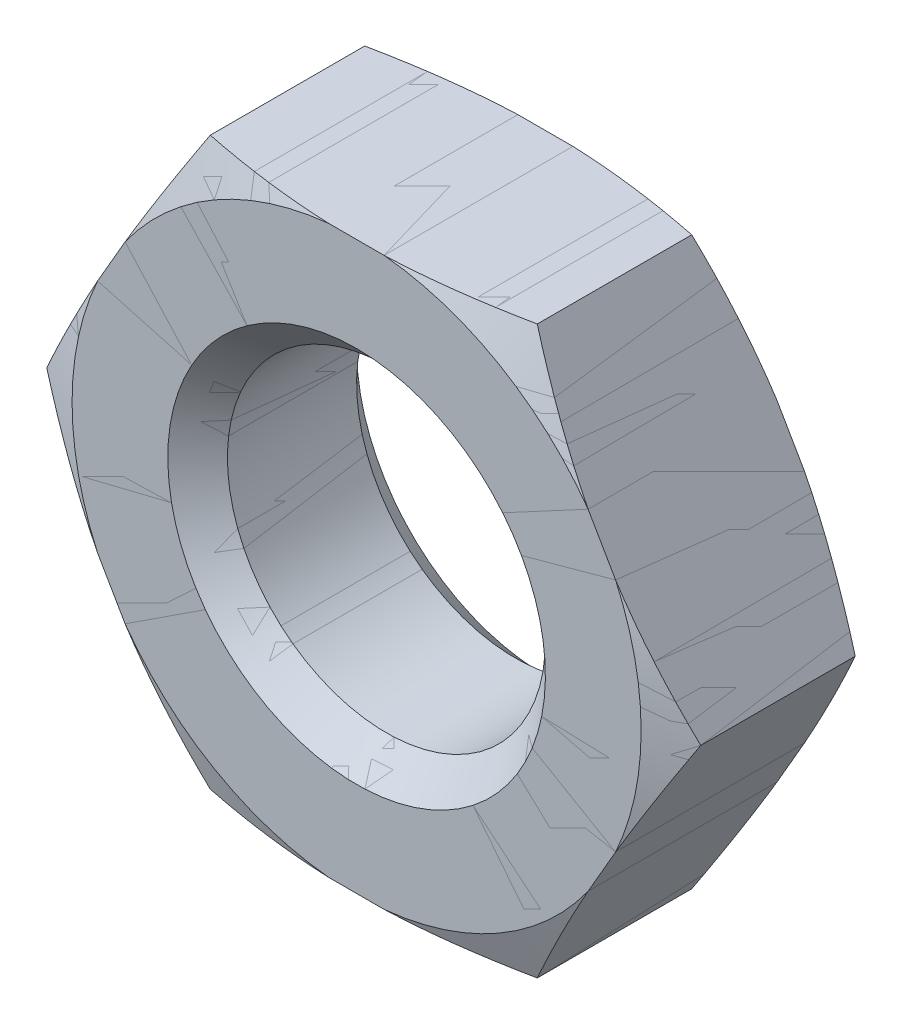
ISO-10303-21;
HEADER;
FILE_DESCRIPTION(('STEP AP214'),'2;1');
FILE_NAME('part.step','',(''),(''),'','','');
FILE_SCHEMA(('AUTOMOTIVE_DESIGN { 1 0 10303 214 1 1 1 1 }'));
ENDSEC;
DATA;
#1=APPLICATION_CONTEXT('core data for automotive mechanical design processes');
#2=APPLICATION_PROTOCOL_DEFINITION('international standard','automotive_design',2000,#1);
#3=PRODUCT_CONTEXT('',#1,'mechanical');
#4=PRODUCT('Part','Part','',(#3));
#5=PRODUCT_RELATED_PRODUCT_CATEGORY('part','',(#4));
#6=PRODUCT_DEFINITION_FORMATION('','',#4);
#7=PRODUCT_DEFINITION_CONTEXT('part definition',#1,'design');
#8=PRODUCT_DEFINITION('design','',#6,#7);
#9=PRODUCT_DEFINITION_SHAPE('','',#8);
#10=(LENGTH_UNIT() NAMED_UNIT(*) SI_UNIT(.MILLI.,.METRE.));
#11=(NAMED_UNIT(*) PLANE_ANGLE_UNIT() SI_UNIT($,.RADIAN.));
#12=(NAMED_UNIT(*) SI_UNIT($,.STERADIAN.) SOLID_ANGLE_UNIT());
#13=UNCERTAINTY_MEASURE_WITH_UNIT(LENGTH_MEASURE(1.E-05),#10,'distance_accuracy_value','');
#14=(GEOMETRIC_REPRESENTATION_CONTEXT(3) GLOBAL_UNCERTAINTY_ASSIGNED_CONTEXT((#13)) GLOBAL_UNIT_ASSIGNED_CONTEXT((#10,
#11,#12)) REPRESENTATION_CONTEXT('',''));
#15=CARTESIAN_POINT('',(0.,0.,0.));
#16=DIRECTION('',(0.,0.,1.));
#17=DIRECTION('',(1.,0.,0.));
#18=AXIS2_PLACEMENT_3D('',#15,#16,#17);
#19=CARTESIAN_POINT('',(0.,0.,0.));
#20=DIRECTION('',(0.,0.,1.));
#21=DIRECTION('',(0.,-1.,0.));
#22=AXIS2_PLACEMENT_3D('',#19,#20,#21);
#23=CONICAL_SURFACE('',#22,9.04225262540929,1.18682389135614);
#24=CARTESIAN_POINT('',(3.29337909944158,12.2956916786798,1.48958926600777));
#25=CARTESIAN_POINT('',(3.47196666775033,11.9863689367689,1.38758639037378));
#26=CARTESIAN_POINT('',(3.65095666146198,11.6763491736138,1.28829651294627));
#27=CARTESIAN_POINT('',(4.00990525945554,11.0546319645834,1.09655155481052));
#28=CARTESIAN_POINT('',(4.18986414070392,10.7429340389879,1.0040985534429));
#29=CARTESIAN_POINT('',(4.55169395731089,10.1162264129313,0.827065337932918));
#30=CARTESIAN_POINT('',(4.73356994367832,9.80120796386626,0.742526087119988));
#31=CARTESIAN_POINT('',(5.09842913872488,9.16925330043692,0.583668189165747));
#32=CARTESIAN_POINT('',(5.28141226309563,8.85231723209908,0.509348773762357));
#33=CARTESIAN_POINT('',(5.64376319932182,8.22470700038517,0.374756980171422));
#34=CARTESIAN_POINT('',(5.82310151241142,7.91408393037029,0.314169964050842));
#35=CARTESIAN_POINT('',(6.18281302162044,7.29104532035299,0.206674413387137));
#36=CARTESIAN_POINT('',(6.36318621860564,6.97862977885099,0.159765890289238));
#37=CARTESIAN_POINT('',(6.72436890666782,6.353043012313,0.0816427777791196));
#38=CARTESIAN_POINT('',(6.90517641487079,6.03987522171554,0.050392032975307));
#39=CARTESIAN_POINT('',(7.26732832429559,5.4126097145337,0.00491574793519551));
#40=CARTESIAN_POINT('',(7.44867270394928,5.09851203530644,-0.00931046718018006));
#41=CARTESIAN_POINT('',(7.80232996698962,4.48595968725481,-0.0197289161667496));
#42=CARTESIAN_POINT('',(7.97463645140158,4.18751610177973,-0.0167956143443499));
#43=CARTESIAN_POINT('',(8.31899750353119,3.59106526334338,0.00493973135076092));
#44=CARTESIAN_POINT('',(8.49105206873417,3.29305801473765,0.023741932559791));
#45=CARTESIAN_POINT('',(8.83493555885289,2.69743433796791,0.0764025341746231));
#46=CARTESIAN_POINT('',(9.00676327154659,2.39982000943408,0.110292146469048));
#47=CARTESIAN_POINT('',(9.34959805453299,1.80601274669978,0.191723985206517));
#48=CARTESIAN_POINT('',(9.52060512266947,1.509819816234,0.239266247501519));
#49=CARTESIAN_POINT('',(9.86590725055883,0.91173898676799,0.347645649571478));
#50=CARTESIAN_POINT('',(10.0401784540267,0.609892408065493,0.408783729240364));
#51=CARTESIAN_POINT('',(10.3877029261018,0.00796236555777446,0.541775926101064));
#52=CARTESIAN_POINT('',(10.5609561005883,-0.292120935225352,0.613631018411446));
#53=CARTESIAN_POINT('',(10.9057592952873,-0.889337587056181,0.765996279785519));
#54=CARTESIAN_POINT('',(11.0773133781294,-1.18647797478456,0.846470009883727));
#55=CARTESIAN_POINT('',(11.4194500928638,-1.7790761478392,1.01482955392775));
#56=CARTESIAN_POINT('',(11.5900330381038,-2.0745344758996,1.10271281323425));
#57=CARTESIAN_POINT('',(11.7601993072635,-2.36927109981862,1.1935887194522));
#58=B_SPLINE_CURVE_WITH_KNOTS('',3,(#24,#25,#26,#27,#28,#29,#30,#31,#32,#33,#34,#35,#36,#37,#38,
#39,#40,#41,#42,#43,#44,#45,#46,#47,#48,#49,#50,#51,#52,#53,#54,#55,#56,#57),.UNSPECIFIED.,.F.,
.F.,(4,2,2,2,2,2,2,2,2,2,2,2,2,2,2,2,4),(0.,1.11439696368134,2.22913147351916,3.3493493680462,
4.46948300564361,5.56053112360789,6.65158015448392,7.74009809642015,8.8285728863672,
9.86207781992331,10.8955930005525,11.9312562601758,12.9669222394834,14.0283169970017,
15.0898083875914,16.1469769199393,17.2037824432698),.UNSPECIFIED.);
#59=CARTESIAN_POINT('',(8.23080491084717,3.74381931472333,0.));
#60=VERTEX_POINT('',#59);
#61=CARTESIAN_POINT('',(10.3923,0.,0.545454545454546));
#62=VERTEX_POINT('',#61);
#63=EDGE_CURVE('P0_E306',#60,#62,#58,.T.);
#64=ORIENTED_EDGE('',*,*,#63,.T.);
#65=CARTESIAN_POINT('',(11.7601993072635,2.36927109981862,1.1935887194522));
#66=CARTESIAN_POINT('',(11.5900330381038,2.0745344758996,1.10271281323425));
#67=CARTESIAN_POINT('',(11.4194500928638,1.7790761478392,1.01482955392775));
#68=CARTESIAN_POINT('',(11.0773133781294,1.18647797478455,0.846470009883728));
#69=CARTESIAN_POINT('',(10.9057592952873,0.889337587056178,0.76599627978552));
#70=CARTESIAN_POINT('',(10.5609561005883,0.29212093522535,0.613631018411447));
#71=CARTESIAN_POINT('',(10.3877029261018,-0.00796236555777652,0.541775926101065));
#72=CARTESIAN_POINT('',(10.0401784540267,-0.609892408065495,0.408783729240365));
#73=CARTESIAN_POINT('',(9.86590725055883,-0.911738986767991,0.347645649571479));
#74=CARTESIAN_POINT('',(9.52060512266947,-1.509819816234,0.239266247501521));
#75=CARTESIAN_POINT('',(9.34959805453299,-1.80601274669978,0.191723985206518));
#76=CARTESIAN_POINT('',(9.00676327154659,-2.39982000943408,0.11029214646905));
#77=CARTESIAN_POINT('',(8.83493555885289,-2.69743433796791,0.0764025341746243));
#78=CARTESIAN_POINT('',(8.49105206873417,-3.29305801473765,0.023741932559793));
#79=CARTESIAN_POINT('',(8.31899750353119,-3.59106526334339,0.00493973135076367));
#80=CARTESIAN_POINT('',(7.97463645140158,-4.18751610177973,-0.0167956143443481));
#81=CARTESIAN_POINT('',(7.80232996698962,-4.48595968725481,-0.0197289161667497));
#82=CARTESIAN_POINT('',(7.44867270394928,-5.09851203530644,-0.00931046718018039));
#83=CARTESIAN_POINT('',(7.26732832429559,-5.4126097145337,0.00491574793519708));
#84=CARTESIAN_POINT('',(6.90517641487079,-6.03987522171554,0.0503920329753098));
#85=CARTESIAN_POINT('',(6.72436890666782,-6.35304301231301,0.0816427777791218));
#86=CARTESIAN_POINT('',(6.36318621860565,-6.97862977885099,0.15976589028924));
#87=CARTESIAN_POINT('',(6.18281302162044,-7.291045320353,0.206674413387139));
#88=CARTESIAN_POINT('',(5.82310151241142,-7.9140839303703,0.314169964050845));
#89=CARTESIAN_POINT('',(5.64376319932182,-8.22470700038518,0.374756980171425));
#90=CARTESIAN_POINT('',(5.28141226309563,-8.85231723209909,0.50934877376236));
#91=CARTESIAN_POINT('',(5.09842913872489,-9.16925330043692,0.58366818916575));
#92=CARTESIAN_POINT('',(4.73356994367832,-9.80120796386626,0.742526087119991));
#93=CARTESIAN_POINT('',(4.55169395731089,-10.1162264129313,0.82706533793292));
#94=CARTESIAN_POINT('',(4.18986414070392,-10.742934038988,1.00409855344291));
#95=CARTESIAN_POINT('',(4.00990525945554,-11.0546319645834,1.09655155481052));
#96=CARTESIAN_POINT('',(3.65095666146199,-11.6763491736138,1.28829651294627));
#97=CARTESIAN_POINT('',(3.47196666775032,-11.9863689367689,1.38758639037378));
#98=CARTESIAN_POINT('',(3.29337909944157,-12.2956916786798,1.48958926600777));
#99=B_SPLINE_CURVE_WITH_KNOTS('',3,(#65,#66,#67,#68,#69,#70,#71,#72,#73,#74,#75,#76,#77,#78,#79,
#80,#81,#82,#83,#84,#85,#86,#87,#88,#89,#90,#91,#92,#93,#94,#95,#96,#97,#98),.UNSPECIFIED.,.F.,
.F.,(4,2,2,2,2,2,2,2,2,2,2,2,2,2,2,2,4),(0.,1.05680552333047,2.11397405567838,3.17546544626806,
4.23686020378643,5.27252618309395,6.30818944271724,7.34170462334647,8.37520955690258,
9.46368434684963,10.5522022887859,11.6432513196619,12.7342994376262,13.8544330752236,
14.9746509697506,16.0893854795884,17.2037824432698),.UNSPECIFIED.);
#100=CARTESIAN_POINT('',(8.23080491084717,-3.74381931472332,0.));
#101=VERTEX_POINT('',#100);
#102=EDGE_CURVE('P0_E45',#62,#101,#99,.T.);
#103=ORIENTED_EDGE('',*,*,#102,.T.);
#104=CARTESIAN_POINT('',(0.,0.,0.));
#105=DIRECTION('',(0.,0.,1.));
#106=DIRECTION('',(1.,0.,0.));
#107=AXIS2_PLACEMENT_3D('',#104,#105,#106);
#108=CIRCLE('',#107,9.04225262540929);
#109=EDGE_CURVE('P0_E311',#101,#60,#108,.T.);
#110=ORIENTED_EDGE('',*,*,#109,.T.);
#111=EDGE_LOOP('',(#64,#103,#110));
#112=FACE_BOUND('',#111,.T.);
#113=ADVANCED_FACE('P0_F28',(#112),#23,.T.);
#114=CARTESIAN_POINT('',(10.3923,0.,0.));
#115=DIRECTION('',(0.,0.,1.));
#116=DIRECTION('',(1.,0.,0.));
#117=AXIS2_PLACEMENT_3D('',#114,#115,#116);
#118=PLANE('',#117);
#119=CARTESIAN_POINT('',(0.,0.,0.));
#120=DIRECTION('',(0.,0.,-1.));
#121=DIRECTION('',(0.,1.,0.));
#122=AXIS2_PLACEMENT_3D('',#119,#120,#121);
#123=CIRCLE('',#122,9.04225262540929);
#124=CARTESIAN_POINT('',(0.873159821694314,8.99999580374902,0.));
#125=VERTEX_POINT('',#124);
#126=CARTESIAN_POINT('',(7.35764508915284,5.25617648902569,0.));
#127=VERTEX_POINT('',#126);
#128=EDGE_CURVE('P0_E163',#125,#127,#123,.T.);
#129=ORIENTED_EDGE('',*,*,#128,.T.);
#130=DIRECTION('',(-0.5,0.866025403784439,0.));
#131=VECTOR('',#130,1.);
#132=CARTESIAN_POINT('',(10.3923,0.,0.));
#133=LINE('',#132,#131);
#134=EDGE_CURVE('P0_E169',#60,#127,#133,.T.);
#135=ORIENTED_EDGE('',*,*,#134,.F.);
#136=ORIENTED_EDGE('',*,*,#109,.F.);
#137=DIRECTION('',(0.5,0.866025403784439,0.));
#138=VECTOR('',#137,1.);
#139=CARTESIAN_POINT('',(5.19615,-8.99999580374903,0.));
#140=LINE('',#139,#138);
#141=CARTESIAN_POINT('',(7.35764508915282,-5.2561764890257,0.));
#142=VERTEX_POINT('',#141);
#143=EDGE_CURVE('P0_E352',#142,#101,#140,.T.);
#144=ORIENTED_EDGE('',*,*,#143,.F.);
#145=CARTESIAN_POINT('',(0.873159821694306,-8.99999580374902,0.));
#146=VERTEX_POINT('',#145);
#147=EDGE_CURVE('P0_E318',#146,#142,#108,.T.);
#148=ORIENTED_EDGE('',*,*,#147,.F.);
#149=DIRECTION('',(1.,0.,0.));
#150=VECTOR('',#149,1.);
#151=CARTESIAN_POINT('',(-5.19615,-8.99999580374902,0.));
#152=LINE('',#151,#150);
#153=CARTESIAN_POINT('',(-0.873159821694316,-8.99999580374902,0.));
#154=VERTEX_POINT('',#153);
#155=EDGE_CURVE('P0_E338',#154,#146,#152,.T.);
#156=ORIENTED_EDGE('',*,*,#155,.F.);
#157=CARTESIAN_POINT('',(-7.35764508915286,-5.25617648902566,0.));
#158=VERTEX_POINT('',#157);
#159=EDGE_CURVE('P0_E391',#158,#154,#108,.T.);
#160=ORIENTED_EDGE('',*,*,#159,.F.);
#161=DIRECTION('',(0.5,-0.866025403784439,0.));
#162=VECTOR('',#161,1.);
#163=CARTESIAN_POINT('',(-10.3923,0.,0.));
#164=LINE('',#163,#162);
#165=CARTESIAN_POINT('',(-8.23080491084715,-3.74381931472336,0.));
#166=VERTEX_POINT('',#165);
#167=EDGE_CURVE('P0_E357',#166,#158,#164,.T.);
#168=ORIENTED_EDGE('',*,*,#167,.F.);
#169=CARTESIAN_POINT('',(-8.23080491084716,3.74381931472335,0.));
#170=VERTEX_POINT('',#169);
#171=EDGE_CURVE('P0_E369',#170,#166,#108,.T.);
#172=ORIENTED_EDGE('',*,*,#171,.F.);
#173=DIRECTION('',(-0.5,-0.866025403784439,0.));
#174=VECTOR('',#173,1.);
#175=CARTESIAN_POINT('',(-5.19615,8.99999580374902,0.));
#176=LINE('',#175,#174);
#177=CARTESIAN_POINT('',(-7.35764508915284,5.25617648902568,0.));
#178=VERTEX_POINT('',#177);
#179=EDGE_CURVE('P0_E168',#178,#170,#176,.T.);
#180=ORIENTED_EDGE('',*,*,#179,.F.);
#181=CARTESIAN_POINT('',(-0.873159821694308,8.99999580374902,0.));
#182=VERTEX_POINT('',#181);
#183=EDGE_CURVE('P0_E165',#182,#178,#108,.T.);
#184=ORIENTED_EDGE('',*,*,#183,.F.);
#185=DIRECTION('',(-1.,0.,0.));
#186=VECTOR('',#185,1.);
#187=CARTESIAN_POINT('',(5.19615,8.99999580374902,0.));
#188=LINE('',#187,#186);
#189=EDGE_CURVE('P0_E158',#125,#182,#188,.T.);
#190=ORIENTED_EDGE('',*,*,#189,.F.);
#191=EDGE_LOOP('',(#129,#135,#136,#144,#148,#156,#160,#168,#172,#180,#184,#190));
#192=FACE_BOUND('',#191,.T.);
#193=CARTESIAN_POINT('',(0.,0.,0.));
#194=DIRECTION('',(0.,0.,-1.));
#195=DIRECTION('',(0.,1.,0.));
#196=AXIS2_PLACEMENT_3D('',#193,#194,#195);
#197=CIRCLE('',#196,6.);
#198=CARTESIAN_POINT('',(0.,6.,0.));
#199=VERTEX_POINT('',#198);
#200=EDGE_CURVE('P0_E181',#199,#199,#197,.T.);
#201=ORIENTED_EDGE('',*,*,#200,.F.);
#202=EDGE_LOOP('',(#201));
#203=FACE_BOUND('',#202,.T.);
#204=ADVANCED_FACE('P0_F160',(#192,#203),#118,.F.);
#205=CARTESIAN_POINT('',(5.19615,-8.99999580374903,6.));
#206=DIRECTION('',(-0.866025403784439,0.5,0.));
#207=DIRECTION('',(-0.5,-0.866025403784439,0.));
#208=AXIS2_PLACEMENT_3D('',#205,#206,#207);
#209=PLANE('',#208);
#210=CARTESIAN_POINT('',(3.29337909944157,-12.2956916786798,4.51041073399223));
#211=CARTESIAN_POINT('',(3.47196666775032,-11.9863689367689,4.61241360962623));
#212=CARTESIAN_POINT('',(3.65095666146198,-11.6763491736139,4.71170348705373));
#213=CARTESIAN_POINT('',(4.00990525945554,-11.0546319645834,4.90344844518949));
#214=CARTESIAN_POINT('',(4.18986414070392,-10.742934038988,4.9959014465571));
#215=CARTESIAN_POINT('',(4.55169395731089,-10.1162264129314,5.17293466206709));
#216=CARTESIAN_POINT('',(4.73356994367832,-9.80120796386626,5.25747391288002));
#217=CARTESIAN_POINT('',(5.09842913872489,-9.16925330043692,5.41633181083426));
#218=CARTESIAN_POINT('',(5.28141226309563,-8.85231723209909,5.49065122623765));
#219=CARTESIAN_POINT('',(5.64376319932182,-8.22470700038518,5.62524301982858));
#220=CARTESIAN_POINT('',(5.82310151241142,-7.91408393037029,5.68583003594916));
#221=CARTESIAN_POINT('',(6.18281302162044,-7.291045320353,5.79332558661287));
#222=CARTESIAN_POINT('',(6.36318621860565,-6.97862977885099,5.84023410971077));
#223=CARTESIAN_POINT('',(6.72436890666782,-6.35304301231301,5.91835722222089));
#224=CARTESIAN_POINT('',(6.90517641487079,-6.03987522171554,5.9496079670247));
#225=CARTESIAN_POINT('',(7.26732832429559,-5.4126097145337,5.99508425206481));
#226=CARTESIAN_POINT('',(7.44867270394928,-5.09851203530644,6.00931046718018));
#227=CARTESIAN_POINT('',(7.80232996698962,-4.48595968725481,6.01972891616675));
#228=CARTESIAN_POINT('',(7.97463645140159,-4.18751610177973,6.01679561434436));
#229=CARTESIAN_POINT('',(8.31899750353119,-3.59106526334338,5.99506026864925));
#230=CARTESIAN_POINT('',(8.49105206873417,-3.29305801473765,5.97625806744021));
#231=CARTESIAN_POINT('',(8.83493555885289,-2.6974343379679,5.92359746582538));
#232=CARTESIAN_POINT('',(9.00676327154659,-2.39982000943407,5.88970785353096));
#233=CARTESIAN_POINT('',(9.34959805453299,-1.80601274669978,5.80827601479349));
#234=CARTESIAN_POINT('',(9.52060512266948,-1.50981981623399,5.76073375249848));
#235=CARTESIAN_POINT('',(9.86590725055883,-0.911738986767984,5.65235435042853));
#236=CARTESIAN_POINT('',(10.0401784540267,-0.609892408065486,5.59121627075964));
#237=CARTESIAN_POINT('',(10.3877029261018,-0.00796236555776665,5.45822407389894));
#238=CARTESIAN_POINT('',(10.5609561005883,0.29212093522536,5.38636898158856));
#239=CARTESIAN_POINT('',(10.9057592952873,0.88933758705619,5.23400372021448));
#240=CARTESIAN_POINT('',(11.0773133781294,1.18647797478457,5.15352999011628));
#241=CARTESIAN_POINT('',(11.4194500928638,1.77907614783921,4.98517044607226));
#242=CARTESIAN_POINT('',(11.5900330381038,2.07453447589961,4.89728718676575));
#243=CARTESIAN_POINT('',(11.7601993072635,2.36927109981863,4.8064112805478));
#244=B_SPLINE_CURVE_WITH_KNOTS('',3,(#210,#211,#212,#213,#214,#215,#216,#217,#218,#219,#220,
#221,#222,#223,#224,#225,#226,#227,#228,#229,#230,#231,#232,#233,#234,#235,#236,#237,#238,#239,
#240,#241,#242,#243),.UNSPECIFIED.,.F.,.F.,(4,2,2,2,2,2,2,2,2,2,2,2,2,2,2,2,4),(0.,
1.11439696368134,2.22913147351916,3.3493493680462,4.46948300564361,5.5605311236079,
6.65158015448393,7.74009809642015,8.8285728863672,9.86207781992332,10.8955930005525,
11.9312562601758,12.9669222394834,14.0283169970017,15.0898083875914,16.1469769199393,
17.2037824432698),.UNSPECIFIED.);
#245=CARTESIAN_POINT('',(5.19615,-8.99999580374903,5.45454545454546));
#246=VERTEX_POINT('',#245);
#247=CARTESIAN_POINT('',(7.35764508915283,-5.25617648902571,6.));
#248=VERTEX_POINT('',#247);
#249=EDGE_CURVE('P0_E231',#246,#248,#244,.T.);
#250=ORIENTED_EDGE('',*,*,#249,.F.);
#251=DIRECTION('',(0.,0.,-1.));
#252=VECTOR('',#251,1.);
#253=CARTESIAN_POINT('',(5.19615,-8.99999580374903,6.));
#254=LINE('',#253,#252);
#255=CARTESIAN_POINT('',(5.19615,-8.99999580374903,0.545454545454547));
#256=VERTEX_POINT('',#255);
#257=EDGE_CURVE('P0_E330',#246,#256,#254,.T.);
#258=ORIENTED_EDGE('',*,*,#257,.T.);
#259=EDGE_CURVE('P0_E296',#142,#256,#99,.T.);
#260=ORIENTED_EDGE('',*,*,#259,.F.);
#261=ORIENTED_EDGE('',*,*,#143,.T.);
#262=ORIENTED_EDGE('',*,*,#102,.F.);
#263=DIRECTION('',(0.,0.,-1.));
#264=VECTOR('',#263,1.);
#265=CARTESIAN_POINT('',(10.3923,0.,6.));
#266=LINE('',#265,#264);
#267=CARTESIAN_POINT('',(10.3923,0.,5.45454545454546));
#268=VERTEX_POINT('',#267);
#269=EDGE_CURVE('P0_E313',#268,#62,#266,.T.);
#270=ORIENTED_EDGE('',*,*,#269,.F.);
#271=CARTESIAN_POINT('',(8.23080491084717,-3.74381931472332,6.));
#272=VERTEX_POINT('',#271);
#273=EDGE_CURVE('P0_E354',#272,#268,#244,.T.);
#274=ORIENTED_EDGE('',*,*,#273,.F.);
#275=DIRECTION('',(0.5,0.866025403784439,0.));
#276=VECTOR('',#275,1.);
#277=CARTESIAN_POINT('',(5.19615,-8.99999580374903,6.));
#278=LINE('',#277,#276);
#279=EDGE_CURVE('P0_E334',#248,#272,#278,.T.);
#280=ORIENTED_EDGE('',*,*,#279,.F.);
#281=EDGE_LOOP('',(#250,#258,#260,#261,#262,#270,#274,#280));
#282=FACE_BOUND('',#281,.T.);
#283=ADVANCED_FACE('P0_F30',(#282),#209,.F.);
#284=CARTESIAN_POINT('',(10.3923,0.,6.));
#285=DIRECTION('',(-0.866025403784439,-0.5,0.));
#286=DIRECTION('',(0.5,-0.866025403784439,0.));
#287=AXIS2_PLACEMENT_3D('',#284,#285,#286);
#288=PLANE('',#287);
#289=CARTESIAN_POINT('',(11.7601993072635,-2.36927109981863,4.8064112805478));
#290=CARTESIAN_POINT('',(11.5900330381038,-2.07453447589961,4.89728718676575));
#291=CARTESIAN_POINT('',(11.4194500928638,-1.77907614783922,4.98517044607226));
#292=CARTESIAN_POINT('',(11.0773133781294,-1.18647797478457,5.15352999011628));
#293=CARTESIAN_POINT('',(10.9057592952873,-0.889337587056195,5.23400372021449));
#294=CARTESIAN_POINT('',(10.5609561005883,-0.292120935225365,5.38636898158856));
#295=CARTESIAN_POINT('',(10.3877029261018,0.00796236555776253,5.45822407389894));
#296=CARTESIAN_POINT('',(10.0401784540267,0.609892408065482,5.59121627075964));
#297=CARTESIAN_POINT('',(9.86590725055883,0.911738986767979,5.65235435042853));
#298=CARTESIAN_POINT('',(9.52060512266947,1.50981981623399,5.76073375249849));
#299=CARTESIAN_POINT('',(9.34959805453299,1.80601274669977,5.80827601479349));
#300=CARTESIAN_POINT('',(9.00676327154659,2.39982000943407,5.88970785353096));
#301=CARTESIAN_POINT('',(8.83493555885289,2.6974343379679,5.92359746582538));
#302=CARTESIAN_POINT('',(8.49105206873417,3.29305801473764,5.97625806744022));
#303=CARTESIAN_POINT('',(8.31899750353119,3.59106526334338,5.99506026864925));
#304=CARTESIAN_POINT('',(7.97463645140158,4.18751610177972,6.01679561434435));
#305=CARTESIAN_POINT('',(7.80232996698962,4.48595968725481,6.01972891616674));
#306=CARTESIAN_POINT('',(7.44867270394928,5.09851203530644,6.00931046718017));
#307=CARTESIAN_POINT('',(7.26732832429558,5.4126097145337,5.99508425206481));
#308=CARTESIAN_POINT('',(6.90517641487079,6.03987522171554,5.9496079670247));
#309=CARTESIAN_POINT('',(6.72436890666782,6.35304301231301,5.91835722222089));
#310=CARTESIAN_POINT('',(6.36318621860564,6.97862977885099,5.84023410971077));
#311=CARTESIAN_POINT('',(6.18281302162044,7.291045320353,5.79332558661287));
#312=CARTESIAN_POINT('',(5.82310151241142,7.91408393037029,5.68583003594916));
#313=CARTESIAN_POINT('',(5.64376319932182,8.22470700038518,5.62524301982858));
#314=CARTESIAN_POINT('',(5.28141226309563,8.85231723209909,5.49065122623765));
#315=CARTESIAN_POINT('',(5.09842913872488,9.16925330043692,5.41633181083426));
#316=CARTESIAN_POINT('',(4.73356994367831,9.80120796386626,5.25747391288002));
#317=CARTESIAN_POINT('',(4.55169395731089,10.1162264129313,5.17293466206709));
#318=CARTESIAN_POINT('',(4.18986414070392,10.742934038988,4.9959014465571));
#319=CARTESIAN_POINT('',(4.00990525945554,11.0546319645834,4.90344844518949));
#320=CARTESIAN_POINT('',(3.65095666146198,11.6763491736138,4.71170348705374));
#321=CARTESIAN_POINT('',(3.47196666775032,11.9863689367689,4.61241360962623));
#322=CARTESIAN_POINT('',(3.29337909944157,12.2956916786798,4.51041073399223));
#323=B_SPLINE_CURVE_WITH_KNOTS('',3,(#289,#290,#291,#292,#293,#294,#295,#296,#297,#298,#299,
#300,#301,#302,#303,#304,#305,#306,#307,#308,#309,#310,#311,#312,#313,#314,#315,#316,#317,#318,
#319,#320,#321,#322),.UNSPECIFIED.,.F.,.F.,(4,2,2,2,2,2,2,2,2,2,2,2,2,2,2,2,4),(0.,
1.05680552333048,2.11397405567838,3.17546544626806,4.23686020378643,5.27252618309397,
6.30818944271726,7.34170462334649,8.3752095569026,9.46368434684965,10.5522022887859,
11.6432513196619,12.7342994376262,13.8544330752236,14.9746509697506,16.0893854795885,
17.2037824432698),.UNSPECIFIED.);
#324=CARTESIAN_POINT('',(8.23080491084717,3.74381931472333,6.));
#325=VERTEX_POINT('',#324);
#326=EDGE_CURVE('P0_E315',#268,#325,#323,.T.);
#327=ORIENTED_EDGE('',*,*,#326,.F.);
#328=ORIENTED_EDGE('',*,*,#269,.T.);
#329=ORIENTED_EDGE('',*,*,#63,.F.);
#330=ORIENTED_EDGE('',*,*,#134,.T.);
#331=CARTESIAN_POINT('',(5.19615,8.99999580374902,0.545454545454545));
#332=VERTEX_POINT('',#331);
#333=EDGE_CURVE('P0_E53',#332,#127,#58,.T.);
#334=ORIENTED_EDGE('',*,*,#333,.F.);
#335=DIRECTION('',(0.,0.,-1.));
#336=VECTOR('',#335,1.);
#337=CARTESIAN_POINT('',(5.19615,8.99999580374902,6.));
#338=LINE('',#337,#336);
#339=CARTESIAN_POINT('',(5.19615,8.99999580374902,5.45454545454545));
#340=VERTEX_POINT('',#339);
#341=EDGE_CURVE('P0_E175',#340,#332,#338,.T.);
#342=ORIENTED_EDGE('',*,*,#341,.F.);
#343=CARTESIAN_POINT('',(7.35764508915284,5.25617648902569,6.));
#344=VERTEX_POINT('',#343);
#345=EDGE_CURVE('P0_E273',#344,#340,#323,.T.);
#346=ORIENTED_EDGE('',*,*,#345,.F.);
#347=DIRECTION('',(-0.5,0.866025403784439,0.));
#348=VECTOR('',#347,1.);
#349=CARTESIAN_POINT('',(10.3923,0.,6.));
#350=LINE('',#349,#348);
#351=EDGE_CURVE('P0_E337',#325,#344,#350,.T.);
#352=ORIENTED_EDGE('',*,*,#351,.F.);
#353=EDGE_LOOP('',(#327,#328,#329,#330,#334,#342,#346,#352));
#354=FACE_BOUND('',#353,.T.);
#355=ADVANCED_FACE('P0_F281',(#354),#288,.F.);
#356=CARTESIAN_POINT('',(5.19615,8.99999580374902,6.));
#357=DIRECTION('',(0.,-1.,0.));
#358=DIRECTION('',(1.,0.,0.));
#359=AXIS2_PLACEMENT_3D('',#356,#357,#358);
#360=PLANE('',#359);
#361=CARTESIAN_POINT('',(-13.7668000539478,8.99999580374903,3.00803117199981));
#362=CARTESIAN_POINT('',(-13.3605227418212,8.99999580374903,3.14538424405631));
#363=CARTESIAN_POINT('',(-12.9537068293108,8.99999580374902,3.28117343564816));
#364=CARTESIAN_POINT('',(-12.138719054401,8.99999580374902,3.54875043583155));
#365=CARTESIAN_POINT('',(-11.7305470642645,8.99999580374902,3.6805378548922));
#366=CARTESIAN_POINT('',(-10.9116684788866,8.99999580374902,3.93952020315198));
#367=CARTESIAN_POINT('',(-10.5009581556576,8.99999580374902,4.06670338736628));
#368=CARTESIAN_POINT('',(-9.67768803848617,8.99999580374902,4.31492338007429));
#369=CARTESIAN_POINT('',(-9.26512828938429,8.99999580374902,4.43596033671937));
#370=CARTESIAN_POINT('',(-8.44310919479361,8.99999580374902,4.66884098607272));
#371=CARTESIAN_POINT('',(-8.03367769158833,8.99999580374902,4.78078246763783));
#372=CARTESIAN_POINT('',(-7.21232873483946,8.99999580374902,4.99526167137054));
#373=CARTESIAN_POINT('',(-6.80041120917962,8.99999580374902,5.0977991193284));
#374=CARTESIAN_POINT('',(-5.97402410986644,8.99999580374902,5.29103208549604));
#375=CARTESIAN_POINT('',(-5.5595560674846,8.99999580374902,5.38173409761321));
#376=CARTESIAN_POINT('',(-4.72767241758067,8.99999580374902,5.54850195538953));
#377=CARTESIAN_POINT('',(-4.31025702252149,8.99999580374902,5.62456884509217));
#378=CARTESIAN_POINT('',(-3.55816105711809,8.99999580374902,5.74516145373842));
#379=CARTESIAN_POINT('',(-3.22400733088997,8.99999580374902,5.79295615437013));
#380=CARTESIAN_POINT('',(-2.55409875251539,8.99999580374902,5.87567941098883));
#381=CARTESIAN_POINT('',(-2.21834394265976,8.99999580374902,5.91060830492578));
#382=CARTESIAN_POINT('',(-1.54586285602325,8.99999580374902,5.96621810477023));
#383=CARTESIAN_POINT('',(-1.20913736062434,8.99999580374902,5.98690833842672));
#384=CARTESIAN_POINT('',(-0.535091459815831,8.99999580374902,6.01317318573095));
#385=CARTESIAN_POINT('',(-0.197771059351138,8.99999580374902,6.01874792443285));
#386=CARTESIAN_POINT('',(0.478397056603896,8.99999580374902,6.01451406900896));
#387=CARTESIAN_POINT('',(0.817244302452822,8.99999580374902,6.00463124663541));
#388=CARTESIAN_POINT('',(1.4941576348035,8.99999580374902,5.9698001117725));
#389=CARTESIAN_POINT('',(1.83222370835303,8.99999580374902,5.9448515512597));
#390=CARTESIAN_POINT('',(2.50722993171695,8.99999580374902,5.88094090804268));
#391=CARTESIAN_POINT('',(2.84416922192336,8.99999580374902,5.84196986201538));
#392=CARTESIAN_POINT('',(3.51633839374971,8.99999580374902,5.75149124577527));
#393=CARTESIAN_POINT('',(3.85156828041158,8.99999580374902,5.69998371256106));
#394=CARTESIAN_POINT('',(4.57663026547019,8.99999580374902,5.57644721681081));
#395=CARTESIAN_POINT('',(4.96611991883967,8.99999580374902,5.50242146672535));
#396=CARTESIAN_POINT('',(5.74257029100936,8.99999580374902,5.34203031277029));
#397=CARTESIAN_POINT('',(6.12953068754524,8.99999580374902,5.25566336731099));
#398=CARTESIAN_POINT('',(6.90124523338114,8.99999580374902,5.0728299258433));
#399=CARTESIAN_POINT('',(7.28599818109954,8.99999580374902,4.97635839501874));
#400=CARTESIAN_POINT('',(8.05334112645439,8.99999580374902,4.77527042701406));
#401=CARTESIAN_POINT('',(8.43593120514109,8.99999580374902,4.67065429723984));
#402=CARTESIAN_POINT('',(9.20025348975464,8.99999580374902,4.4545416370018));
#403=CARTESIAN_POINT('',(9.58198071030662,8.99999580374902,4.34302755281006));
#404=CARTESIAN_POINT('',(10.3438193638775,8.99999580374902,4.11461969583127));
#405=CARTESIAN_POINT('',(10.7239307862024,8.99999580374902,3.99772588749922));
#406=CARTESIAN_POINT('',(11.4826662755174,8.99999580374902,3.75958382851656));
#407=CARTESIAN_POINT('',(11.8612907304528,8.99999580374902,3.63833681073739));
#408=CARTESIAN_POINT('',(12.6173660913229,8.99999580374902,3.39223250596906));
#409=CARTESIAN_POINT('',(12.9948169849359,8.99999580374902,3.26737518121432));
#410=CARTESIAN_POINT('',(14.1207596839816,8.99999580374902,2.88999972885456));
#411=CARTESIAN_POINT('',(14.8677848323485,8.99999580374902,2.63310714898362));
#412=CARTESIAN_POINT('',(16.3590071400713,8.99999580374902,2.11110936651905));
#413=CARTESIAN_POINT('',(17.1032040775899,8.99999580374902,1.84600353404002));
#414=CARTESIAN_POINT('',(18.5844808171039,8.99999580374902,1.3116338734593));
#415=CARTESIAN_POINT('',(19.3215749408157,8.99999580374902,1.04240968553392));
#416=CARTESIAN_POINT('',(20.4259560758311,8.99999580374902,0.635309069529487));
#417=CARTESIAN_POINT('',(20.793849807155,8.99999580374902,0.499073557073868));
#418=CARTESIAN_POINT('',(21.5292786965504,8.99999580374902,0.225642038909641));
#419=CARTESIAN_POINT('',(21.8968138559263,8.99999580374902,0.0884460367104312));
#420=CARTESIAN_POINT('',(22.2641939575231,8.99999580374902,-0.0491641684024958));
#421=B_SPLINE_CURVE_WITH_KNOTS('',3,(#361,#362,#363,#364,#365,#366,#367,#368,#369,#370,#371,
#372,#373,#374,#375,#376,#377,#378,#379,#380,#381,#382,#383,#384,#385,#386,#387,#388,#389,#390,
#391,#392,#393,#394,#395,#396,#397,#398,#399,#400,#401,#402,#403,#404,#405,#406,#407,#408,#409,
#410,#411,#412,#413,#414,#415,#416,#417,#418,#419,#420),.UNSPECIFIED.,.F.,.F.,(4,2,2,2,2,2,2,2,
2,2,2,2,2,2,2,2,2,2,2,2,2,2,2,2,2,2,2,2,2,4),(0.,1.28661260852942,2.57335005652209,
3.86316678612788,5.15295241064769,6.42624025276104,7.69956521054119,8.97218855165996,
10.2447210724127,11.257169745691,12.2695918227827,13.281350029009,14.2930998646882,
15.3097231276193,16.3263631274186,17.3436541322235,18.3609421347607,19.5500775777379,
20.7393616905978,21.9292412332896,23.1190758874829,24.3120740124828,25.5050800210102,
26.6977507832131,27.8904340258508,30.2602416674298,32.6302315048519,34.9843790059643,
36.1613033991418,37.338223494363),.UNSPECIFIED.);
#422=CARTESIAN_POINT('',(0.873159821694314,8.99999580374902,6.));
#423=VERTEX_POINT('',#422);
#424=EDGE_CURVE('P0_E271',#340,#423,#421,.F.);
#425=ORIENTED_EDGE('',*,*,#424,.F.);
#426=ORIENTED_EDGE('',*,*,#341,.T.);
#427=CARTESIAN_POINT('',(-13.7668000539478,8.99999580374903,2.9919688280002));
#428=CARTESIAN_POINT('',(-13.3605227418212,8.99999580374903,2.8546157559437));
#429=CARTESIAN_POINT('',(-12.9537068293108,8.99999580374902,2.71882656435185));
#430=CARTESIAN_POINT('',(-12.138719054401,8.99999580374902,2.45124956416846));
#431=CARTESIAN_POINT('',(-11.7305470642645,8.99999580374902,2.31946214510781));
#432=CARTESIAN_POINT('',(-10.9116684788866,8.99999580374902,2.06047979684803));
#433=CARTESIAN_POINT('',(-10.5009581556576,8.99999580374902,1.93329661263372));
#434=CARTESIAN_POINT('',(-9.67768803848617,8.99999580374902,1.68507661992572));
#435=CARTESIAN_POINT('',(-9.26512828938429,8.99999580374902,1.56403966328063));
#436=CARTESIAN_POINT('',(-8.44310919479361,8.99999580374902,1.33115901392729));
#437=CARTESIAN_POINT('',(-8.03367769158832,8.99999580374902,1.21921753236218));
#438=CARTESIAN_POINT('',(-7.21232873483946,8.99999580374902,1.00473832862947));
#439=CARTESIAN_POINT('',(-6.80041120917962,8.99999580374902,0.902200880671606));
#440=CARTESIAN_POINT('',(-5.97402410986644,8.99999580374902,0.708967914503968));
#441=CARTESIAN_POINT('',(-5.5595560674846,8.99999580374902,0.618265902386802));
#442=CARTESIAN_POINT('',(-4.72767241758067,8.99999580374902,0.451498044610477));
#443=CARTESIAN_POINT('',(-4.31025702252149,8.99999580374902,0.375431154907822));
#444=CARTESIAN_POINT('',(-3.5581610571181,8.99999580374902,0.254838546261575));
#445=CARTESIAN_POINT('',(-3.22400733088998,8.99999580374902,0.207043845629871));
#446=CARTESIAN_POINT('',(-2.55409875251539,8.99999580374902,0.124320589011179));
#447=CARTESIAN_POINT('',(-2.21834394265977,8.99999580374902,0.0893916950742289));
#448=CARTESIAN_POINT('',(-1.54586285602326,8.99999580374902,0.033781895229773));
#449=CARTESIAN_POINT('',(-1.20913736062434,8.99999580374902,0.0130916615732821));
#450=CARTESIAN_POINT('',(-0.53509145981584,8.99999580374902,-0.0131731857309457));
#451=CARTESIAN_POINT('',(-0.197771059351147,8.99999580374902,-0.0187479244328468));
#452=CARTESIAN_POINT('',(0.478397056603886,8.99999580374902,-0.0145140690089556));
#453=CARTESIAN_POINT('',(0.817244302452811,8.99999580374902,-0.00463124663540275));
#454=CARTESIAN_POINT('',(1.49415763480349,8.99999580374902,0.0301998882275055));
#455=CARTESIAN_POINT('',(1.83222370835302,8.99999580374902,0.0551484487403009));
#456=CARTESIAN_POINT('',(2.50722993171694,8.99999580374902,0.119059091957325));
#457=CARTESIAN_POINT('',(2.84416922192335,8.99999580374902,0.158030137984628));
#458=CARTESIAN_POINT('',(3.5163383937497,8.99999580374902,0.248508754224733));
#459=CARTESIAN_POINT('',(3.85156828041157,8.99999580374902,0.300016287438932));
#460=CARTESIAN_POINT('',(4.57663026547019,8.99999580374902,0.423552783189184));
#461=CARTESIAN_POINT('',(4.96611991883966,8.99999580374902,0.497578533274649));
#462=CARTESIAN_POINT('',(5.74257029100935,8.99999580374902,0.657969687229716));
#463=CARTESIAN_POINT('',(6.12953068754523,8.99999580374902,0.744336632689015));
#464=CARTESIAN_POINT('',(6.90124523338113,8.99999580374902,0.927170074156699));
#465=CARTESIAN_POINT('',(7.28599818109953,8.99999580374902,1.02364160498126));
#466=CARTESIAN_POINT('',(8.05334112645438,8.99999580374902,1.22472957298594));
#467=CARTESIAN_POINT('',(8.43593120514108,8.99999580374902,1.32934570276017));
#468=CARTESIAN_POINT('',(9.20025348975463,8.99999580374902,1.54545836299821));
#469=CARTESIAN_POINT('',(9.58198071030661,8.99999580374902,1.65697244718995));
#470=CARTESIAN_POINT('',(10.3438193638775,8.99999580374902,1.88538030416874));
#471=CARTESIAN_POINT('',(10.7239307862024,8.99999580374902,2.00227411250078));
#472=CARTESIAN_POINT('',(11.4826662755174,8.99999580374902,2.24041617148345));
#473=CARTESIAN_POINT('',(11.8612907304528,8.99999580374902,2.36166318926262));
#474=CARTESIAN_POINT('',(12.6173660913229,8.99999580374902,2.60776749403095));
#475=CARTESIAN_POINT('',(12.9948169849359,8.99999580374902,2.73262481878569));
#476=CARTESIAN_POINT('',(14.1207596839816,8.99999580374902,3.11000027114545));
#477=CARTESIAN_POINT('',(14.8677848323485,8.99999580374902,3.36689285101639));
#478=CARTESIAN_POINT('',(16.3590071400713,8.99999580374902,3.88889063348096));
#479=CARTESIAN_POINT('',(17.1032040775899,8.99999580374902,4.15399646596));
#480=CARTESIAN_POINT('',(18.5844808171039,8.99999580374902,4.68836612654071));
#481=CARTESIAN_POINT('',(19.3215749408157,8.99999580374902,4.95759031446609));
#482=CARTESIAN_POINT('',(20.4259560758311,8.99999580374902,5.36469093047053));
#483=CARTESIAN_POINT('',(20.793849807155,8.99999580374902,5.50092644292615));
#484=CARTESIAN_POINT('',(21.5292786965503,8.99999580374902,5.77435796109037));
#485=CARTESIAN_POINT('',(21.8968138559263,8.99999580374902,5.91155396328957));
#486=CARTESIAN_POINT('',(22.2641939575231,8.99999580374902,6.04916416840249));
#487=B_SPLINE_CURVE_WITH_KNOTS('',3,(#427,#428,#429,#430,#431,#432,#433,#434,#435,#436,#437,
#438,#439,#440,#441,#442,#443,#444,#445,#446,#447,#448,#449,#450,#451,#452,#453,#454,#455,#456,
#457,#458,#459,#460,#461,#462,#463,#464,#465,#466,#467,#468,#469,#470,#471,#472,#473,#474,#475,
#476,#477,#478,#479,#480,#481,#482,#483,#484,#485,#486),.UNSPECIFIED.,.F.,.F.,(4,2,2,2,2,2,2,2,
2,2,2,2,2,2,2,2,2,2,2,2,2,2,2,2,2,2,2,2,2,4),(0.,1.28661260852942,2.57335005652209,
3.86316678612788,5.15295241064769,6.42624025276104,7.69956521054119,8.97218855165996,
10.2447210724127,11.257169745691,12.2695918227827,13.281350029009,14.2930998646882,
15.3097231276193,16.3263631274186,17.3436541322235,18.3609421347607,19.5500775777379,
20.7393616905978,21.9292412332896,23.1190758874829,24.3120740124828,25.5050800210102,
26.6977507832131,27.8904340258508,30.2602416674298,32.6302315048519,34.9843790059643,
36.1613033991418,37.338223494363),.UNSPECIFIED.);
#488=EDGE_CURVE('P0_E172',#125,#332,#487,.T.);
#489=ORIENTED_EDGE('',*,*,#488,.F.);
#490=ORIENTED_EDGE('',*,*,#189,.T.);
#491=CARTESIAN_POINT('',(-5.19615,8.99999580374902,0.545454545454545));
#492=VERTEX_POINT('',#491);
#493=EDGE_CURVE('P0_E177',#492,#182,#487,.T.);
#494=ORIENTED_EDGE('',*,*,#493,.F.);
#495=DIRECTION('',(0.,0.,-1.));
#496=VECTOR('',#495,1.);
#497=CARTESIAN_POINT('',(-5.19615,8.99999580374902,6.));
#498=LINE('',#497,#496);
#499=CARTESIAN_POINT('',(-5.19615,8.99999580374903,5.45454545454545));
#500=VERTEX_POINT('',#499);
#501=EDGE_CURVE('P0_E319',#500,#492,#498,.T.);
#502=ORIENTED_EDGE('',*,*,#501,.F.);
#503=CARTESIAN_POINT('',(-0.873159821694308,8.99999580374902,6.));
#504=VERTEX_POINT('',#503);
#505=EDGE_CURVE('P0_E266',#504,#500,#421,.F.);
#506=ORIENTED_EDGE('',*,*,#505,.F.);
#507=DIRECTION('',(-1.,0.,0.));
#508=VECTOR('',#507,1.);
#509=CARTESIAN_POINT('',(5.19615,8.99999580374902,6.));
#510=LINE('',#509,#508);
#511=EDGE_CURVE('P0_E347',#423,#504,#510,.T.);
#512=ORIENTED_EDGE('',*,*,#511,.F.);
#513=EDGE_LOOP('',(#425,#426,#489,#490,#494,#502,#506,#512));
#514=FACE_BOUND('',#513,.T.);
#515=ADVANCED_FACE('P0_F174',(#514),#360,.F.);
#516=CARTESIAN_POINT('',(-5.19615,8.99999580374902,6.));
#517=DIRECTION('',(0.866025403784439,-0.5,0.));
#518=DIRECTION('',(0.5,0.866025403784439,0.));
#519=AXIS2_PLACEMENT_3D('',#516,#517,#518);
#520=PLANE('',#519);
#521=CARTESIAN_POINT('',(-3.29337909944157,12.2956916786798,4.51041073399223));
#522=CARTESIAN_POINT('',(-3.47196666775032,11.9863689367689,4.61241360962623));
#523=CARTESIAN_POINT('',(-3.65095666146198,11.6763491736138,4.71170348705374));
#524=CARTESIAN_POINT('',(-4.00990525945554,11.0546319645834,4.90344844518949));
#525=CARTESIAN_POINT('',(-4.18986414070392,10.7429340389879,4.9959014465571));
#526=CARTESIAN_POINT('',(-4.55169395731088,10.1162264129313,5.17293466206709));
#527=CARTESIAN_POINT('',(-4.73356994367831,9.80120796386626,5.25747391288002));
#528=CARTESIAN_POINT('',(-5.09842913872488,9.16925330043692,5.41633181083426));
#529=CARTESIAN_POINT('',(-5.28141226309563,8.85231723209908,5.49065122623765));
#530=CARTESIAN_POINT('',(-5.64376319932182,8.22470700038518,5.62524301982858));
#531=CARTESIAN_POINT('',(-5.82310151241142,7.91408393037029,5.68583003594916));
#532=CARTESIAN_POINT('',(-6.18281302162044,7.291045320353,5.79332558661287));
#533=CARTESIAN_POINT('',(-6.36318621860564,6.97862977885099,5.84023410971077));
#534=CARTESIAN_POINT('',(-6.72436890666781,6.35304301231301,5.91835722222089));
#535=CARTESIAN_POINT('',(-6.90517641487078,6.03987522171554,5.9496079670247));
#536=CARTESIAN_POINT('',(-7.26732832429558,5.4126097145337,5.99508425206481));
#537=CARTESIAN_POINT('',(-7.44867270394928,5.09851203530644,6.00931046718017));
#538=CARTESIAN_POINT('',(-7.80232996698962,4.48595968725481,6.01972891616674));
#539=CARTESIAN_POINT('',(-7.97463645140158,4.18751610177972,6.01679561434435));
#540=CARTESIAN_POINT('',(-8.31899750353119,3.59106526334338,5.99506026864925));
#541=CARTESIAN_POINT('',(-8.49105206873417,3.29305801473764,5.97625806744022));
#542=CARTESIAN_POINT('',(-8.83493555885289,2.6974343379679,5.92359746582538));
#543=CARTESIAN_POINT('',(-9.00676327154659,2.39982000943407,5.88970785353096));
#544=CARTESIAN_POINT('',(-9.34959805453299,1.80601274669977,5.80827601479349));
#545=CARTESIAN_POINT('',(-9.52060512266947,1.50981981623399,5.76073375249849));
#546=CARTESIAN_POINT('',(-9.86590725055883,0.911738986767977,5.65235435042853));
#547=CARTESIAN_POINT('',(-10.0401784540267,0.609892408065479,5.59121627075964));
#548=CARTESIAN_POINT('',(-10.3877029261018,0.00796236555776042,5.45822407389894));
#549=CARTESIAN_POINT('',(-10.5609561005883,-0.292120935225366,5.38636898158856));
#550=CARTESIAN_POINT('',(-10.9057592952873,-0.889337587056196,5.23400372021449));
#551=CARTESIAN_POINT('',(-11.0773133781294,-1.18647797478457,5.15352999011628));
#552=CARTESIAN_POINT('',(-11.4194500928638,-1.77907614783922,4.98517044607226));
#553=CARTESIAN_POINT('',(-11.5900330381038,-2.07453447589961,4.89728718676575));
#554=CARTESIAN_POINT('',(-11.7601993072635,-2.36927109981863,4.8064112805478));
#555=B_SPLINE_CURVE_WITH_KNOTS('',3,(#521,#522,#523,#524,#525,#526,#527,#528,#529,#530,#531,
#532,#533,#534,#535,#536,#537,#538,#539,#540,#541,#542,#543,#544,#545,#546,#547,#548,#549,#550,
#551,#552,#553,#554),.UNSPECIFIED.,.F.,.F.,(4,2,2,2,2,2,2,2,2,2,2,2,2,2,2,2,4),(0.,
1.11439696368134,2.22913147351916,3.3493493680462,4.46948300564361,5.5605311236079,
6.65158015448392,7.74009809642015,8.8285728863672,9.86207781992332,10.8955930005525,
11.9312562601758,12.9669222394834,14.0283169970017,15.0898083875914,16.1469769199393,
17.2037824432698),.UNSPECIFIED.);
#556=CARTESIAN_POINT('',(-7.35764508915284,5.25617648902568,6.));
#557=VERTEX_POINT('',#556);
#558=EDGE_CURVE('P0_E272',#500,#557,#555,.T.);
#559=ORIENTED_EDGE('',*,*,#558,.F.);
#560=ORIENTED_EDGE('',*,*,#501,.T.);
#561=CARTESIAN_POINT('',(-11.7601993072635,-2.36927109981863,1.1935887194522));
#562=CARTESIAN_POINT('',(-11.5900330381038,-2.07453447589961,1.10271281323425));
#563=CARTESIAN_POINT('',(-11.4194500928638,-1.77907614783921,1.01482955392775));
#564=CARTESIAN_POINT('',(-11.0773133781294,-1.18647797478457,0.846470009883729));
#565=CARTESIAN_POINT('',(-10.9057592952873,-0.889337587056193,0.765996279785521));
#566=CARTESIAN_POINT('',(-10.5609561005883,-0.292120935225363,0.613631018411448));
#567=CARTESIAN_POINT('',(-10.3877029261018,0.00796236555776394,0.541775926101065));
#568=CARTESIAN_POINT('',(-10.0401784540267,0.609892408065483,0.408783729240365));
#569=CARTESIAN_POINT('',(-9.86590725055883,0.911738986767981,0.347645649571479));
#570=CARTESIAN_POINT('',(-9.52060512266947,1.50981981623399,0.23926624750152));
#571=CARTESIAN_POINT('',(-9.34959805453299,1.80601274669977,0.191723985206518));
#572=CARTESIAN_POINT('',(-9.00676327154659,2.39982000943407,0.110292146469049));
#573=CARTESIAN_POINT('',(-8.83493555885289,2.6974343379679,0.0764025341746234));
#574=CARTESIAN_POINT('',(-8.49105206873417,3.29305801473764,0.0237419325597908));
#575=CARTESIAN_POINT('',(-8.31899750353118,3.59106526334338,0.00493973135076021));
#576=CARTESIAN_POINT('',(-7.97463645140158,4.18751610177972,-0.0167956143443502));
#577=CARTESIAN_POINT('',(-7.80232996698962,4.48595968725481,-0.0197289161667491));
#578=CARTESIAN_POINT('',(-7.44867270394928,5.09851203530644,-0.00931046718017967));
#579=CARTESIAN_POINT('',(-7.26732832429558,5.4126097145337,0.00491574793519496));
#580=CARTESIAN_POINT('',(-6.90517641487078,6.03987522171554,0.0503920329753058));
#581=CARTESIAN_POINT('',(-6.72436890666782,6.353043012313,0.0816427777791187));
#582=CARTESIAN_POINT('',(-6.36318621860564,6.97862977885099,0.159765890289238));
#583=CARTESIAN_POINT('',(-6.18281302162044,7.29104532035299,0.206674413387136));
#584=CARTESIAN_POINT('',(-5.82310151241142,7.91408393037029,0.314169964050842));
#585=CARTESIAN_POINT('',(-5.64376319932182,8.22470700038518,0.374756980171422));
#586=CARTESIAN_POINT('',(-5.28141226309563,8.85231723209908,0.509348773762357));
#587=CARTESIAN_POINT('',(-5.09842913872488,9.16925330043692,0.583668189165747));
#588=CARTESIAN_POINT('',(-4.73356994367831,9.80120796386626,0.742526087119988));
#589=CARTESIAN_POINT('',(-4.55169395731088,10.1162264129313,0.827065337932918));
#590=CARTESIAN_POINT('',(-4.18986414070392,10.7429340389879,1.0040985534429));
#591=CARTESIAN_POINT('',(-4.00990525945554,11.0546319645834,1.09655155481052));
#592=CARTESIAN_POINT('',(-3.65095666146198,11.6763491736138,1.28829651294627));
#593=CARTESIAN_POINT('',(-3.47196666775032,11.9863689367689,1.38758639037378));
#594=CARTESIAN_POINT('',(-3.29337909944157,12.2956916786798,1.48958926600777));
#595=B_SPLINE_CURVE_WITH_KNOTS('',3,(#561,#562,#563,#564,#565,#566,#567,#568,#569,#570,#571,
#572,#573,#574,#575,#576,#577,#578,#579,#580,#581,#582,#583,#584,#585,#586,#587,#588,#589,#590,
#591,#592,#593,#594),.UNSPECIFIED.,.F.,.F.,(4,2,2,2,2,2,2,2,2,2,2,2,2,2,2,2,4),(0.,
1.05680552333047,2.11397405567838,3.17546544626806,4.23686020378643,5.27252618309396,
6.30818944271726,7.34170462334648,8.37520955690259,9.46368434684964,10.5522022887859,
11.6432513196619,12.7342994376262,13.8544330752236,14.9746509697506,16.0893854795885,
17.2037824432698),.UNSPECIFIED.);
#596=EDGE_CURVE('P0_E289',#178,#492,#595,.T.);
#597=ORIENTED_EDGE('',*,*,#596,.F.);
#598=ORIENTED_EDGE('',*,*,#179,.T.);
#599=CARTESIAN_POINT('',(-10.3923,0.,0.545454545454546));
#600=VERTEX_POINT('',#599);
#601=EDGE_CURVE('P0_E290',#600,#170,#595,.T.);
#602=ORIENTED_EDGE('',*,*,#601,.F.);
#603=DIRECTION('',(0.,0.,-1.));
#604=VECTOR('',#603,1.);
#605=CARTESIAN_POINT('',(-10.3923,0.,6.));
#606=LINE('',#605,#604);
#607=CARTESIAN_POINT('',(-10.3923,0.,5.45454545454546));
#608=VERTEX_POINT('',#607);
#609=EDGE_CURVE('P0_E324',#608,#600,#606,.T.);
#610=ORIENTED_EDGE('',*,*,#609,.F.);
#611=CARTESIAN_POINT('',(-8.23080491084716,3.74381931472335,6.));
#612=VERTEX_POINT('',#611);
#613=EDGE_CURVE('P0_E261',#612,#608,#555,.T.);
#614=ORIENTED_EDGE('',*,*,#613,.F.);
#615=DIRECTION('',(-0.5,-0.866025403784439,0.));
#616=VECTOR('',#615,1.);
#617=CARTESIAN_POINT('',(-5.19615,8.99999580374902,6.));
#618=LINE('',#617,#616);
#619=EDGE_CURVE('P0_E344',#557,#612,#618,.T.);
#620=ORIENTED_EDGE('',*,*,#619,.F.);
#621=EDGE_LOOP('',(#559,#560,#597,#598,#602,#610,#614,#620));
#622=FACE_BOUND('',#621,.T.);
#623=ADVANCED_FACE('P0_F280',(#622),#520,.F.);
#624=CARTESIAN_POINT('',(-10.3923,0.,6.));
#625=DIRECTION('',(0.866025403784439,0.5,0.));
#626=DIRECTION('',(-0.5,0.866025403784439,0.));
#627=AXIS2_PLACEMENT_3D('',#624,#625,#626);
#628=PLANE('',#627);
#629=CARTESIAN_POINT('',(-11.7601993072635,2.36927109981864,4.8064112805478));
#630=CARTESIAN_POINT('',(-11.5900330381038,2.07453447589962,4.89728718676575));
#631=CARTESIAN_POINT('',(-11.4194500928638,1.77907614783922,4.98517044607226));
#632=CARTESIAN_POINT('',(-11.0773133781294,1.18647797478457,5.15352999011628));
#633=CARTESIAN_POINT('',(-10.9057592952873,0.889337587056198,5.23400372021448));
#634=CARTESIAN_POINT('',(-10.5609561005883,0.292120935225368,5.38636898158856));
#635=CARTESIAN_POINT('',(-10.3877029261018,-0.00796236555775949,5.45822407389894));
#636=CARTESIAN_POINT('',(-10.0401784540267,-0.609892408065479,5.59121627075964));
#637=CARTESIAN_POINT('',(-9.86590725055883,-0.911738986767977,5.65235435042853));
#638=CARTESIAN_POINT('',(-9.52060512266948,-1.50981981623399,5.76073375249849));
#639=CARTESIAN_POINT('',(-9.34959805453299,-1.80601274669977,5.80827601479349));
#640=CARTESIAN_POINT('',(-9.00676327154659,-2.39982000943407,5.88970785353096));
#641=CARTESIAN_POINT('',(-8.83493555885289,-2.6974343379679,5.92359746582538));
#642=CARTESIAN_POINT('',(-8.49105206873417,-3.29305801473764,5.97625806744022));
#643=CARTESIAN_POINT('',(-8.31899750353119,-3.59106526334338,5.99506026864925));
#644=CARTESIAN_POINT('',(-7.97463645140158,-4.18751610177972,6.01679561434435));
#645=CARTESIAN_POINT('',(-7.80232996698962,-4.48595968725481,6.01972891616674));
#646=CARTESIAN_POINT('',(-7.44867270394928,-5.09851203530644,6.00931046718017));
#647=CARTESIAN_POINT('',(-7.26732832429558,-5.4126097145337,5.99508425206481));
#648=CARTESIAN_POINT('',(-6.90517641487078,-6.03987522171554,5.9496079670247));
#649=CARTESIAN_POINT('',(-6.72436890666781,-6.35304301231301,5.91835722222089));
#650=CARTESIAN_POINT('',(-6.36318621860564,-6.978629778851,5.84023410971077));
#651=CARTESIAN_POINT('',(-6.18281302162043,-7.291045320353,5.79332558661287));
#652=CARTESIAN_POINT('',(-5.82310151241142,-7.9140839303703,5.68583003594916));
#653=CARTESIAN_POINT('',(-5.64376319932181,-8.22470700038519,5.62524301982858));
#654=CARTESIAN_POINT('',(-5.28141226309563,-8.85231723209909,5.49065122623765));
#655=CARTESIAN_POINT('',(-5.09842913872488,-9.16925330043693,5.41633181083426));
#656=CARTESIAN_POINT('',(-4.73356994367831,-9.80120796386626,5.25747391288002));
#657=CARTESIAN_POINT('',(-4.55169395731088,-10.1162264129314,5.17293466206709));
#658=CARTESIAN_POINT('',(-4.18986414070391,-10.742934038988,4.9959014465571));
#659=CARTESIAN_POINT('',(-4.00990525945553,-11.0546319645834,4.90344844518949));
#660=CARTESIAN_POINT('',(-3.65095666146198,-11.6763491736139,4.71170348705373));
#661=CARTESIAN_POINT('',(-3.47196666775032,-11.9863689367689,4.61241360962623));
#662=CARTESIAN_POINT('',(-3.29337909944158,-12.2956916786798,4.51041073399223));
#663=B_SPLINE_CURVE_WITH_KNOTS('',3,(#629,#630,#631,#632,#633,#634,#635,#636,#637,#638,#639,
#640,#641,#642,#643,#644,#645,#646,#647,#648,#649,#650,#651,#652,#653,#654,#655,#656,#657,#658,
#659,#660,#661,#662),.UNSPECIFIED.,.F.,.F.,(4,2,2,2,2,2,2,2,2,2,2,2,2,2,2,2,4),(0.,
1.05680552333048,2.11397405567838,3.17546544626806,4.23686020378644,5.27252618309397,
6.30818944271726,7.34170462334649,8.3752095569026,9.46368434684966,10.5522022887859,
11.6432513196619,12.7342994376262,13.8544330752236,14.9746509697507,16.0893854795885,
17.2037824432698),.UNSPECIFIED.);
#664=CARTESIAN_POINT('',(-8.23080491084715,-3.74381931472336,6.));
#665=VERTEX_POINT('',#664);
#666=EDGE_CURVE('P0_E375',#608,#665,#663,.T.);
#667=ORIENTED_EDGE('',*,*,#666,.F.);
#668=ORIENTED_EDGE('',*,*,#609,.T.);
#669=CARTESIAN_POINT('',(-3.29337909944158,-12.2956916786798,1.48958926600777));
#670=CARTESIAN_POINT('',(-3.47196666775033,-11.9863689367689,1.38758639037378));
#671=CARTESIAN_POINT('',(-3.65095666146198,-11.6763491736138,1.28829651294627));
#672=CARTESIAN_POINT('',(-4.00990525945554,-11.0546319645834,1.09655155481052));
#673=CARTESIAN_POINT('',(-4.18986414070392,-10.7429340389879,1.00409855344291));
#674=CARTESIAN_POINT('',(-4.55169395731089,-10.1162264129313,0.827065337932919));
#675=CARTESIAN_POINT('',(-4.73356994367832,-9.80120796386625,0.742526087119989));
#676=CARTESIAN_POINT('',(-5.09842913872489,-9.16925330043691,0.583668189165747));
#677=CARTESIAN_POINT('',(-5.28141226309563,-8.85231723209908,0.509348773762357));
#678=CARTESIAN_POINT('',(-5.64376319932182,-8.22470700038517,0.374756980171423));
#679=CARTESIAN_POINT('',(-5.82310151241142,-7.91408393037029,0.314169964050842));
#680=CARTESIAN_POINT('',(-6.18281302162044,-7.29104532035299,0.206674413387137));
#681=CARTESIAN_POINT('',(-6.36318621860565,-6.97862977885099,0.159765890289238));
#682=CARTESIAN_POINT('',(-6.72436890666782,-6.353043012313,0.0816427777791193));
#683=CARTESIAN_POINT('',(-6.90517641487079,-6.03987522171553,0.0503920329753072));
#684=CARTESIAN_POINT('',(-7.26732832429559,-5.4126097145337,0.00491574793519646));
#685=CARTESIAN_POINT('',(-7.44867270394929,-5.09851203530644,-0.0093104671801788));
#686=CARTESIAN_POINT('',(-7.80232996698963,-4.48595968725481,-0.0197289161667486));
#687=CARTESIAN_POINT('',(-7.97463645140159,-4.18751610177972,-0.0167956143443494));
#688=CARTESIAN_POINT('',(-8.31899750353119,-3.59106526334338,0.00493973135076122));
#689=CARTESIAN_POINT('',(-8.49105206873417,-3.29305801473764,0.0237419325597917));
#690=CARTESIAN_POINT('',(-8.83493555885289,-2.6974343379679,0.0764025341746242));
#691=CARTESIAN_POINT('',(-9.00676327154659,-2.39982000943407,0.11029214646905));
#692=CARTESIAN_POINT('',(-9.34959805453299,-1.80601274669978,0.191723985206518));
#693=CARTESIAN_POINT('',(-9.52060512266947,-1.50981981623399,0.239266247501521));
#694=CARTESIAN_POINT('',(-9.86590725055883,-0.911738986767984,0.347645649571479));
#695=CARTESIAN_POINT('',(-10.0401784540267,-0.609892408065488,0.408783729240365));
#696=CARTESIAN_POINT('',(-10.3877029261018,-0.00796236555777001,0.541775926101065));
#697=CARTESIAN_POINT('',(-10.5609561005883,0.292120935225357,0.613631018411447));
#698=CARTESIAN_POINT('',(-10.9057592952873,0.889337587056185,0.76599627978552));
#699=CARTESIAN_POINT('',(-11.0773133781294,1.18647797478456,0.846470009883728));
#700=CARTESIAN_POINT('',(-11.4194500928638,1.77907614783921,1.01482955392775));
#701=CARTESIAN_POINT('',(-11.5900330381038,2.0745344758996,1.10271281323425));
#702=CARTESIAN_POINT('',(-11.7601993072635,2.36927109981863,1.1935887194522));
#703=B_SPLINE_CURVE_WITH_KNOTS('',3,(#669,#670,#671,#672,#673,#674,#675,#676,#677,#678,#679,
#680,#681,#682,#683,#684,#685,#686,#687,#688,#689,#690,#691,#692,#693,#694,#695,#696,#697,#698,
#699,#700,#701,#702),.UNSPECIFIED.,.F.,.F.,(4,2,2,2,2,2,2,2,2,2,2,2,2,2,2,2,4),(0.,
1.11439696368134,2.22913147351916,3.3493493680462,4.46948300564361,5.5605311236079,
6.65158015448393,7.74009809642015,8.8285728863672,9.86207781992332,10.8955930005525,
11.9312562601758,12.9669222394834,14.0283169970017,15.0898083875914,16.1469769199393,
17.2037824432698),.UNSPECIFIED.);
#704=EDGE_CURVE('P0_E295',#166,#600,#703,.T.);
#705=ORIENTED_EDGE('',*,*,#704,.F.);
#706=ORIENTED_EDGE('',*,*,#167,.T.);
#707=CARTESIAN_POINT('',(-5.19615,-8.99999580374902,0.545454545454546));
#708=VERTEX_POINT('',#707);
#709=EDGE_CURVE('P0_E204',#708,#158,#703,.T.);
#710=ORIENTED_EDGE('',*,*,#709,.F.);
#711=DIRECTION('',(0.,0.,-1.));
#712=VECTOR('',#711,1.);
#713=CARTESIAN_POINT('',(-5.19615,-8.99999580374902,6.));
#714=LINE('',#713,#712);
#715=CARTESIAN_POINT('',(-5.19615,-8.99999580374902,5.45454545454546));
#716=VERTEX_POINT('',#715);
#717=EDGE_CURVE('P0_E327',#716,#708,#714,.T.);
#718=ORIENTED_EDGE('',*,*,#717,.F.);
#719=CARTESIAN_POINT('',(-7.35764508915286,-5.25617648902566,6.));
#720=VERTEX_POINT('',#719);
#721=EDGE_CURVE('P0_E256',#720,#716,#663,.T.);
#722=ORIENTED_EDGE('',*,*,#721,.F.);
#723=DIRECTION('',(0.5,-0.866025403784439,0.));
#724=VECTOR('',#723,1.);
#725=CARTESIAN_POINT('',(-10.3923,0.,6.));
#726=LINE('',#725,#724);
#727=EDGE_CURVE('P0_E341',#665,#720,#726,.T.);
#728=ORIENTED_EDGE('',*,*,#727,.F.);
#729=EDGE_LOOP('',(#667,#668,#705,#706,#710,#718,#722,#728));
#730=FACE_BOUND('',#729,.T.);
#731=ADVANCED_FACE('P0_F218',(#730),#628,.F.);
#732=CARTESIAN_POINT('',(-5.19615,-8.99999580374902,6.));
#733=DIRECTION('',(0.,1.,0.));
#734=DIRECTION('',(-1.,0.,0.));
#735=AXIS2_PLACEMENT_3D('',#732,#733,#734);
#736=PLANE('',#735);
#737=CARTESIAN_POINT('',(-13.7668000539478,-8.99999580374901,3.00803117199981));
#738=CARTESIAN_POINT('',(-13.3605227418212,-8.99999580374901,3.14538424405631));
#739=CARTESIAN_POINT('',(-12.9537068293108,-8.99999580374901,3.28117343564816));
#740=CARTESIAN_POINT('',(-12.138719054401,-8.99999580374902,3.54875043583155));
#741=CARTESIAN_POINT('',(-11.7305470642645,-8.99999580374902,3.6805378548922));
#742=CARTESIAN_POINT('',(-10.9116684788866,-8.99999580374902,3.93952020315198));
#743=CARTESIAN_POINT('',(-10.5009581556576,-8.99999580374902,4.06670338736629));
#744=CARTESIAN_POINT('',(-9.67768803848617,-8.99999580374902,4.31492338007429));
#745=CARTESIAN_POINT('',(-9.26512828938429,-8.99999580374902,4.43596033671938));
#746=CARTESIAN_POINT('',(-8.44310919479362,-8.99999580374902,4.66884098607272));
#747=CARTESIAN_POINT('',(-8.03367769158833,-8.99999580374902,4.78078246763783));
#748=CARTESIAN_POINT('',(-7.21232873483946,-8.99999580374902,4.99526167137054));
#749=CARTESIAN_POINT('',(-6.80041120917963,-8.99999580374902,5.0977991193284));
#750=CARTESIAN_POINT('',(-5.97402410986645,-8.99999580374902,5.29103208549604));
#751=CARTESIAN_POINT('',(-5.55955606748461,-8.99999580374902,5.38173409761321));
#752=CARTESIAN_POINT('',(-4.72767241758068,-8.99999580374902,5.54850195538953));
#753=CARTESIAN_POINT('',(-4.3102570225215,-8.99999580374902,5.62456884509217));
#754=CARTESIAN_POINT('',(-3.5581610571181,-8.99999580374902,5.74516145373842));
#755=CARTESIAN_POINT('',(-3.22400733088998,-8.99999580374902,5.79295615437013));
#756=CARTESIAN_POINT('',(-2.5540987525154,-8.99999580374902,5.87567941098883));
#757=CARTESIAN_POINT('',(-2.21834394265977,-8.99999580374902,5.91060830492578));
#758=CARTESIAN_POINT('',(-1.54586285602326,-8.99999580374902,5.96621810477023));
#759=CARTESIAN_POINT('',(-1.20913736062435,-8.99999580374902,5.98690833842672));
#760=CARTESIAN_POINT('',(-0.535091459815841,-8.99999580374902,6.01317318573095));
#761=CARTESIAN_POINT('',(-0.197771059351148,-8.99999580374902,6.01874792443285));
#762=CARTESIAN_POINT('',(0.478397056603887,-8.99999580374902,6.01451406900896));
#763=CARTESIAN_POINT('',(0.817244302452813,-8.99999580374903,6.00463124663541));
#764=CARTESIAN_POINT('',(1.49415763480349,-8.99999580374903,5.9698001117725));
#765=CARTESIAN_POINT('',(1.83222370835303,-8.99999580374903,5.9448515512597));
#766=CARTESIAN_POINT('',(2.50722993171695,-8.99999580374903,5.88094090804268));
#767=CARTESIAN_POINT('',(2.84416922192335,-8.99999580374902,5.84196986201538));
#768=CARTESIAN_POINT('',(3.5163383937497,-8.99999580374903,5.75149124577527));
#769=CARTESIAN_POINT('',(3.85156828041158,-8.99999580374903,5.69998371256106));
#770=CARTESIAN_POINT('',(4.57663026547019,-8.99999580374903,5.57644721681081));
#771=CARTESIAN_POINT('',(4.96611991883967,-8.99999580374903,5.50242146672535));
#772=CARTESIAN_POINT('',(5.74257029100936,-8.99999580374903,5.34203031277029));
#773=CARTESIAN_POINT('',(6.12953068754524,-8.99999580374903,5.25566336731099));
#774=CARTESIAN_POINT('',(6.90124523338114,-8.99999580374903,5.0728299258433));
#775=CARTESIAN_POINT('',(7.28599818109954,-8.99999580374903,4.97635839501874));
#776=CARTESIAN_POINT('',(8.05334112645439,-8.99999580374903,4.77527042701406));
#777=CARTESIAN_POINT('',(8.43593120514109,-8.99999580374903,4.67065429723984));
#778=CARTESIAN_POINT('',(9.20025348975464,-8.99999580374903,4.4545416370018));
#779=CARTESIAN_POINT('',(9.58198071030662,-8.99999580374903,4.34302755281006));
#780=CARTESIAN_POINT('',(10.3438193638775,-8.99999580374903,4.11461969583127));
#781=CARTESIAN_POINT('',(10.7239307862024,-8.99999580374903,3.99772588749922));
#782=CARTESIAN_POINT('',(11.4826662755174,-8.99999580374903,3.75958382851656));
#783=CARTESIAN_POINT('',(11.8612907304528,-8.99999580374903,3.63833681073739));
#784=CARTESIAN_POINT('',(12.6173660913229,-8.99999580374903,3.39223250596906));
#785=CARTESIAN_POINT('',(12.9948169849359,-8.99999580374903,3.26737518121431));
#786=CARTESIAN_POINT('',(14.1207596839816,-8.99999580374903,2.88999972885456));
#787=CARTESIAN_POINT('',(14.8677848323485,-8.99999580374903,2.63310714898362));
#788=CARTESIAN_POINT('',(16.3590071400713,-8.99999580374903,2.11110936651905));
#789=CARTESIAN_POINT('',(17.1032040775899,-8.99999580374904,1.84600353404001));
#790=CARTESIAN_POINT('',(18.5844808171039,-8.99999580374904,1.3116338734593));
#791=CARTESIAN_POINT('',(19.3215749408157,-8.99999580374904,1.04240968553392));
#792=CARTESIAN_POINT('',(20.4259560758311,-8.99999580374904,0.635309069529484));
#793=CARTESIAN_POINT('',(20.793849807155,-8.99999580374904,0.499073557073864));
#794=CARTESIAN_POINT('',(21.5292786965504,-8.99999580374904,0.225642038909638));
#795=CARTESIAN_POINT('',(21.8968138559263,-8.99999580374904,0.088446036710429));
#796=CARTESIAN_POINT('',(22.2641939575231,-8.99999580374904,-0.0491641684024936));
#797=B_SPLINE_CURVE_WITH_KNOTS('',3,(#737,#738,#739,#740,#741,#742,#743,#744,#745,#746,#747,
#748,#749,#750,#751,#752,#753,#754,#755,#756,#757,#758,#759,#760,#761,#762,#763,#764,#765,#766,
#767,#768,#769,#770,#771,#772,#773,#774,#775,#776,#777,#778,#779,#780,#781,#782,#783,#784,#785,
#786,#787,#788,#789,#790,#791,#792,#793,#794,#795,#796),.UNSPECIFIED.,.F.,.F.,(4,2,2,2,2,2,2,2,
2,2,2,2,2,2,2,2,2,2,2,2,2,2,2,2,2,2,2,2,2,4),(0.,1.28661260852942,2.57335005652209,
3.86316678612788,5.15295241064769,6.42624025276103,7.69956521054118,8.97218855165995,
10.2447210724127,11.257169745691,12.2695918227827,13.281350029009,14.2930998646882,
15.3097231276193,16.3263631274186,17.3436541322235,18.3609421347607,19.5500775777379,
20.7393616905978,21.9292412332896,23.1190758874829,24.3120740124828,25.5050800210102,
26.6977507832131,27.8904340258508,30.2602416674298,32.6302315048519,34.9843790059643,
36.1613033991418,37.338223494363),.UNSPECIFIED.);
#798=CARTESIAN_POINT('',(-0.873159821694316,-8.99999580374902,6.));
#799=VERTEX_POINT('',#798);
#800=EDGE_CURVE('P0_E232',#716,#799,#797,.T.);
#801=ORIENTED_EDGE('',*,*,#800,.F.);
#802=ORIENTED_EDGE('',*,*,#717,.T.);
#803=CARTESIAN_POINT('',(-13.7668000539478,-8.99999580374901,2.9919688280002));
#804=CARTESIAN_POINT('',(-13.3605227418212,-8.99999580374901,2.8546157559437));
#805=CARTESIAN_POINT('',(-12.9537068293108,-8.99999580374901,2.71882656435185));
#806=CARTESIAN_POINT('',(-12.1387190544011,-8.99999580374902,2.45124956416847));
#807=CARTESIAN_POINT('',(-11.7305470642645,-8.99999580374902,2.31946214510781));
#808=CARTESIAN_POINT('',(-10.9116684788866,-8.99999580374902,2.06047979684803));
#809=CARTESIAN_POINT('',(-10.5009581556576,-8.99999580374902,1.93329661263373));
#810=CARTESIAN_POINT('',(-9.67768803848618,-8.99999580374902,1.68507661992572));
#811=CARTESIAN_POINT('',(-9.2651282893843,-8.99999580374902,1.56403966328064));
#812=CARTESIAN_POINT('',(-8.44310919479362,-8.99999580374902,1.33115901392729));
#813=CARTESIAN_POINT('',(-8.03367769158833,-8.99999580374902,1.21921753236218));
#814=CARTESIAN_POINT('',(-7.21232873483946,-8.99999580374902,1.00473832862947));
#815=CARTESIAN_POINT('',(-6.80041120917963,-8.99999580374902,0.902200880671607));
#816=CARTESIAN_POINT('',(-5.97402410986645,-8.99999580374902,0.708967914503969));
#817=CARTESIAN_POINT('',(-5.55955606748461,-8.99999580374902,0.618265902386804));
#818=CARTESIAN_POINT('',(-4.72767241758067,-8.99999580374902,0.451498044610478));
#819=CARTESIAN_POINT('',(-4.3102570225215,-8.99999580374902,0.375431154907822));
#820=CARTESIAN_POINT('',(-3.5581610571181,-8.99999580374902,0.254838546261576));
#821=CARTESIAN_POINT('',(-3.22400733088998,-8.99999580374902,0.207043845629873));
#822=CARTESIAN_POINT('',(-2.5540987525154,-8.99999580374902,0.124320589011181));
#823=CARTESIAN_POINT('',(-2.21834394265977,-8.99999580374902,0.0893916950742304));
#824=CARTESIAN_POINT('',(-1.54586285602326,-8.99999580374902,0.0337818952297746));
#825=CARTESIAN_POINT('',(-1.20913736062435,-8.99999580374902,0.0130916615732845));
#826=CARTESIAN_POINT('',(-0.535091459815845,-8.99999580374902,-0.0131731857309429));
#827=CARTESIAN_POINT('',(-0.197771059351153,-8.99999580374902,-0.0187479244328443));
#828=CARTESIAN_POINT('',(0.47839705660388,-8.99999580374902,-0.0145140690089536));
#829=CARTESIAN_POINT('',(0.817244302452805,-8.99999580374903,-0.00463124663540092));
#830=CARTESIAN_POINT('',(1.49415763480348,-8.99999580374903,0.0301998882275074));
#831=CARTESIAN_POINT('',(1.83222370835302,-8.99999580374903,0.055148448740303));
#832=CARTESIAN_POINT('',(2.50722993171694,-8.99999580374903,0.119059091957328));
#833=CARTESIAN_POINT('',(2.84416922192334,-8.99999580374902,0.15803013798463));
#834=CARTESIAN_POINT('',(3.51633839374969,-8.99999580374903,0.248508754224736));
#835=CARTESIAN_POINT('',(3.85156828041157,-8.99999580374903,0.300016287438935));
#836=CARTESIAN_POINT('',(4.57663026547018,-8.99999580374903,0.423552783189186));
#837=CARTESIAN_POINT('',(4.96611991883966,-8.99999580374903,0.497578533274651));
#838=CARTESIAN_POINT('',(5.74257029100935,-8.99999580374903,0.657969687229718));
#839=CARTESIAN_POINT('',(6.12953068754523,-8.99999580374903,0.744336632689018));
#840=CARTESIAN_POINT('',(6.90124523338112,-8.99999580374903,0.927170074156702));
#841=CARTESIAN_POINT('',(7.28599818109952,-8.99999580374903,1.02364160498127));
#842=CARTESIAN_POINT('',(8.05334112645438,-8.99999580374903,1.22472957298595));
#843=CARTESIAN_POINT('',(8.43593120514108,-8.99999580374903,1.32934570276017));
#844=CARTESIAN_POINT('',(9.20025348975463,-8.99999580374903,1.54545836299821));
#845=CARTESIAN_POINT('',(9.58198071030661,-8.99999580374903,1.65697244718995));
#846=CARTESIAN_POINT('',(10.3438193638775,-8.99999580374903,1.88538030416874));
#847=CARTESIAN_POINT('',(10.7239307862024,-8.99999580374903,2.00227411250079));
#848=CARTESIAN_POINT('',(11.4826662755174,-8.99999580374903,2.24041617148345));
#849=CARTESIAN_POINT('',(11.8612907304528,-8.99999580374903,2.36166318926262));
#850=CARTESIAN_POINT('',(12.6173660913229,-8.99999580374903,2.60776749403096));
#851=CARTESIAN_POINT('',(12.9948169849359,-8.99999580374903,2.7326248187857));
#852=CARTESIAN_POINT('',(14.1207596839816,-8.99999580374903,3.11000027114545));
#853=CARTESIAN_POINT('',(14.8677848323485,-8.99999580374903,3.36689285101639));
#854=CARTESIAN_POINT('',(16.3590071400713,-8.99999580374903,3.88889063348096));
#855=CARTESIAN_POINT('',(17.1032040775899,-8.99999580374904,4.15399646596));
#856=CARTESIAN_POINT('',(18.5844808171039,-8.99999580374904,4.68836612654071));
#857=CARTESIAN_POINT('',(19.3215749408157,-8.99999580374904,4.95759031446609));
#858=CARTESIAN_POINT('',(20.4259560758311,-8.99999580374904,5.36469093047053));
#859=CARTESIAN_POINT('',(20.793849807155,-8.99999580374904,5.50092644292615));
#860=CARTESIAN_POINT('',(21.5292786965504,-8.99999580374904,5.77435796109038));
#861=CARTESIAN_POINT('',(21.8968138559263,-8.99999580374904,5.91155396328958));
#862=CARTESIAN_POINT('',(22.2641939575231,-8.99999580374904,6.0491641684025));
#863=B_SPLINE_CURVE_WITH_KNOTS('',3,(#803,#804,#805,#806,#807,#808,#809,#810,#811,#812,#813,
#814,#815,#816,#817,#818,#819,#820,#821,#822,#823,#824,#825,#826,#827,#828,#829,#830,#831,#832,
#833,#834,#835,#836,#837,#838,#839,#840,#841,#842,#843,#844,#845,#846,#847,#848,#849,#850,#851,
#852,#853,#854,#855,#856,#857,#858,#859,#860,#861,#862),.UNSPECIFIED.,.F.,.F.,(4,2,2,2,2,2,2,2,
2,2,2,2,2,2,2,2,2,2,2,2,2,2,2,2,2,2,2,2,2,4),(0.,1.28661260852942,2.5733500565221,
3.86316678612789,5.1529524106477,6.42624025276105,7.6995652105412,8.97218855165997,
10.2447210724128,11.257169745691,12.2695918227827,13.281350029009,14.2930998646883,
15.3097231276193,16.3263631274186,17.3436541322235,18.3609421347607,19.5500775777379,
20.7393616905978,21.9292412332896,23.1190758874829,24.3120740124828,25.5050800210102,
26.6977507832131,27.8904340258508,30.2602416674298,32.6302315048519,34.9843790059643,
36.1613033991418,37.338223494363),.UNSPECIFIED.);
#864=EDGE_CURVE('P0_E196',#154,#708,#863,.F.);
#865=ORIENTED_EDGE('',*,*,#864,.F.);
#866=ORIENTED_EDGE('',*,*,#155,.T.);
#867=EDGE_CURVE('P0_E205',#256,#146,#863,.F.);
#868=ORIENTED_EDGE('',*,*,#867,.F.);
#869=ORIENTED_EDGE('',*,*,#257,.F.);
#870=CARTESIAN_POINT('',(0.873159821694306,-8.99999580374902,6.));
#871=VERTEX_POINT('',#870);
#872=EDGE_CURVE('P0_E225',#871,#246,#797,.T.);
#873=ORIENTED_EDGE('',*,*,#872,.F.);
#874=DIRECTION('',(1.,0.,0.));
#875=VECTOR('',#874,1.);
#876=CARTESIAN_POINT('',(-5.19615,-8.99999580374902,6.));
#877=LINE('',#876,#875);
#878=EDGE_CURVE('P0_E333',#799,#871,#877,.T.);
#879=ORIENTED_EDGE('',*,*,#878,.F.);
#880=EDGE_LOOP('',(#801,#802,#865,#866,#868,#869,#873,#879));
#881=FACE_BOUND('',#880,.T.);
#882=ADVANCED_FACE('P0_F213',(#881),#736,.F.);
#883=CARTESIAN_POINT('',(10.3923,0.,6.));
#884=DIRECTION('',(0.,0.,1.));
#885=DIRECTION('',(1.,0.,0.));
#886=AXIS2_PLACEMENT_3D('',#883,#884,#885);
#887=PLANE('',#886);
#888=CARTESIAN_POINT('',(0.,0.,6.));
#889=DIRECTION('',(0.,0.,-1.));
#890=DIRECTION('',(0.,1.,0.));
#891=AXIS2_PLACEMENT_3D('',#888,#889,#890);
#892=CIRCLE('',#891,6.);
#893=CARTESIAN_POINT('',(0.,6.,6.));
#894=VERTEX_POINT('',#893);
#895=EDGE_CURVE('P0_E183',#894,#894,#892,.T.);
#896=ORIENTED_EDGE('',*,*,#895,.T.);
#897=EDGE_LOOP('',(#896));
#898=FACE_BOUND('',#897,.T.);
#899=ORIENTED_EDGE('',*,*,#351,.T.);
#900=CARTESIAN_POINT('',(0.,0.,6.));
#901=DIRECTION('',(0.,0.,-1.));
#902=DIRECTION('',(0.,1.,0.));
#903=AXIS2_PLACEMENT_3D('',#900,#901,#902);
#904=CIRCLE('',#903,9.04225262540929);
#905=EDGE_CURVE('P0_E180',#423,#344,#904,.T.);
#906=ORIENTED_EDGE('',*,*,#905,.F.);
#907=ORIENTED_EDGE('',*,*,#511,.T.);
#908=CARTESIAN_POINT('',(0.,0.,6.));
#909=DIRECTION('',(0.,0.,1.));
#910=DIRECTION('',(1.,0.,0.));
#911=AXIS2_PLACEMENT_3D('',#908,#909,#910);
#912=CIRCLE('',#911,9.04225262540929);
#913=EDGE_CURVE('P0_E11',#504,#557,#912,.T.);
#914=ORIENTED_EDGE('',*,*,#913,.T.);
#915=ORIENTED_EDGE('',*,*,#619,.T.);
#916=EDGE_CURVE('P0_E38',#612,#665,#912,.T.);
#917=ORIENTED_EDGE('',*,*,#916,.T.);
#918=ORIENTED_EDGE('',*,*,#727,.T.);
#919=EDGE_CURVE('P0_E403',#720,#799,#912,.T.);
#920=ORIENTED_EDGE('',*,*,#919,.T.);
#921=ORIENTED_EDGE('',*,*,#878,.T.);
#922=EDGE_CURVE('P0_E390',#871,#248,#912,.T.);
#923=ORIENTED_EDGE('',*,*,#922,.T.);
#924=ORIENTED_EDGE('',*,*,#279,.T.);
#925=EDGE_CURVE('P0_E33',#272,#325,#912,.T.);
#926=ORIENTED_EDGE('',*,*,#925,.T.);
#927=EDGE_LOOP('',(#899,#906,#907,#914,#915,#917,#918,#920,#921,#923,#924,#926));
#928=FACE_BOUND('',#927,.T.);
#929=ADVANCED_FACE('P0_F217',(#898,#928),#887,.T.);
#930=ORIENTED_EDGE('',*,*,#147,.T.);
#931=ORIENTED_EDGE('',*,*,#259,.T.);
#932=ORIENTED_EDGE('',*,*,#867,.T.);
#933=EDGE_LOOP('',(#930,#931,#932));
#934=FACE_BOUND('',#933,.T.);
#935=ADVANCED_FACE('P0_F394',(#934),#23,.T.);
#936=ORIENTED_EDGE('',*,*,#864,.T.);
#937=ORIENTED_EDGE('',*,*,#709,.T.);
#938=ORIENTED_EDGE('',*,*,#159,.T.);
#939=EDGE_LOOP('',(#936,#937,#938));
#940=FACE_BOUND('',#939,.T.);
#941=ADVANCED_FACE('P0_F399',(#940),#23,.T.);
#942=ORIENTED_EDGE('',*,*,#704,.T.);
#943=ORIENTED_EDGE('',*,*,#601,.T.);
#944=ORIENTED_EDGE('',*,*,#171,.T.);
#945=EDGE_LOOP('',(#942,#943,#944));
#946=FACE_BOUND('',#945,.T.);
#947=ADVANCED_FACE('P0_F368',(#946),#23,.T.);
#948=ORIENTED_EDGE('',*,*,#596,.T.);
#949=ORIENTED_EDGE('',*,*,#493,.T.);
#950=ORIENTED_EDGE('',*,*,#183,.T.);
#951=EDGE_LOOP('',(#948,#949,#950));
#952=FACE_BOUND('',#951,.T.);
#953=ADVANCED_FACE('P0_F388',(#952),#23,.T.);
#954=ORIENTED_EDGE('',*,*,#488,.T.);
#955=ORIENTED_EDGE('',*,*,#333,.T.);
#956=ORIENTED_EDGE('',*,*,#128,.F.);
#957=EDGE_LOOP('',(#954,#955,#956));
#958=FACE_BOUND('',#957,.T.);
#959=ADVANCED_FACE('P0_F179',(#958),#23,.T.);
#960=CARTESIAN_POINT('',(0.,0.,6.));
#961=DIRECTION('',(0.,0.,1.));
#962=DIRECTION('',(0.,-1.,0.));
#963=AXIS2_PLACEMENT_3D('',#960,#961,#962);
#964=CONICAL_SURFACE('',#963,6.,0.785398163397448);
#965=CARTESIAN_POINT('',(0.,0.,5.0528125));
#966=DIRECTION('',(0.,0.,-1.));
#967=DIRECTION('',(0.,1.,0.));
#968=AXIS2_PLACEMENT_3D('',#965,#966,#967);
#969=CIRCLE('',#968,5.0528125);
#970=CARTESIAN_POINT('',(0.,5.0528125,5.0528125));
#971=VERTEX_POINT('',#970);
#972=EDGE_CURVE('P0_E190',#971,#971,#969,.T.);
#973=ORIENTED_EDGE('',*,*,#972,.T.);
#974=EDGE_LOOP('',(#973));
#975=FACE_BOUND('',#974,.T.);
#976=ORIENTED_EDGE('',*,*,#895,.F.);
#977=EDGE_LOOP('',(#976));
#978=FACE_BOUND('',#977,.T.);
#979=ADVANCED_FACE('P0_F248',(#975,#978),#964,.F.);
#980=CARTESIAN_POINT('',(0.,0.,0.));
#981=DIRECTION('',(0.,0.,-1.));
#982=DIRECTION('',(0.,1.,0.));
#983=AXIS2_PLACEMENT_3D('',#980,#981,#982);
#984=CYLINDRICAL_SURFACE('',#983,5.0528125);
#985=CARTESIAN_POINT('',(0.,0.,0.9471875));
#986=DIRECTION('',(0.,0.,-1.));
#987=DIRECTION('',(0.,1.,0.));
#988=AXIS2_PLACEMENT_3D('',#985,#986,#987);
#989=CIRCLE('',#988,5.0528125);
#990=CARTESIAN_POINT('',(0.,5.0528125,0.9471875));
#991=VERTEX_POINT('',#990);
#992=EDGE_CURVE('P0_E193',#991,#991,#989,.T.);
#993=ORIENTED_EDGE('',*,*,#992,.T.);
#994=EDGE_LOOP('',(#993));
#995=FACE_BOUND('',#994,.T.);
#996=ORIENTED_EDGE('',*,*,#972,.F.);
#997=EDGE_LOOP('',(#996));
#998=FACE_BOUND('',#997,.T.);
#999=ADVANCED_FACE('P0_F436',(#995,#998),#984,.F.);
#1000=CARTESIAN_POINT('',(0.,0.,0.));
#1001=DIRECTION('',(0.,0.,-1.));
#1002=DIRECTION('',(0.,1.,0.));
#1003=AXIS2_PLACEMENT_3D('',#1000,#1001,#1002);
#1004=CONICAL_SURFACE('',#1003,6.,0.785398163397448);
#1005=ORIENTED_EDGE('',*,*,#992,.F.);
#1006=EDGE_LOOP('',(#1005));
#1007=FACE_BOUND('',#1006,.T.);
#1008=ORIENTED_EDGE('',*,*,#200,.T.);
#1009=EDGE_LOOP('',(#1008));
#1010=FACE_BOUND('',#1009,.T.);
#1011=ADVANCED_FACE('P0_F245',(#1007,#1010),#1004,.F.);
#1012=CARTESIAN_POINT('',(0.,0.,5.45454545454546));
#1013=DIRECTION('',(0.,0.,-1.));
#1014=DIRECTION('',(0.,1.,0.));
#1015=AXIS2_PLACEMENT_3D('',#1012,#1013,#1014);
#1016=CONICAL_SURFACE('',#1015,10.3923,1.18682389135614);
#1017=ORIENTED_EDGE('',*,*,#925,.F.);
#1018=ORIENTED_EDGE('',*,*,#273,.T.);
#1019=ORIENTED_EDGE('',*,*,#326,.T.);
#1020=EDGE_LOOP('',(#1017,#1018,#1019));
#1021=FACE_BOUND('',#1020,.T.);
#1022=ADVANCED_FACE('P0_F240',(#1021),#1016,.T.);
#1023=ORIENTED_EDGE('',*,*,#872,.T.);
#1024=ORIENTED_EDGE('',*,*,#249,.T.);
#1025=ORIENTED_EDGE('',*,*,#922,.F.);
#1026=EDGE_LOOP('',(#1023,#1024,#1025));
#1027=FACE_BOUND('',#1026,.T.);
#1028=ADVANCED_FACE('P0_F244',(#1027),#1016,.T.);
#1029=ORIENTED_EDGE('',*,*,#919,.F.);
#1030=ORIENTED_EDGE('',*,*,#721,.T.);
#1031=ORIENTED_EDGE('',*,*,#800,.T.);
#1032=EDGE_LOOP('',(#1029,#1030,#1031));
#1033=FACE_BOUND('',#1032,.T.);
#1034=ADVANCED_FACE('P0_F464',(#1033),#1016,.T.);
#1035=ORIENTED_EDGE('',*,*,#916,.F.);
#1036=ORIENTED_EDGE('',*,*,#613,.T.);
#1037=ORIENTED_EDGE('',*,*,#666,.T.);
#1038=EDGE_LOOP('',(#1035,#1036,#1037));
#1039=FACE_BOUND('',#1038,.T.);
#1040=ADVANCED_FACE('P0_F416',(#1039),#1016,.T.);
#1041=ORIENTED_EDGE('',*,*,#913,.F.);
#1042=ORIENTED_EDGE('',*,*,#505,.T.);
#1043=ORIENTED_EDGE('',*,*,#558,.T.);
#1044=EDGE_LOOP('',(#1041,#1042,#1043));
#1045=FACE_BOUND('',#1044,.T.);
#1046=ADVANCED_FACE('P0_F385',(#1045),#1016,.T.);
#1047=ORIENTED_EDGE('',*,*,#905,.T.);
#1048=ORIENTED_EDGE('',*,*,#345,.T.);
#1049=ORIENTED_EDGE('',*,*,#424,.T.);
#1050=EDGE_LOOP('',(#1047,#1048,#1049));
#1051=FACE_BOUND('',#1050,.T.);
#1052=ADVANCED_FACE('P0_F247',(#1051),#1016,.T.);
#1053=CLOSED_SHELL('',(#113,#204,#283,#355,#515,#623,#731,#882,#929,#935,#941,#947,#953,#959,
#979,#999,#1011,#1022,#1028,#1034,#1040,#1046,#1052));
#1054=MANIFOLD_SOLID_BREP('P0_B2',#1053);
#1055=CARTESIAN_POINT('',(0.,0.,0.));
#1056=DIRECTION('',(0.,0.,1.));
#1057=DIRECTION('',(0.,-1.,0.));
#1058=AXIS2_PLACEMENT_3D('',#1055,#1056,#1057);
#1059=CONICAL_SURFACE('',#1058,9.04225262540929,1.18682389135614);
#1060=CARTESIAN_POINT('',(3.29337909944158,12.2956916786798,1.48958926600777));
#1061=CARTESIAN_POINT('',(3.47196666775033,11.9863689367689,1.38758639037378));
#1062=CARTESIAN_POINT('',(3.65095666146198,11.6763491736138,1.28829651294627));
#1063=CARTESIAN_POINT('',(4.00990525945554,11.0546319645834,1.09655155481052));
#1064=CARTESIAN_POINT('',(4.18986414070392,10.7429340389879,1.0040985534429));
#1065=CARTESIAN_POINT('',(4.55169395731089,10.1162264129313,0.827065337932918));
#1066=CARTESIAN_POINT('',(4.73356994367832,9.80120796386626,0.742526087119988));
#1067=CARTESIAN_POINT('',(5.09842913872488,9.16925330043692,0.583668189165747));
#1068=CARTESIAN_POINT('',(5.28141226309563,8.85231723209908,0.509348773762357));
#1069=CARTESIAN_POINT('',(5.64376319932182,8.22470700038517,0.374756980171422));
#1070=CARTESIAN_POINT('',(5.82310151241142,7.91408393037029,0.314169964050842));
#1071=CARTESIAN_POINT('',(6.18281302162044,7.29104532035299,0.206674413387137));
#1072=CARTESIAN_POINT('',(6.36318621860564,6.97862977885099,0.159765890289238));
#1073=CARTESIAN_POINT('',(6.72436890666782,6.353043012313,0.0816427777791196));
#1074=CARTESIAN_POINT('',(6.90517641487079,6.03987522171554,0.050392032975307));
#1075=CARTESIAN_POINT('',(7.26732832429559,5.4126097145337,0.00491574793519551));
#1076=CARTESIAN_POINT('',(7.44867270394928,5.09851203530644,-0.00931046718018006));
#1077=CARTESIAN_POINT('',(7.80232996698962,4.48595968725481,-0.0197289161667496));
#1078=CARTESIAN_POINT('',(7.97463645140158,4.18751610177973,-0.0167956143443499));
#1079=CARTESIAN_POINT('',(8.31899750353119,3.59106526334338,0.00493973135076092));
#1080=CARTESIAN_POINT('',(8.49105206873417,3.29305801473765,0.023741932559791));
#1081=CARTESIAN_POINT('',(8.83493555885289,2.69743433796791,0.0764025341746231));
#1082=CARTESIAN_POINT('',(9.00676327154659,2.39982000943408,0.110292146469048));
#1083=CARTESIAN_POINT('',(9.34959805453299,1.80601274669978,0.191723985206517));
#1084=CARTESIAN_POINT('',(9.52060512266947,1.509819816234,0.239266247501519));
#1085=CARTESIAN_POINT('',(9.86590725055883,0.91173898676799,0.347645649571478));
#1086=CARTESIAN_POINT('',(10.0401784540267,0.609892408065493,0.408783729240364));
#1087=CARTESIAN_POINT('',(10.3877029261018,0.00796236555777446,0.541775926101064));
#1088=CARTESIAN_POINT('',(10.5609561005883,-0.292120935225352,0.613631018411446));
#1089=CARTESIAN_POINT('',(10.9057592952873,-0.889337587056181,0.765996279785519));
#1090=CARTESIAN_POINT('',(11.0773133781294,-1.18647797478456,0.846470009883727));
#1091=CARTESIAN_POINT('',(11.4194500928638,-1.7790761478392,1.01482955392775));
#1092=CARTESIAN_POINT('',(11.5900330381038,-2.0745344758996,1.10271281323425));
#1093=CARTESIAN_POINT('',(11.7601993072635,-2.36927109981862,1.1935887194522));
#1094=B_SPLINE_CURVE_WITH_KNOTS('',3,(#1060,#1061,#1062,#1063,#1064,#1065,#1066,#1067,#1068,
#1069,#1070,#1071,#1072,#1073,#1074,#1075,#1076,#1077,#1078,#1079,#1080,#1081,#1082,#1083,#1084,
#1085,#1086,#1087,#1088,#1089,#1090,#1091,#1092,#1093),.UNSPECIFIED.,.F.,.F.,(4,2,2,2,2,2,2,2,2,
2,2,2,2,2,2,2,4),(0.,1.11439696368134,2.22913147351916,3.3493493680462,4.46948300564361,
5.56053112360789,6.65158015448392,7.74009809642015,8.8285728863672,9.86207781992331,
10.8955930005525,11.9312562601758,12.9669222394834,14.0283169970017,15.0898083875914,
16.1469769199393,17.2037824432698),.UNSPECIFIED.);
#1095=CARTESIAN_POINT('',(8.23080491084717,3.74381931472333,0.));
#1096=VERTEX_POINT('',#1095);
#1097=CARTESIAN_POINT('',(10.3923,0.,0.545454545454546));
#1098=VERTEX_POINT('',#1097);
#1099=EDGE_CURVE('P1_E294',#1096,#1098,#1094,.T.);
#1100=ORIENTED_EDGE('',*,*,#1099,.T.);
#1101=CARTESIAN_POINT('',(11.7601993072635,2.36927109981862,1.1935887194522));
#1102=CARTESIAN_POINT('',(11.5900330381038,2.0745344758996,1.10271281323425));
#1103=CARTESIAN_POINT('',(11.4194500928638,1.7790761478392,1.01482955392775));
#1104=CARTESIAN_POINT('',(11.0773133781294,1.18647797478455,0.846470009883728));
#1105=CARTESIAN_POINT('',(10.9057592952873,0.889337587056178,0.76599627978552));
#1106=CARTESIAN_POINT('',(10.5609561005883,0.29212093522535,0.613631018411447));
#1107=CARTESIAN_POINT('',(10.3877029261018,-0.00796236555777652,0.541775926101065));
#1108=CARTESIAN_POINT('',(10.0401784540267,-0.609892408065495,0.408783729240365));
#1109=CARTESIAN_POINT('',(9.86590725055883,-0.911738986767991,0.347645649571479));
#1110=CARTESIAN_POINT('',(9.52060512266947,-1.509819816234,0.239266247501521));
#1111=CARTESIAN_POINT('',(9.34959805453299,-1.80601274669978,0.191723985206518));
#1112=CARTESIAN_POINT('',(9.00676327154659,-2.39982000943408,0.11029214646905));
#1113=CARTESIAN_POINT('',(8.83493555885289,-2.69743433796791,0.0764025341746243));
#1114=CARTESIAN_POINT('',(8.49105206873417,-3.29305801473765,0.023741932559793));
#1115=CARTESIAN_POINT('',(8.31899750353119,-3.59106526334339,0.00493973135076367));
#1116=CARTESIAN_POINT('',(7.97463645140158,-4.18751610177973,-0.0167956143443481));
#1117=CARTESIAN_POINT('',(7.80232996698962,-4.48595968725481,-0.0197289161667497));
#1118=CARTESIAN_POINT('',(7.44867270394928,-5.09851203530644,-0.00931046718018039));
#1119=CARTESIAN_POINT('',(7.26732832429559,-5.4126097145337,0.00491574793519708));
#1120=CARTESIAN_POINT('',(6.90517641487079,-6.03987522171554,0.0503920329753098));
#1121=CARTESIAN_POINT('',(6.72436890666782,-6.35304301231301,0.0816427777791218));
#1122=CARTESIAN_POINT('',(6.36318621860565,-6.97862977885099,0.15976589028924));
#1123=CARTESIAN_POINT('',(6.18281302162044,-7.291045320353,0.206674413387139));
#1124=CARTESIAN_POINT('',(5.82310151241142,-7.9140839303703,0.314169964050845));
#1125=CARTESIAN_POINT('',(5.64376319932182,-8.22470700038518,0.374756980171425));
#1126=CARTESIAN_POINT('',(5.28141226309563,-8.85231723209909,0.50934877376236));
#1127=CARTESIAN_POINT('',(5.09842913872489,-9.16925330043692,0.58366818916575));
#1128=CARTESIAN_POINT('',(4.73356994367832,-9.80120796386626,0.742526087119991));
#1129=CARTESIAN_POINT('',(4.55169395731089,-10.1162264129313,0.82706533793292));
#1130=CARTESIAN_POINT('',(4.18986414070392,-10.742934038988,1.00409855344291));
#1131=CARTESIAN_POINT('',(4.00990525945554,-11.0546319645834,1.09655155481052));
#1132=CARTESIAN_POINT('',(3.65095666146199,-11.6763491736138,1.28829651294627));
#1133=CARTESIAN_POINT('',(3.47196666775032,-11.9863689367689,1.38758639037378));
#1134=CARTESIAN_POINT('',(3.29337909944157,-12.2956916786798,1.48958926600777));
#1135=B_SPLINE_CURVE_WITH_KNOTS('',3,(#1101,#1102,#1103,#1104,#1105,#1106,#1107,#1108,#1109,
#1110,#1111,#1112,#1113,#1114,#1115,#1116,#1117,#1118,#1119,#1120,#1121,#1122,#1123,#1124,#1125,
#1126,#1127,#1128,#1129,#1130,#1131,#1132,#1133,#1134),.UNSPECIFIED.,.F.,.F.,(4,2,2,2,2,2,2,2,2,
2,2,2,2,2,2,2,4),(0.,1.05680552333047,2.11397405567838,3.17546544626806,4.23686020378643,
5.27252618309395,6.30818944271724,7.34170462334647,8.37520955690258,9.46368434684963,
10.5522022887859,11.6432513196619,12.7342994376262,13.8544330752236,14.9746509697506,
16.0893854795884,17.2037824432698),.UNSPECIFIED.);
#1136=CARTESIAN_POINT('',(8.23080491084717,-3.74381931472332,0.));
#1137=VERTEX_POINT('',#1136);
#1138=EDGE_CURVE('P1_E33',#1098,#1137,#1135,.T.);
#1139=ORIENTED_EDGE('',*,*,#1138,.T.);
#1140=CARTESIAN_POINT('',(0.,0.,0.));
#1141=DIRECTION('',(0.,0.,1.));
#1142=DIRECTION('',(1.,0.,0.));
#1143=AXIS2_PLACEMENT_3D('',#1140,#1141,#1142);
#1144=CIRCLE('',#1143,9.04225262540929);
#1145=EDGE_CURVE('P1_E299',#1137,#1096,#1144,.T.);
#1146=ORIENTED_EDGE('',*,*,#1145,.T.);
#1147=EDGE_LOOP('',(#1100,#1139,#1146));
#1148=FACE_BOUND('',#1147,.T.);
#1149=ADVANCED_FACE('P1_F16',(#1148),#1059,.T.);
#1150=CARTESIAN_POINT('',(10.3923,0.,0.));
#1151=DIRECTION('',(0.,0.,1.));
#1152=DIRECTION('',(1.,0.,0.));
#1153=AXIS2_PLACEMENT_3D('',#1150,#1151,#1152);
#1154=PLANE('',#1153);
#1155=CARTESIAN_POINT('',(0.,0.,0.));
#1156=DIRECTION('',(0.,0.,-1.));
#1157=DIRECTION('',(0.,1.,0.));
#1158=AXIS2_PLACEMENT_3D('',#1155,#1156,#1157);
#1159=CIRCLE('',#1158,9.04225262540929);
#1160=CARTESIAN_POINT('',(0.873159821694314,8.99999580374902,0.));
#1161=VERTEX_POINT('',#1160);
#1162=CARTESIAN_POINT('',(7.35764508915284,5.25617648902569,0.));
#1163=VERTEX_POINT('',#1162);
#1164=EDGE_CURVE('P1_E151',#1161,#1163,#1159,.T.);
#1165=ORIENTED_EDGE('',*,*,#1164,.T.);
#1166=DIRECTION('',(-0.5,0.866025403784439,0.));
#1167=VECTOR('',#1166,1.);
#1168=CARTESIAN_POINT('',(10.3923,0.,0.));
#1169=LINE('',#1168,#1167);
#1170=EDGE_CURVE('P1_E157',#1096,#1163,#1169,.T.);
#1171=ORIENTED_EDGE('',*,*,#1170,.F.);
#1172=ORIENTED_EDGE('',*,*,#1145,.F.);
#1173=DIRECTION('',(0.5,0.866025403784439,0.));
#1174=VECTOR('',#1173,1.);
#1175=CARTESIAN_POINT('',(5.19615,-8.99999580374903,0.));
#1176=LINE('',#1175,#1174);
#1177=CARTESIAN_POINT('',(7.35764508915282,-5.2561764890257,0.));
#1178=VERTEX_POINT('',#1177);
#1179=EDGE_CURVE('P1_E340',#1178,#1137,#1176,.T.);
#1180=ORIENTED_EDGE('',*,*,#1179,.F.);
#1181=CARTESIAN_POINT('',(0.873159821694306,-8.99999580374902,0.));
#1182=VERTEX_POINT('',#1181);
#1183=EDGE_CURVE('P1_E306',#1182,#1178,#1144,.T.);
#1184=ORIENTED_EDGE('',*,*,#1183,.F.);
#1185=DIRECTION('',(1.,0.,0.));
#1186=VECTOR('',#1185,1.);
#1187=CARTESIAN_POINT('',(-5.19615,-8.99999580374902,0.));
#1188=LINE('',#1187,#1186);
#1189=CARTESIAN_POINT('',(-0.873159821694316,-8.99999580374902,0.));
#1190=VERTEX_POINT('',#1189);
#1191=EDGE_CURVE('P1_E326',#1190,#1182,#1188,.T.);
#1192=ORIENTED_EDGE('',*,*,#1191,.F.);
#1193=CARTESIAN_POINT('',(-7.35764508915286,-5.25617648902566,0.));
#1194=VERTEX_POINT('',#1193);
#1195=EDGE_CURVE('P1_E379',#1194,#1190,#1144,.T.);
#1196=ORIENTED_EDGE('',*,*,#1195,.F.);
#1197=DIRECTION('',(0.5,-0.866025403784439,0.));
#1198=VECTOR('',#1197,1.);
#1199=CARTESIAN_POINT('',(-10.3923,0.,0.));
#1200=LINE('',#1199,#1198);
#1201=CARTESIAN_POINT('',(-8.23080491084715,-3.74381931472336,0.));
#1202=VERTEX_POINT('',#1201);
#1203=EDGE_CURVE('P1_E345',#1202,#1194,#1200,.T.);
#1204=ORIENTED_EDGE('',*,*,#1203,.F.);
#1205=CARTESIAN_POINT('',(-8.23080491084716,3.74381931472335,0.));
#1206=VERTEX_POINT('',#1205);
#1207=EDGE_CURVE('P1_E357',#1206,#1202,#1144,.T.);
#1208=ORIENTED_EDGE('',*,*,#1207,.F.);
#1209=DIRECTION('',(-0.5,-0.866025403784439,0.));
#1210=VECTOR('',#1209,1.);
#1211=CARTESIAN_POINT('',(-5.19615,8.99999580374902,0.));
#1212=LINE('',#1211,#1210);
#1213=CARTESIAN_POINT('',(-7.35764508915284,5.25617648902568,0.));
#1214=VERTEX_POINT('',#1213);
#1215=EDGE_CURVE('P1_E156',#1214,#1206,#1212,.T.);
#1216=ORIENTED_EDGE('',*,*,#1215,.F.);
#1217=CARTESIAN_POINT('',(-0.873159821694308,8.99999580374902,0.));
#1218=VERTEX_POINT('',#1217);
#1219=EDGE_CURVE('P1_E153',#1218,#1214,#1144,.T.);
#1220=ORIENTED_EDGE('',*,*,#1219,.F.);
#1221=DIRECTION('',(-1.,0.,0.));
#1222=VECTOR('',#1221,1.);
#1223=CARTESIAN_POINT('',(5.19615,8.99999580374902,0.));
#1224=LINE('',#1223,#1222);
#1225=EDGE_CURVE('P1_E146',#1161,#1218,#1224,.T.);
#1226=ORIENTED_EDGE('',*,*,#1225,.F.);
#1227=EDGE_LOOP('',(#1165,#1171,#1172,#1180,#1184,#1192,#1196,#1204,#1208,#1216,#1220,#1226));
#1228=FACE_BOUND('',#1227,.T.);
#1229=CARTESIAN_POINT('',(0.,0.,0.));
#1230=DIRECTION('',(0.,0.,-1.));
#1231=DIRECTION('',(0.,1.,0.));
#1232=AXIS2_PLACEMENT_3D('',#1229,#1230,#1231);
#1233=CIRCLE('',#1232,6.);
#1234=CARTESIAN_POINT('',(0.,6.,0.));
#1235=VERTEX_POINT('',#1234);
#1236=EDGE_CURVE('P1_E169',#1235,#1235,#1233,.T.);
#1237=ORIENTED_EDGE('',*,*,#1236,.F.);
#1238=EDGE_LOOP('',(#1237));
#1239=FACE_BOUND('',#1238,.T.);
#1240=ADVANCED_FACE('P1_F148',(#1228,#1239),#1154,.F.);
#1241=CARTESIAN_POINT('',(5.19615,-8.99999580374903,6.));
#1242=DIRECTION('',(-0.866025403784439,0.5,0.));
#1243=DIRECTION('',(-0.5,-0.866025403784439,0.));
#1244=AXIS2_PLACEMENT_3D('',#1241,#1242,#1243);
#1245=PLANE('',#1244);
#1246=CARTESIAN_POINT('',(3.29337909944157,-12.2956916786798,4.51041073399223));
#1247=CARTESIAN_POINT('',(3.47196666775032,-11.9863689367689,4.61241360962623));
#1248=CARTESIAN_POINT('',(3.65095666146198,-11.6763491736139,4.71170348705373));
#1249=CARTESIAN_POINT('',(4.00990525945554,-11.0546319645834,4.90344844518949));
#1250=CARTESIAN_POINT('',(4.18986414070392,-10.742934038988,4.9959014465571));
#1251=CARTESIAN_POINT('',(4.55169395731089,-10.1162264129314,5.17293466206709));
#1252=CARTESIAN_POINT('',(4.73356994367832,-9.80120796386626,5.25747391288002));
#1253=CARTESIAN_POINT('',(5.09842913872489,-9.16925330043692,5.41633181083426));
#1254=CARTESIAN_POINT('',(5.28141226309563,-8.85231723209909,5.49065122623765));
#1255=CARTESIAN_POINT('',(5.64376319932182,-8.22470700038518,5.62524301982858));
#1256=CARTESIAN_POINT('',(5.82310151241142,-7.91408393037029,5.68583003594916));
#1257=CARTESIAN_POINT('',(6.18281302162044,-7.291045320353,5.79332558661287));
#1258=CARTESIAN_POINT('',(6.36318621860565,-6.97862977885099,5.84023410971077));
#1259=CARTESIAN_POINT('',(6.72436890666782,-6.35304301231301,5.91835722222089));
#1260=CARTESIAN_POINT('',(6.90517641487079,-6.03987522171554,5.9496079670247));
#1261=CARTESIAN_POINT('',(7.26732832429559,-5.4126097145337,5.99508425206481));
#1262=CARTESIAN_POINT('',(7.44867270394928,-5.09851203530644,6.00931046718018));
#1263=CARTESIAN_POINT('',(7.80232996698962,-4.48595968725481,6.01972891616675));
#1264=CARTESIAN_POINT('',(7.97463645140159,-4.18751610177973,6.01679561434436));
#1265=CARTESIAN_POINT('',(8.31899750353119,-3.59106526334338,5.99506026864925));
#1266=CARTESIAN_POINT('',(8.49105206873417,-3.29305801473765,5.97625806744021));
#1267=CARTESIAN_POINT('',(8.83493555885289,-2.6974343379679,5.92359746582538));
#1268=CARTESIAN_POINT('',(9.00676327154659,-2.39982000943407,5.88970785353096));
#1269=CARTESIAN_POINT('',(9.34959805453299,-1.80601274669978,5.80827601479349));
#1270=CARTESIAN_POINT('',(9.52060512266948,-1.50981981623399,5.76073375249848));
#1271=CARTESIAN_POINT('',(9.86590725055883,-0.911738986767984,5.65235435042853));
#1272=CARTESIAN_POINT('',(10.0401784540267,-0.609892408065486,5.59121627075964));
#1273=CARTESIAN_POINT('',(10.3877029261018,-0.00796236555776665,5.45822407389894));
#1274=CARTESIAN_POINT('',(10.5609561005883,0.29212093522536,5.38636898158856));
#1275=CARTESIAN_POINT('',(10.9057592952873,0.88933758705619,5.23400372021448));
#1276=CARTESIAN_POINT('',(11.0773133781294,1.18647797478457,5.15352999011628));
#1277=CARTESIAN_POINT('',(11.4194500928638,1.77907614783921,4.98517044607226));
#1278=CARTESIAN_POINT('',(11.5900330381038,2.07453447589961,4.89728718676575));
#1279=CARTESIAN_POINT('',(11.7601993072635,2.36927109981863,4.8064112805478));
#1280=B_SPLINE_CURVE_WITH_KNOTS('',3,(#1246,#1247,#1248,#1249,#1250,#1251,#1252,#1253,#1254,
#1255,#1256,#1257,#1258,#1259,#1260,#1261,#1262,#1263,#1264,#1265,#1266,#1267,#1268,#1269,#1270,
#1271,#1272,#1273,#1274,#1275,#1276,#1277,#1278,#1279),.UNSPECIFIED.,.F.,.F.,(4,2,2,2,2,2,2,2,2,
2,2,2,2,2,2,2,4),(0.,1.11439696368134,2.22913147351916,3.3493493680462,4.46948300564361,
5.5605311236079,6.65158015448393,7.74009809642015,8.8285728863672,9.86207781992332,
10.8955930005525,11.9312562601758,12.9669222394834,14.0283169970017,15.0898083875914,
16.1469769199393,17.2037824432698),.UNSPECIFIED.);
#1281=CARTESIAN_POINT('',(5.19615,-8.99999580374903,5.45454545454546));
#1282=VERTEX_POINT('',#1281);
#1283=CARTESIAN_POINT('',(7.35764508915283,-5.25617648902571,6.));
#1284=VERTEX_POINT('',#1283);
#1285=EDGE_CURVE('P1_E219',#1282,#1284,#1280,.T.);
#1286=ORIENTED_EDGE('',*,*,#1285,.F.);
#1287=DIRECTION('',(0.,0.,-1.));
#1288=VECTOR('',#1287,1.);
#1289=CARTESIAN_POINT('',(5.19615,-8.99999580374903,6.));
#1290=LINE('',#1289,#1288);
#1291=CARTESIAN_POINT('',(5.19615,-8.99999580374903,0.545454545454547));
#1292=VERTEX_POINT('',#1291);
#1293=EDGE_CURVE('P1_E318',#1282,#1292,#1290,.T.);
#1294=ORIENTED_EDGE('',*,*,#1293,.T.);
#1295=EDGE_CURVE('P1_E284',#1178,#1292,#1135,.T.);
#1296=ORIENTED_EDGE('',*,*,#1295,.F.);
#1297=ORIENTED_EDGE('',*,*,#1179,.T.);
#1298=ORIENTED_EDGE('',*,*,#1138,.F.);
#1299=DIRECTION('',(0.,0.,-1.));
#1300=VECTOR('',#1299,1.);
#1301=CARTESIAN_POINT('',(10.3923,0.,6.));
#1302=LINE('',#1301,#1300);
#1303=CARTESIAN_POINT('',(10.3923,0.,5.45454545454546));
#1304=VERTEX_POINT('',#1303);
#1305=EDGE_CURVE('P1_E301',#1304,#1098,#1302,.T.);
#1306=ORIENTED_EDGE('',*,*,#1305,.F.);
#1307=CARTESIAN_POINT('',(8.23080491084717,-3.74381931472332,6.));
#1308=VERTEX_POINT('',#1307);
#1309=EDGE_CURVE('P1_E342',#1308,#1304,#1280,.T.);
#1310=ORIENTED_EDGE('',*,*,#1309,.F.);
#1311=DIRECTION('',(0.5,0.866025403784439,0.));
#1312=VECTOR('',#1311,1.);
#1313=CARTESIAN_POINT('',(5.19615,-8.99999580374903,6.));
#1314=LINE('',#1313,#1312);
#1315=EDGE_CURVE('P1_E322',#1284,#1308,#1314,.T.);
#1316=ORIENTED_EDGE('',*,*,#1315,.F.);
#1317=EDGE_LOOP('',(#1286,#1294,#1296,#1297,#1298,#1306,#1310,#1316));
#1318=FACE_BOUND('',#1317,.T.);
#1319=ADVANCED_FACE('P1_F18',(#1318),#1245,.F.);
#1320=CARTESIAN_POINT('',(10.3923,0.,6.));
#1321=DIRECTION('',(-0.866025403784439,-0.5,0.));
#1322=DIRECTION('',(0.5,-0.866025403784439,0.));
#1323=AXIS2_PLACEMENT_3D('',#1320,#1321,#1322);
#1324=PLANE('',#1323);
#1325=CARTESIAN_POINT('',(11.7601993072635,-2.36927109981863,4.8064112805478));
#1326=CARTESIAN_POINT('',(11.5900330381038,-2.07453447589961,4.89728718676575));
#1327=CARTESIAN_POINT('',(11.4194500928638,-1.77907614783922,4.98517044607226));
#1328=CARTESIAN_POINT('',(11.0773133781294,-1.18647797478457,5.15352999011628));
#1329=CARTESIAN_POINT('',(10.9057592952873,-0.889337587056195,5.23400372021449));
#1330=CARTESIAN_POINT('',(10.5609561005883,-0.292120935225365,5.38636898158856));
#1331=CARTESIAN_POINT('',(10.3877029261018,0.00796236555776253,5.45822407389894));
#1332=CARTESIAN_POINT('',(10.0401784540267,0.609892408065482,5.59121627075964));
#1333=CARTESIAN_POINT('',(9.86590725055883,0.911738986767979,5.65235435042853));
#1334=CARTESIAN_POINT('',(9.52060512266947,1.50981981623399,5.76073375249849));
#1335=CARTESIAN_POINT('',(9.34959805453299,1.80601274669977,5.80827601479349));
#1336=CARTESIAN_POINT('',(9.00676327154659,2.39982000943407,5.88970785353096));
#1337=CARTESIAN_POINT('',(8.83493555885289,2.6974343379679,5.92359746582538));
#1338=CARTESIAN_POINT('',(8.49105206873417,3.29305801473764,5.97625806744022));
#1339=CARTESIAN_POINT('',(8.31899750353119,3.59106526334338,5.99506026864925));
#1340=CARTESIAN_POINT('',(7.97463645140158,4.18751610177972,6.01679561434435));
#1341=CARTESIAN_POINT('',(7.80232996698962,4.48595968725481,6.01972891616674));
#1342=CARTESIAN_POINT('',(7.44867270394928,5.09851203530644,6.00931046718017));
#1343=CARTESIAN_POINT('',(7.26732832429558,5.4126097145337,5.99508425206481));
#1344=CARTESIAN_POINT('',(6.90517641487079,6.03987522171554,5.9496079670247));
#1345=CARTESIAN_POINT('',(6.72436890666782,6.35304301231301,5.91835722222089));
#1346=CARTESIAN_POINT('',(6.36318621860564,6.97862977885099,5.84023410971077));
#1347=CARTESIAN_POINT('',(6.18281302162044,7.291045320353,5.79332558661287));
#1348=CARTESIAN_POINT('',(5.82310151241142,7.91408393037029,5.68583003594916));
#1349=CARTESIAN_POINT('',(5.64376319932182,8.22470700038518,5.62524301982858));
#1350=CARTESIAN_POINT('',(5.28141226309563,8.85231723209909,5.49065122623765));
#1351=CARTESIAN_POINT('',(5.09842913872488,9.16925330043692,5.41633181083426));
#1352=CARTESIAN_POINT('',(4.73356994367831,9.80120796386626,5.25747391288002));
#1353=CARTESIAN_POINT('',(4.55169395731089,10.1162264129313,5.17293466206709));
#1354=CARTESIAN_POINT('',(4.18986414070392,10.742934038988,4.9959014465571));
#1355=CARTESIAN_POINT('',(4.00990525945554,11.0546319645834,4.90344844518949));
#1356=CARTESIAN_POINT('',(3.65095666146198,11.6763491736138,4.71170348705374));
#1357=CARTESIAN_POINT('',(3.47196666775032,11.9863689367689,4.61241360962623));
#1358=CARTESIAN_POINT('',(3.29337909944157,12.2956916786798,4.51041073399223));
#1359=B_SPLINE_CURVE_WITH_KNOTS('',3,(#1325,#1326,#1327,#1328,#1329,#1330,#1331,#1332,#1333,
#1334,#1335,#1336,#1337,#1338,#1339,#1340,#1341,#1342,#1343,#1344,#1345,#1346,#1347,#1348,#1349,
#1350,#1351,#1352,#1353,#1354,#1355,#1356,#1357,#1358),.UNSPECIFIED.,.F.,.F.,(4,2,2,2,2,2,2,2,2,
2,2,2,2,2,2,2,4),(0.,1.05680552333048,2.11397405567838,3.17546544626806,4.23686020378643,
5.27252618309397,6.30818944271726,7.34170462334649,8.3752095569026,9.46368434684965,
10.5522022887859,11.6432513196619,12.7342994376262,13.8544330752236,14.9746509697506,
16.0893854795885,17.2037824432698),.UNSPECIFIED.);
#1360=CARTESIAN_POINT('',(8.23080491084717,3.74381931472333,6.));
#1361=VERTEX_POINT('',#1360);
#1362=EDGE_CURVE('P1_E303',#1304,#1361,#1359,.T.);
#1363=ORIENTED_EDGE('',*,*,#1362,.F.);
#1364=ORIENTED_EDGE('',*,*,#1305,.T.);
#1365=ORIENTED_EDGE('',*,*,#1099,.F.);
#1366=ORIENTED_EDGE('',*,*,#1170,.T.);
#1367=CARTESIAN_POINT('',(5.19615,8.99999580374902,0.545454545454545));
#1368=VERTEX_POINT('',#1367);
#1369=EDGE_CURVE('P1_E41',#1368,#1163,#1094,.T.);
#1370=ORIENTED_EDGE('',*,*,#1369,.F.);
#1371=DIRECTION('',(0.,0.,-1.));
#1372=VECTOR('',#1371,1.);
#1373=CARTESIAN_POINT('',(5.19615,8.99999580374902,6.));
#1374=LINE('',#1373,#1372);
#1375=CARTESIAN_POINT('',(5.19615,8.99999580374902,5.45454545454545));
#1376=VERTEX_POINT('',#1375);
#1377=EDGE_CURVE('P1_E163',#1376,#1368,#1374,.T.);
#1378=ORIENTED_EDGE('',*,*,#1377,.F.);
#1379=CARTESIAN_POINT('',(7.35764508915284,5.25617648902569,6.));
#1380=VERTEX_POINT('',#1379);
#1381=EDGE_CURVE('P1_E261',#1380,#1376,#1359,.T.);
#1382=ORIENTED_EDGE('',*,*,#1381,.F.);
#1383=DIRECTION('',(-0.5,0.866025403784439,0.));
#1384=VECTOR('',#1383,1.);
#1385=CARTESIAN_POINT('',(10.3923,0.,6.));
#1386=LINE('',#1385,#1384);
#1387=EDGE_CURVE('P1_E325',#1361,#1380,#1386,.T.);
#1388=ORIENTED_EDGE('',*,*,#1387,.F.);
#1389=EDGE_LOOP('',(#1363,#1364,#1365,#1366,#1370,#1378,#1382,#1388));
#1390=FACE_BOUND('',#1389,.T.);
#1391=ADVANCED_FACE('P1_F269',(#1390),#1324,.F.);
#1392=CARTESIAN_POINT('',(5.19615,8.99999580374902,6.));
#1393=DIRECTION('',(0.,-1.,0.));
#1394=DIRECTION('',(1.,0.,0.));
#1395=AXIS2_PLACEMENT_3D('',#1392,#1393,#1394);
#1396=PLANE('',#1395);
#1397=CARTESIAN_POINT('',(-13.7668000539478,8.99999580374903,3.00803117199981));
#1398=CARTESIAN_POINT('',(-13.3605227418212,8.99999580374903,3.14538424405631));
#1399=CARTESIAN_POINT('',(-12.9537068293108,8.99999580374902,3.28117343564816));
#1400=CARTESIAN_POINT('',(-12.138719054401,8.99999580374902,3.54875043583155));
#1401=CARTESIAN_POINT('',(-11.7305470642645,8.99999580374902,3.6805378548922));
#1402=CARTESIAN_POINT('',(-10.9116684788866,8.99999580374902,3.93952020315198));
#1403=CARTESIAN_POINT('',(-10.5009581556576,8.99999580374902,4.06670338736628));
#1404=CARTESIAN_POINT('',(-9.67768803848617,8.99999580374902,4.31492338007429));
#1405=CARTESIAN_POINT('',(-9.26512828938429,8.99999580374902,4.43596033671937));
#1406=CARTESIAN_POINT('',(-8.44310919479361,8.99999580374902,4.66884098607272));
#1407=CARTESIAN_POINT('',(-8.03367769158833,8.99999580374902,4.78078246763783));
#1408=CARTESIAN_POINT('',(-7.21232873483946,8.99999580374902,4.99526167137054));
#1409=CARTESIAN_POINT('',(-6.80041120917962,8.99999580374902,5.0977991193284));
#1410=CARTESIAN_POINT('',(-5.97402410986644,8.99999580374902,5.29103208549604));
#1411=CARTESIAN_POINT('',(-5.5595560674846,8.99999580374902,5.38173409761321));
#1412=CARTESIAN_POINT('',(-4.72767241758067,8.99999580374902,5.54850195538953));
#1413=CARTESIAN_POINT('',(-4.31025702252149,8.99999580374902,5.62456884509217));
#1414=CARTESIAN_POINT('',(-3.55816105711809,8.99999580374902,5.74516145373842));
#1415=CARTESIAN_POINT('',(-3.22400733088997,8.99999580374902,5.79295615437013));
#1416=CARTESIAN_POINT('',(-2.55409875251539,8.99999580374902,5.87567941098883));
#1417=CARTESIAN_POINT('',(-2.21834394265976,8.99999580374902,5.91060830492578));
#1418=CARTESIAN_POINT('',(-1.54586285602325,8.99999580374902,5.96621810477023));
#1419=CARTESIAN_POINT('',(-1.20913736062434,8.99999580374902,5.98690833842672));
#1420=CARTESIAN_POINT('',(-0.535091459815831,8.99999580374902,6.01317318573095));
#1421=CARTESIAN_POINT('',(-0.197771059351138,8.99999580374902,6.01874792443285));
#1422=CARTESIAN_POINT('',(0.478397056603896,8.99999580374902,6.01451406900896));
#1423=CARTESIAN_POINT('',(0.817244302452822,8.99999580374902,6.00463124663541));
#1424=CARTESIAN_POINT('',(1.4941576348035,8.99999580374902,5.9698001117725));
#1425=CARTESIAN_POINT('',(1.83222370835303,8.99999580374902,5.9448515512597));
#1426=CARTESIAN_POINT('',(2.50722993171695,8.99999580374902,5.88094090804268));
#1427=CARTESIAN_POINT('',(2.84416922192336,8.99999580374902,5.84196986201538));
#1428=CARTESIAN_POINT('',(3.51633839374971,8.99999580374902,5.75149124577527));
#1429=CARTESIAN_POINT('',(3.85156828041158,8.99999580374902,5.69998371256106));
#1430=CARTESIAN_POINT('',(4.57663026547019,8.99999580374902,5.57644721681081));
#1431=CARTESIAN_POINT('',(4.96611991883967,8.99999580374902,5.50242146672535));
#1432=CARTESIAN_POINT('',(5.74257029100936,8.99999580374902,5.34203031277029));
#1433=CARTESIAN_POINT('',(6.12953068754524,8.99999580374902,5.25566336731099));
#1434=CARTESIAN_POINT('',(6.90124523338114,8.99999580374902,5.0728299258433));
#1435=CARTESIAN_POINT('',(7.28599818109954,8.99999580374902,4.97635839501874));
#1436=CARTESIAN_POINT('',(8.05334112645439,8.99999580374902,4.77527042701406));
#1437=CARTESIAN_POINT('',(8.43593120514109,8.99999580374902,4.67065429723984));
#1438=CARTESIAN_POINT('',(9.20025348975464,8.99999580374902,4.4545416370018));
#1439=CARTESIAN_POINT('',(9.58198071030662,8.99999580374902,4.34302755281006));
#1440=CARTESIAN_POINT('',(10.3438193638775,8.99999580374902,4.11461969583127));
#1441=CARTESIAN_POINT('',(10.7239307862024,8.99999580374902,3.99772588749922));
#1442=CARTESIAN_POINT('',(11.4826662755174,8.99999580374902,3.75958382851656));
#1443=CARTESIAN_POINT('',(11.8612907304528,8.99999580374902,3.63833681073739));
#1444=CARTESIAN_POINT('',(12.6173660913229,8.99999580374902,3.39223250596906));
#1445=CARTESIAN_POINT('',(12.9948169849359,8.99999580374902,3.26737518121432));
#1446=CARTESIAN_POINT('',(14.1207596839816,8.99999580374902,2.88999972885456));
#1447=CARTESIAN_POINT('',(14.8677848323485,8.99999580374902,2.63310714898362));
#1448=CARTESIAN_POINT('',(16.3590071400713,8.99999580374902,2.11110936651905));
#1449=CARTESIAN_POINT('',(17.1032040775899,8.99999580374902,1.84600353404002));
#1450=CARTESIAN_POINT('',(18.5844808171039,8.99999580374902,1.3116338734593));
#1451=CARTESIAN_POINT('',(19.3215749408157,8.99999580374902,1.04240968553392));
#1452=CARTESIAN_POINT('',(20.4259560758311,8.99999580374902,0.635309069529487));
#1453=CARTESIAN_POINT('',(20.793849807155,8.99999580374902,0.499073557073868));
#1454=CARTESIAN_POINT('',(21.5292786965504,8.99999580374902,0.225642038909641));
#1455=CARTESIAN_POINT('',(21.8968138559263,8.99999580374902,0.0884460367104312));
#1456=CARTESIAN_POINT('',(22.2641939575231,8.99999580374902,-0.0491641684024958));
#1457=B_SPLINE_CURVE_WITH_KNOTS('',3,(#1397,#1398,#1399,#1400,#1401,#1402,#1403,#1404,#1405,
#1406,#1407,#1408,#1409,#1410,#1411,#1412,#1413,#1414,#1415,#1416,#1417,#1418,#1419,#1420,#1421,
#1422,#1423,#1424,#1425,#1426,#1427,#1428,#1429,#1430,#1431,#1432,#1433,#1434,#1435,#1436,#1437,
#1438,#1439,#1440,#1441,#1442,#1443,#1444,#1445,#1446,#1447,#1448,#1449,#1450,#1451,#1452,#1453,
#1454,#1455,#1456),.UNSPECIFIED.,.F.,.F.,(4,2,2,2,2,2,2,2,2,2,2,2,2,2,2,2,2,2,2,2,2,2,2,2,2,2,2,
2,2,4),(0.,1.28661260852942,2.57335005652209,3.86316678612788,5.15295241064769,6.42624025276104,
7.69956521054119,8.97218855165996,10.2447210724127,11.257169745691,12.2695918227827,
13.281350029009,14.2930998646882,15.3097231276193,16.3263631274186,17.3436541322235,
18.3609421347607,19.5500775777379,20.7393616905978,21.9292412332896,23.1190758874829,
24.3120740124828,25.5050800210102,26.6977507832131,27.8904340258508,30.2602416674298,
32.6302315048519,34.9843790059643,36.1613033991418,37.338223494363),.UNSPECIFIED.);
#1458=CARTESIAN_POINT('',(0.873159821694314,8.99999580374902,6.));
#1459=VERTEX_POINT('',#1458);
#1460=EDGE_CURVE('P1_E259',#1376,#1459,#1457,.F.);
#1461=ORIENTED_EDGE('',*,*,#1460,.F.);
#1462=ORIENTED_EDGE('',*,*,#1377,.T.);
#1463=CARTESIAN_POINT('',(-13.7668000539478,8.99999580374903,2.9919688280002));
#1464=CARTESIAN_POINT('',(-13.3605227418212,8.99999580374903,2.8546157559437));
#1465=CARTESIAN_POINT('',(-12.9537068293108,8.99999580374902,2.71882656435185));
#1466=CARTESIAN_POINT('',(-12.138719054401,8.99999580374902,2.45124956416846));
#1467=CARTESIAN_POINT('',(-11.7305470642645,8.99999580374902,2.31946214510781));
#1468=CARTESIAN_POINT('',(-10.9116684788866,8.99999580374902,2.06047979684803));
#1469=CARTESIAN_POINT('',(-10.5009581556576,8.99999580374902,1.93329661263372));
#1470=CARTESIAN_POINT('',(-9.67768803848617,8.99999580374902,1.68507661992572));
#1471=CARTESIAN_POINT('',(-9.26512828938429,8.99999580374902,1.56403966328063));
#1472=CARTESIAN_POINT('',(-8.44310919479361,8.99999580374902,1.33115901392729));
#1473=CARTESIAN_POINT('',(-8.03367769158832,8.99999580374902,1.21921753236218));
#1474=CARTESIAN_POINT('',(-7.21232873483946,8.99999580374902,1.00473832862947));
#1475=CARTESIAN_POINT('',(-6.80041120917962,8.99999580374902,0.902200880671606));
#1476=CARTESIAN_POINT('',(-5.97402410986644,8.99999580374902,0.708967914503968));
#1477=CARTESIAN_POINT('',(-5.5595560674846,8.99999580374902,0.618265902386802));
#1478=CARTESIAN_POINT('',(-4.72767241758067,8.99999580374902,0.451498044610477));
#1479=CARTESIAN_POINT('',(-4.31025702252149,8.99999580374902,0.375431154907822));
#1480=CARTESIAN_POINT('',(-3.5581610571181,8.99999580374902,0.254838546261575));
#1481=CARTESIAN_POINT('',(-3.22400733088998,8.99999580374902,0.207043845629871));
#1482=CARTESIAN_POINT('',(-2.55409875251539,8.99999580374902,0.124320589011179));
#1483=CARTESIAN_POINT('',(-2.21834394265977,8.99999580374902,0.0893916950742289));
#1484=CARTESIAN_POINT('',(-1.54586285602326,8.99999580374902,0.033781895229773));
#1485=CARTESIAN_POINT('',(-1.20913736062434,8.99999580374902,0.0130916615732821));
#1486=CARTESIAN_POINT('',(-0.53509145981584,8.99999580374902,-0.0131731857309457));
#1487=CARTESIAN_POINT('',(-0.197771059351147,8.99999580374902,-0.0187479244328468));
#1488=CARTESIAN_POINT('',(0.478397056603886,8.99999580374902,-0.0145140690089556));
#1489=CARTESIAN_POINT('',(0.817244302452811,8.99999580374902,-0.00463124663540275));
#1490=CARTESIAN_POINT('',(1.49415763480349,8.99999580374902,0.0301998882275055));
#1491=CARTESIAN_POINT('',(1.83222370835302,8.99999580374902,0.0551484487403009));
#1492=CARTESIAN_POINT('',(2.50722993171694,8.99999580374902,0.119059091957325));
#1493=CARTESIAN_POINT('',(2.84416922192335,8.99999580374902,0.158030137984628));
#1494=CARTESIAN_POINT('',(3.5163383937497,8.99999580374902,0.248508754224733));
#1495=CARTESIAN_POINT('',(3.85156828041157,8.99999580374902,0.300016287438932));
#1496=CARTESIAN_POINT('',(4.57663026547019,8.99999580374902,0.423552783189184));
#1497=CARTESIAN_POINT('',(4.96611991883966,8.99999580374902,0.497578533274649));
#1498=CARTESIAN_POINT('',(5.74257029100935,8.99999580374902,0.657969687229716));
#1499=CARTESIAN_POINT('',(6.12953068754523,8.99999580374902,0.744336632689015));
#1500=CARTESIAN_POINT('',(6.90124523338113,8.99999580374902,0.927170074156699));
#1501=CARTESIAN_POINT('',(7.28599818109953,8.99999580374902,1.02364160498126));
#1502=CARTESIAN_POINT('',(8.05334112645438,8.99999580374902,1.22472957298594));
#1503=CARTESIAN_POINT('',(8.43593120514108,8.99999580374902,1.32934570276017));
#1504=CARTESIAN_POINT('',(9.20025348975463,8.99999580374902,1.54545836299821));
#1505=CARTESIAN_POINT('',(9.58198071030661,8.99999580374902,1.65697244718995));
#1506=CARTESIAN_POINT('',(10.3438193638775,8.99999580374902,1.88538030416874));
#1507=CARTESIAN_POINT('',(10.7239307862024,8.99999580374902,2.00227411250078));
#1508=CARTESIAN_POINT('',(11.4826662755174,8.99999580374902,2.24041617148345));
#1509=CARTESIAN_POINT('',(11.8612907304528,8.99999580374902,2.36166318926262));
#1510=CARTESIAN_POINT('',(12.6173660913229,8.99999580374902,2.60776749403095));
#1511=CARTESIAN_POINT('',(12.9948169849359,8.99999580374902,2.73262481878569));
#1512=CARTESIAN_POINT('',(14.1207596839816,8.99999580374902,3.11000027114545));
#1513=CARTESIAN_POINT('',(14.8677848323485,8.99999580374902,3.36689285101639));
#1514=CARTESIAN_POINT('',(16.3590071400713,8.99999580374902,3.88889063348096));
#1515=CARTESIAN_POINT('',(17.1032040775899,8.99999580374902,4.15399646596));
#1516=CARTESIAN_POINT('',(18.5844808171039,8.99999580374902,4.68836612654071));
#1517=CARTESIAN_POINT('',(19.3215749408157,8.99999580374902,4.95759031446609));
#1518=CARTESIAN_POINT('',(20.4259560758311,8.99999580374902,5.36469093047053));
#1519=CARTESIAN_POINT('',(20.793849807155,8.99999580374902,5.50092644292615));
#1520=CARTESIAN_POINT('',(21.5292786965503,8.99999580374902,5.77435796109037));
#1521=CARTESIAN_POINT('',(21.8968138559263,8.99999580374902,5.91155396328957));
#1522=CARTESIAN_POINT('',(22.2641939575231,8.99999580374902,6.04916416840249));
#1523=B_SPLINE_CURVE_WITH_KNOTS('',3,(#1463,#1464,#1465,#1466,#1467,#1468,#1469,#1470,#1471,
#1472,#1473,#1474,#1475,#1476,#1477,#1478,#1479,#1480,#1481,#1482,#1483,#1484,#1485,#1486,#1487,
#1488,#1489,#1490,#1491,#1492,#1493,#1494,#1495,#1496,#1497,#1498,#1499,#1500,#1501,#1502,#1503,
#1504,#1505,#1506,#1507,#1508,#1509,#1510,#1511,#1512,#1513,#1514,#1515,#1516,#1517,#1518,#1519,
#1520,#1521,#1522),.UNSPECIFIED.,.F.,.F.,(4,2,2,2,2,2,2,2,2,2,2,2,2,2,2,2,2,2,2,2,2,2,2,2,2,2,2,
2,2,4),(0.,1.28661260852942,2.57335005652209,3.86316678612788,5.15295241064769,6.42624025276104,
7.69956521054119,8.97218855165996,10.2447210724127,11.257169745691,12.2695918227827,
13.281350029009,14.2930998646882,15.3097231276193,16.3263631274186,17.3436541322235,
18.3609421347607,19.5500775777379,20.7393616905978,21.9292412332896,23.1190758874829,
24.3120740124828,25.5050800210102,26.6977507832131,27.8904340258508,30.2602416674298,
32.6302315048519,34.9843790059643,36.1613033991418,37.338223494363),.UNSPECIFIED.);
#1524=EDGE_CURVE('P1_E160',#1161,#1368,#1523,.T.);
#1525=ORIENTED_EDGE('',*,*,#1524,.F.);
#1526=ORIENTED_EDGE('',*,*,#1225,.T.);
#1527=CARTESIAN_POINT('',(-5.19615,8.99999580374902,0.545454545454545));
#1528=VERTEX_POINT('',#1527);
#1529=EDGE_CURVE('P1_E165',#1528,#1218,#1523,.T.);
#1530=ORIENTED_EDGE('',*,*,#1529,.F.);
#1531=DIRECTION('',(0.,0.,-1.));
#1532=VECTOR('',#1531,1.);
#1533=CARTESIAN_POINT('',(-5.19615,8.99999580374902,6.));
#1534=LINE('',#1533,#1532);
#1535=CARTESIAN_POINT('',(-5.19615,8.99999580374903,5.45454545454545));
#1536=VERTEX_POINT('',#1535);
#1537=EDGE_CURVE('P1_E307',#1536,#1528,#1534,.T.);
#1538=ORIENTED_EDGE('',*,*,#1537,.F.);
#1539=CARTESIAN_POINT('',(-0.873159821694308,8.99999580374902,6.));
#1540=VERTEX_POINT('',#1539);
#1541=EDGE_CURVE('P1_E254',#1540,#1536,#1457,.F.);
#1542=ORIENTED_EDGE('',*,*,#1541,.F.);
#1543=DIRECTION('',(-1.,0.,0.));
#1544=VECTOR('',#1543,1.);
#1545=CARTESIAN_POINT('',(5.19615,8.99999580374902,6.));
#1546=LINE('',#1545,#1544);
#1547=EDGE_CURVE('P1_E335',#1459,#1540,#1546,.T.);
#1548=ORIENTED_EDGE('',*,*,#1547,.F.);
#1549=EDGE_LOOP('',(#1461,#1462,#1525,#1526,#1530,#1538,#1542,#1548));
#1550=FACE_BOUND('',#1549,.T.);
#1551=ADVANCED_FACE('P1_F162',(#1550),#1396,.F.);
#1552=CARTESIAN_POINT('',(-5.19615,8.99999580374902,6.));
#1553=DIRECTION('',(0.866025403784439,-0.5,0.));
#1554=DIRECTION('',(0.5,0.866025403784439,0.));
#1555=AXIS2_PLACEMENT_3D('',#1552,#1553,#1554);
#1556=PLANE('',#1555);
#1557=CARTESIAN_POINT('',(-3.29337909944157,12.2956916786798,4.51041073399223));
#1558=CARTESIAN_POINT('',(-3.47196666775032,11.9863689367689,4.61241360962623));
#1559=CARTESIAN_POINT('',(-3.65095666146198,11.6763491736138,4.71170348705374));
#1560=CARTESIAN_POINT('',(-4.00990525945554,11.0546319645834,4.90344844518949));
#1561=CARTESIAN_POINT('',(-4.18986414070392,10.7429340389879,4.9959014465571));
#1562=CARTESIAN_POINT('',(-4.55169395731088,10.1162264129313,5.17293466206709));
#1563=CARTESIAN_POINT('',(-4.73356994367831,9.80120796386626,5.25747391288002));
#1564=CARTESIAN_POINT('',(-5.09842913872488,9.16925330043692,5.41633181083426));
#1565=CARTESIAN_POINT('',(-5.28141226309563,8.85231723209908,5.49065122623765));
#1566=CARTESIAN_POINT('',(-5.64376319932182,8.22470700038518,5.62524301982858));
#1567=CARTESIAN_POINT('',(-5.82310151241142,7.91408393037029,5.68583003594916));
#1568=CARTESIAN_POINT('',(-6.18281302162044,7.291045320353,5.79332558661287));
#1569=CARTESIAN_POINT('',(-6.36318621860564,6.97862977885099,5.84023410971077));
#1570=CARTESIAN_POINT('',(-6.72436890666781,6.35304301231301,5.91835722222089));
#1571=CARTESIAN_POINT('',(-6.90517641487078,6.03987522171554,5.9496079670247));
#1572=CARTESIAN_POINT('',(-7.26732832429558,5.4126097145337,5.99508425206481));
#1573=CARTESIAN_POINT('',(-7.44867270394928,5.09851203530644,6.00931046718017));
#1574=CARTESIAN_POINT('',(-7.80232996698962,4.48595968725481,6.01972891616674));
#1575=CARTESIAN_POINT('',(-7.97463645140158,4.18751610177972,6.01679561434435));
#1576=CARTESIAN_POINT('',(-8.31899750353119,3.59106526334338,5.99506026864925));
#1577=CARTESIAN_POINT('',(-8.49105206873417,3.29305801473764,5.97625806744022));
#1578=CARTESIAN_POINT('',(-8.83493555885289,2.6974343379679,5.92359746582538));
#1579=CARTESIAN_POINT('',(-9.00676327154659,2.39982000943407,5.88970785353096));
#1580=CARTESIAN_POINT('',(-9.34959805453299,1.80601274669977,5.80827601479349));
#1581=CARTESIAN_POINT('',(-9.52060512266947,1.50981981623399,5.76073375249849));
#1582=CARTESIAN_POINT('',(-9.86590725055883,0.911738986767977,5.65235435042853));
#1583=CARTESIAN_POINT('',(-10.0401784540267,0.609892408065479,5.59121627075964));
#1584=CARTESIAN_POINT('',(-10.3877029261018,0.00796236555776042,5.45822407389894));
#1585=CARTESIAN_POINT('',(-10.5609561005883,-0.292120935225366,5.38636898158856));
#1586=CARTESIAN_POINT('',(-10.9057592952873,-0.889337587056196,5.23400372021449));
#1587=CARTESIAN_POINT('',(-11.0773133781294,-1.18647797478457,5.15352999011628));
#1588=CARTESIAN_POINT('',(-11.4194500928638,-1.77907614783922,4.98517044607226));
#1589=CARTESIAN_POINT('',(-11.5900330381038,-2.07453447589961,4.89728718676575));
#1590=CARTESIAN_POINT('',(-11.7601993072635,-2.36927109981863,4.8064112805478));
#1591=B_SPLINE_CURVE_WITH_KNOTS('',3,(#1557,#1558,#1559,#1560,#1561,#1562,#1563,#1564,#1565,
#1566,#1567,#1568,#1569,#1570,#1571,#1572,#1573,#1574,#1575,#1576,#1577,#1578,#1579,#1580,#1581,
#1582,#1583,#1584,#1585,#1586,#1587,#1588,#1589,#1590),.UNSPECIFIED.,.F.,.F.,(4,2,2,2,2,2,2,2,2,
2,2,2,2,2,2,2,4),(0.,1.11439696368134,2.22913147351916,3.3493493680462,4.46948300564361,
5.5605311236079,6.65158015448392,7.74009809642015,8.8285728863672,9.86207781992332,
10.8955930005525,11.9312562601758,12.9669222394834,14.0283169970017,15.0898083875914,
16.1469769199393,17.2037824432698),.UNSPECIFIED.);
#1592=CARTESIAN_POINT('',(-7.35764508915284,5.25617648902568,6.));
#1593=VERTEX_POINT('',#1592);
#1594=EDGE_CURVE('P1_E260',#1536,#1593,#1591,.T.);
#1595=ORIENTED_EDGE('',*,*,#1594,.F.);
#1596=ORIENTED_EDGE('',*,*,#1537,.T.);
#1597=CARTESIAN_POINT('',(-11.7601993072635,-2.36927109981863,1.1935887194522));
#1598=CARTESIAN_POINT('',(-11.5900330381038,-2.07453447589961,1.10271281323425));
#1599=CARTESIAN_POINT('',(-11.4194500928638,-1.77907614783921,1.01482955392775));
#1600=CARTESIAN_POINT('',(-11.0773133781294,-1.18647797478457,0.846470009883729));
#1601=CARTESIAN_POINT('',(-10.9057592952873,-0.889337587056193,0.765996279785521));
#1602=CARTESIAN_POINT('',(-10.5609561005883,-0.292120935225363,0.613631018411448));
#1603=CARTESIAN_POINT('',(-10.3877029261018,0.00796236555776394,0.541775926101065));
#1604=CARTESIAN_POINT('',(-10.0401784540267,0.609892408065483,0.408783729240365));
#1605=CARTESIAN_POINT('',(-9.86590725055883,0.911738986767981,0.347645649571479));
#1606=CARTESIAN_POINT('',(-9.52060512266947,1.50981981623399,0.23926624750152));
#1607=CARTESIAN_POINT('',(-9.34959805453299,1.80601274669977,0.191723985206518));
#1608=CARTESIAN_POINT('',(-9.00676327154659,2.39982000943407,0.110292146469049));
#1609=CARTESIAN_POINT('',(-8.83493555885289,2.6974343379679,0.0764025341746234));
#1610=CARTESIAN_POINT('',(-8.49105206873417,3.29305801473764,0.0237419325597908));
#1611=CARTESIAN_POINT('',(-8.31899750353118,3.59106526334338,0.00493973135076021));
#1612=CARTESIAN_POINT('',(-7.97463645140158,4.18751610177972,-0.0167956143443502));
#1613=CARTESIAN_POINT('',(-7.80232996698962,4.48595968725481,-0.0197289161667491));
#1614=CARTESIAN_POINT('',(-7.44867270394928,5.09851203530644,-0.00931046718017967));
#1615=CARTESIAN_POINT('',(-7.26732832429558,5.4126097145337,0.00491574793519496));
#1616=CARTESIAN_POINT('',(-6.90517641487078,6.03987522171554,0.0503920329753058));
#1617=CARTESIAN_POINT('',(-6.72436890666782,6.353043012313,0.0816427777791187));
#1618=CARTESIAN_POINT('',(-6.36318621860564,6.97862977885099,0.159765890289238));
#1619=CARTESIAN_POINT('',(-6.18281302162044,7.29104532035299,0.206674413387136));
#1620=CARTESIAN_POINT('',(-5.82310151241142,7.91408393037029,0.314169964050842));
#1621=CARTESIAN_POINT('',(-5.64376319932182,8.22470700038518,0.374756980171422));
#1622=CARTESIAN_POINT('',(-5.28141226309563,8.85231723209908,0.509348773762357));
#1623=CARTESIAN_POINT('',(-5.09842913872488,9.16925330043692,0.583668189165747));
#1624=CARTESIAN_POINT('',(-4.73356994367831,9.80120796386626,0.742526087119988));
#1625=CARTESIAN_POINT('',(-4.55169395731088,10.1162264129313,0.827065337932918));
#1626=CARTESIAN_POINT('',(-4.18986414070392,10.7429340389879,1.0040985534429));
#1627=CARTESIAN_POINT('',(-4.00990525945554,11.0546319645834,1.09655155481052));
#1628=CARTESIAN_POINT('',(-3.65095666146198,11.6763491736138,1.28829651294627));
#1629=CARTESIAN_POINT('',(-3.47196666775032,11.9863689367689,1.38758639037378));
#1630=CARTESIAN_POINT('',(-3.29337909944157,12.2956916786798,1.48958926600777));
#1631=B_SPLINE_CURVE_WITH_KNOTS('',3,(#1597,#1598,#1599,#1600,#1601,#1602,#1603,#1604,#1605,
#1606,#1607,#1608,#1609,#1610,#1611,#1612,#1613,#1614,#1615,#1616,#1617,#1618,#1619,#1620,#1621,
#1622,#1623,#1624,#1625,#1626,#1627,#1628,#1629,#1630),.UNSPECIFIED.,.F.,.F.,(4,2,2,2,2,2,2,2,2,
2,2,2,2,2,2,2,4),(0.,1.05680552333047,2.11397405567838,3.17546544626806,4.23686020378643,
5.27252618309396,6.30818944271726,7.34170462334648,8.37520955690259,9.46368434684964,
10.5522022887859,11.6432513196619,12.7342994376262,13.8544330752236,14.9746509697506,
16.0893854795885,17.2037824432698),.UNSPECIFIED.);
#1632=EDGE_CURVE('P1_E277',#1214,#1528,#1631,.T.);
#1633=ORIENTED_EDGE('',*,*,#1632,.F.);
#1634=ORIENTED_EDGE('',*,*,#1215,.T.);
#1635=CARTESIAN_POINT('',(-10.3923,0.,0.545454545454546));
#1636=VERTEX_POINT('',#1635);
#1637=EDGE_CURVE('P1_E278',#1636,#1206,#1631,.T.);
#1638=ORIENTED_EDGE('',*,*,#1637,.F.);
#1639=DIRECTION('',(0.,0.,-1.));
#1640=VECTOR('',#1639,1.);
#1641=CARTESIAN_POINT('',(-10.3923,0.,6.));
#1642=LINE('',#1641,#1640);
#1643=CARTESIAN_POINT('',(-10.3923,0.,5.45454545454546));
#1644=VERTEX_POINT('',#1643);
#1645=EDGE_CURVE('P1_E312',#1644,#1636,#1642,.T.);
#1646=ORIENTED_EDGE('',*,*,#1645,.F.);
#1647=CARTESIAN_POINT('',(-8.23080491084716,3.74381931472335,6.));
#1648=VERTEX_POINT('',#1647);
#1649=EDGE_CURVE('P1_E249',#1648,#1644,#1591,.T.);
#1650=ORIENTED_EDGE('',*,*,#1649,.F.);
#1651=DIRECTION('',(-0.5,-0.866025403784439,0.));
#1652=VECTOR('',#1651,1.);
#1653=CARTESIAN_POINT('',(-5.19615,8.99999580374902,6.));
#1654=LINE('',#1653,#1652);
#1655=EDGE_CURVE('P1_E332',#1593,#1648,#1654,.T.);
#1656=ORIENTED_EDGE('',*,*,#1655,.F.);
#1657=EDGE_LOOP('',(#1595,#1596,#1633,#1634,#1638,#1646,#1650,#1656));
#1658=FACE_BOUND('',#1657,.T.);
#1659=ADVANCED_FACE('P1_F268',(#1658),#1556,.F.);
#1660=CARTESIAN_POINT('',(-10.3923,0.,6.));
#1661=DIRECTION('',(0.866025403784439,0.5,0.));
#1662=DIRECTION('',(-0.5,0.866025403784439,0.));
#1663=AXIS2_PLACEMENT_3D('',#1660,#1661,#1662);
#1664=PLANE('',#1663);
#1665=CARTESIAN_POINT('',(-11.7601993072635,2.36927109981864,4.8064112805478));
#1666=CARTESIAN_POINT('',(-11.5900330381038,2.07453447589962,4.89728718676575));
#1667=CARTESIAN_POINT('',(-11.4194500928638,1.77907614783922,4.98517044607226));
#1668=CARTESIAN_POINT('',(-11.0773133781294,1.18647797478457,5.15352999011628));
#1669=CARTESIAN_POINT('',(-10.9057592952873,0.889337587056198,5.23400372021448));
#1670=CARTESIAN_POINT('',(-10.5609561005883,0.292120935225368,5.38636898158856));
#1671=CARTESIAN_POINT('',(-10.3877029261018,-0.00796236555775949,5.45822407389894));
#1672=CARTESIAN_POINT('',(-10.0401784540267,-0.609892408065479,5.59121627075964));
#1673=CARTESIAN_POINT('',(-9.86590725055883,-0.911738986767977,5.65235435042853));
#1674=CARTESIAN_POINT('',(-9.52060512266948,-1.50981981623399,5.76073375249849));
#1675=CARTESIAN_POINT('',(-9.34959805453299,-1.80601274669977,5.80827601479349));
#1676=CARTESIAN_POINT('',(-9.00676327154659,-2.39982000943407,5.88970785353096));
#1677=CARTESIAN_POINT('',(-8.83493555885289,-2.6974343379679,5.92359746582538));
#1678=CARTESIAN_POINT('',(-8.49105206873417,-3.29305801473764,5.97625806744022));
#1679=CARTESIAN_POINT('',(-8.31899750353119,-3.59106526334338,5.99506026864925));
#1680=CARTESIAN_POINT('',(-7.97463645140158,-4.18751610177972,6.01679561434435));
#1681=CARTESIAN_POINT('',(-7.80232996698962,-4.48595968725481,6.01972891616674));
#1682=CARTESIAN_POINT('',(-7.44867270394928,-5.09851203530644,6.00931046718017));
#1683=CARTESIAN_POINT('',(-7.26732832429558,-5.4126097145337,5.99508425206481));
#1684=CARTESIAN_POINT('',(-6.90517641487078,-6.03987522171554,5.9496079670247));
#1685=CARTESIAN_POINT('',(-6.72436890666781,-6.35304301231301,5.91835722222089));
#1686=CARTESIAN_POINT('',(-6.36318621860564,-6.978629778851,5.84023410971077));
#1687=CARTESIAN_POINT('',(-6.18281302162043,-7.291045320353,5.79332558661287));
#1688=CARTESIAN_POINT('',(-5.82310151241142,-7.9140839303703,5.68583003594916));
#1689=CARTESIAN_POINT('',(-5.64376319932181,-8.22470700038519,5.62524301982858));
#1690=CARTESIAN_POINT('',(-5.28141226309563,-8.85231723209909,5.49065122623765));
#1691=CARTESIAN_POINT('',(-5.09842913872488,-9.16925330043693,5.41633181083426));
#1692=CARTESIAN_POINT('',(-4.73356994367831,-9.80120796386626,5.25747391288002));
#1693=CARTESIAN_POINT('',(-4.55169395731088,-10.1162264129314,5.17293466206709));
#1694=CARTESIAN_POINT('',(-4.18986414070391,-10.742934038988,4.9959014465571));
#1695=CARTESIAN_POINT('',(-4.00990525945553,-11.0546319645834,4.90344844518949));
#1696=CARTESIAN_POINT('',(-3.65095666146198,-11.6763491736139,4.71170348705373));
#1697=CARTESIAN_POINT('',(-3.47196666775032,-11.9863689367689,4.61241360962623));
#1698=CARTESIAN_POINT('',(-3.29337909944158,-12.2956916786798,4.51041073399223));
#1699=B_SPLINE_CURVE_WITH_KNOTS('',3,(#1665,#1666,#1667,#1668,#1669,#1670,#1671,#1672,#1673,
#1674,#1675,#1676,#1677,#1678,#1679,#1680,#1681,#1682,#1683,#1684,#1685,#1686,#1687,#1688,#1689,
#1690,#1691,#1692,#1693,#1694,#1695,#1696,#1697,#1698),.UNSPECIFIED.,.F.,.F.,(4,2,2,2,2,2,2,2,2,
2,2,2,2,2,2,2,4),(0.,1.05680552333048,2.11397405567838,3.17546544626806,4.23686020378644,
5.27252618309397,6.30818944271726,7.34170462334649,8.3752095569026,9.46368434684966,
10.5522022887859,11.6432513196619,12.7342994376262,13.8544330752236,14.9746509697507,
16.0893854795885,17.2037824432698),.UNSPECIFIED.);
#1700=CARTESIAN_POINT('',(-8.23080491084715,-3.74381931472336,6.));
#1701=VERTEX_POINT('',#1700);
#1702=EDGE_CURVE('P1_E363',#1644,#1701,#1699,.T.);
#1703=ORIENTED_EDGE('',*,*,#1702,.F.);
#1704=ORIENTED_EDGE('',*,*,#1645,.T.);
#1705=CARTESIAN_POINT('',(-3.29337909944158,-12.2956916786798,1.48958926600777));
#1706=CARTESIAN_POINT('',(-3.47196666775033,-11.9863689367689,1.38758639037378));
#1707=CARTESIAN_POINT('',(-3.65095666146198,-11.6763491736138,1.28829651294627));
#1708=CARTESIAN_POINT('',(-4.00990525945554,-11.0546319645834,1.09655155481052));
#1709=CARTESIAN_POINT('',(-4.18986414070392,-10.7429340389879,1.00409855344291));
#1710=CARTESIAN_POINT('',(-4.55169395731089,-10.1162264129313,0.827065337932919));
#1711=CARTESIAN_POINT('',(-4.73356994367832,-9.80120796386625,0.742526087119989));
#1712=CARTESIAN_POINT('',(-5.09842913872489,-9.16925330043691,0.583668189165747));
#1713=CARTESIAN_POINT('',(-5.28141226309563,-8.85231723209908,0.509348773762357));
#1714=CARTESIAN_POINT('',(-5.64376319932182,-8.22470700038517,0.374756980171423));
#1715=CARTESIAN_POINT('',(-5.82310151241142,-7.91408393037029,0.314169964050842));
#1716=CARTESIAN_POINT('',(-6.18281302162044,-7.29104532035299,0.206674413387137));
#1717=CARTESIAN_POINT('',(-6.36318621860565,-6.97862977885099,0.159765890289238));
#1718=CARTESIAN_POINT('',(-6.72436890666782,-6.353043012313,0.0816427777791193));
#1719=CARTESIAN_POINT('',(-6.90517641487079,-6.03987522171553,0.0503920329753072));
#1720=CARTESIAN_POINT('',(-7.26732832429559,-5.4126097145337,0.00491574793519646));
#1721=CARTESIAN_POINT('',(-7.44867270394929,-5.09851203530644,-0.0093104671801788));
#1722=CARTESIAN_POINT('',(-7.80232996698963,-4.48595968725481,-0.0197289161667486));
#1723=CARTESIAN_POINT('',(-7.97463645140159,-4.18751610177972,-0.0167956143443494));
#1724=CARTESIAN_POINT('',(-8.31899750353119,-3.59106526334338,0.00493973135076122));
#1725=CARTESIAN_POINT('',(-8.49105206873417,-3.29305801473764,0.0237419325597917));
#1726=CARTESIAN_POINT('',(-8.83493555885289,-2.6974343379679,0.0764025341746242));
#1727=CARTESIAN_POINT('',(-9.00676327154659,-2.39982000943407,0.11029214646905));
#1728=CARTESIAN_POINT('',(-9.34959805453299,-1.80601274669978,0.191723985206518));
#1729=CARTESIAN_POINT('',(-9.52060512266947,-1.50981981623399,0.239266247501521));
#1730=CARTESIAN_POINT('',(-9.86590725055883,-0.911738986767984,0.347645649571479));
#1731=CARTESIAN_POINT('',(-10.0401784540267,-0.609892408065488,0.408783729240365));
#1732=CARTESIAN_POINT('',(-10.3877029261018,-0.00796236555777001,0.541775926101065));
#1733=CARTESIAN_POINT('',(-10.5609561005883,0.292120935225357,0.613631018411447));
#1734=CARTESIAN_POINT('',(-10.9057592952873,0.889337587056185,0.76599627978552));
#1735=CARTESIAN_POINT('',(-11.0773133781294,1.18647797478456,0.846470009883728));
#1736=CARTESIAN_POINT('',(-11.4194500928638,1.77907614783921,1.01482955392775));
#1737=CARTESIAN_POINT('',(-11.5900330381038,2.0745344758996,1.10271281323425));
#1738=CARTESIAN_POINT('',(-11.7601993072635,2.36927109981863,1.1935887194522));
#1739=B_SPLINE_CURVE_WITH_KNOTS('',3,(#1705,#1706,#1707,#1708,#1709,#1710,#1711,#1712,#1713,
#1714,#1715,#1716,#1717,#1718,#1719,#1720,#1721,#1722,#1723,#1724,#1725,#1726,#1727,#1728,#1729,
#1730,#1731,#1732,#1733,#1734,#1735,#1736,#1737,#1738),.UNSPECIFIED.,.F.,.F.,(4,2,2,2,2,2,2,2,2,
2,2,2,2,2,2,2,4),(0.,1.11439696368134,2.22913147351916,3.3493493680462,4.46948300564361,
5.5605311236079,6.65158015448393,7.74009809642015,8.8285728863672,9.86207781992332,
10.8955930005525,11.9312562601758,12.9669222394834,14.0283169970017,15.0898083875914,
16.1469769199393,17.2037824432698),.UNSPECIFIED.);
#1740=EDGE_CURVE('P1_E283',#1202,#1636,#1739,.T.);
#1741=ORIENTED_EDGE('',*,*,#1740,.F.);
#1742=ORIENTED_EDGE('',*,*,#1203,.T.);
#1743=CARTESIAN_POINT('',(-5.19615,-8.99999580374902,0.545454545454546));
#1744=VERTEX_POINT('',#1743);
#1745=EDGE_CURVE('P1_E192',#1744,#1194,#1739,.T.);
#1746=ORIENTED_EDGE('',*,*,#1745,.F.);
#1747=DIRECTION('',(0.,0.,-1.));
#1748=VECTOR('',#1747,1.);
#1749=CARTESIAN_POINT('',(-5.19615,-8.99999580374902,6.));
#1750=LINE('',#1749,#1748);
#1751=CARTESIAN_POINT('',(-5.19615,-8.99999580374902,5.45454545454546));
#1752=VERTEX_POINT('',#1751);
#1753=EDGE_CURVE('P1_E315',#1752,#1744,#1750,.T.);
#1754=ORIENTED_EDGE('',*,*,#1753,.F.);
#1755=CARTESIAN_POINT('',(-7.35764508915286,-5.25617648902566,6.));
#1756=VERTEX_POINT('',#1755);
#1757=EDGE_CURVE('P1_E244',#1756,#1752,#1699,.T.);
#1758=ORIENTED_EDGE('',*,*,#1757,.F.);
#1759=DIRECTION('',(0.5,-0.866025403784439,0.));
#1760=VECTOR('',#1759,1.);
#1761=CARTESIAN_POINT('',(-10.3923,0.,6.));
#1762=LINE('',#1761,#1760);
#1763=EDGE_CURVE('P1_E329',#1701,#1756,#1762,.T.);
#1764=ORIENTED_EDGE('',*,*,#1763,.F.);
#1765=EDGE_LOOP('',(#1703,#1704,#1741,#1742,#1746,#1754,#1758,#1764));
#1766=FACE_BOUND('',#1765,.T.);
#1767=ADVANCED_FACE('P1_F206',(#1766),#1664,.F.);
#1768=CARTESIAN_POINT('',(-5.19615,-8.99999580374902,6.));
#1769=DIRECTION('',(0.,1.,0.));
#1770=DIRECTION('',(-1.,0.,0.));
#1771=AXIS2_PLACEMENT_3D('',#1768,#1769,#1770);
#1772=PLANE('',#1771);
#1773=CARTESIAN_POINT('',(-13.7668000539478,-8.99999580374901,3.00803117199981));
#1774=CARTESIAN_POINT('',(-13.3605227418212,-8.99999580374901,3.14538424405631));
#1775=CARTESIAN_POINT('',(-12.9537068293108,-8.99999580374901,3.28117343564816));
#1776=CARTESIAN_POINT('',(-12.138719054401,-8.99999580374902,3.54875043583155));
#1777=CARTESIAN_POINT('',(-11.7305470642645,-8.99999580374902,3.6805378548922));
#1778=CARTESIAN_POINT('',(-10.9116684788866,-8.99999580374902,3.93952020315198));
#1779=CARTESIAN_POINT('',(-10.5009581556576,-8.99999580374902,4.06670338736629));
#1780=CARTESIAN_POINT('',(-9.67768803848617,-8.99999580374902,4.31492338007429));
#1781=CARTESIAN_POINT('',(-9.26512828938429,-8.99999580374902,4.43596033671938));
#1782=CARTESIAN_POINT('',(-8.44310919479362,-8.99999580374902,4.66884098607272));
#1783=CARTESIAN_POINT('',(-8.03367769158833,-8.99999580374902,4.78078246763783));
#1784=CARTESIAN_POINT('',(-7.21232873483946,-8.99999580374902,4.99526167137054));
#1785=CARTESIAN_POINT('',(-6.80041120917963,-8.99999580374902,5.0977991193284));
#1786=CARTESIAN_POINT('',(-5.97402410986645,-8.99999580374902,5.29103208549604));
#1787=CARTESIAN_POINT('',(-5.55955606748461,-8.99999580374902,5.38173409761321));
#1788=CARTESIAN_POINT('',(-4.72767241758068,-8.99999580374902,5.54850195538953));
#1789=CARTESIAN_POINT('',(-4.3102570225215,-8.99999580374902,5.62456884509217));
#1790=CARTESIAN_POINT('',(-3.5581610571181,-8.99999580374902,5.74516145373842));
#1791=CARTESIAN_POINT('',(-3.22400733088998,-8.99999580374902,5.79295615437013));
#1792=CARTESIAN_POINT('',(-2.5540987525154,-8.99999580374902,5.87567941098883));
#1793=CARTESIAN_POINT('',(-2.21834394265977,-8.99999580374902,5.91060830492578));
#1794=CARTESIAN_POINT('',(-1.54586285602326,-8.99999580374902,5.96621810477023));
#1795=CARTESIAN_POINT('',(-1.20913736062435,-8.99999580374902,5.98690833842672));
#1796=CARTESIAN_POINT('',(-0.535091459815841,-8.99999580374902,6.01317318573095));
#1797=CARTESIAN_POINT('',(-0.197771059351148,-8.99999580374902,6.01874792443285));
#1798=CARTESIAN_POINT('',(0.478397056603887,-8.99999580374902,6.01451406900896));
#1799=CARTESIAN_POINT('',(0.817244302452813,-8.99999580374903,6.00463124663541));
#1800=CARTESIAN_POINT('',(1.49415763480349,-8.99999580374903,5.9698001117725));
#1801=CARTESIAN_POINT('',(1.83222370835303,-8.99999580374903,5.9448515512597));
#1802=CARTESIAN_POINT('',(2.50722993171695,-8.99999580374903,5.88094090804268));
#1803=CARTESIAN_POINT('',(2.84416922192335,-8.99999580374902,5.84196986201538));
#1804=CARTESIAN_POINT('',(3.5163383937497,-8.99999580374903,5.75149124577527));
#1805=CARTESIAN_POINT('',(3.85156828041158,-8.99999580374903,5.69998371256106));
#1806=CARTESIAN_POINT('',(4.57663026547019,-8.99999580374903,5.57644721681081));
#1807=CARTESIAN_POINT('',(4.96611991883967,-8.99999580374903,5.50242146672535));
#1808=CARTESIAN_POINT('',(5.74257029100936,-8.99999580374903,5.34203031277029));
#1809=CARTESIAN_POINT('',(6.12953068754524,-8.99999580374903,5.25566336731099));
#1810=CARTESIAN_POINT('',(6.90124523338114,-8.99999580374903,5.0728299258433));
#1811=CARTESIAN_POINT('',(7.28599818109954,-8.99999580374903,4.97635839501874));
#1812=CARTESIAN_POINT('',(8.05334112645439,-8.99999580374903,4.77527042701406));
#1813=CARTESIAN_POINT('',(8.43593120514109,-8.99999580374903,4.67065429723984));
#1814=CARTESIAN_POINT('',(9.20025348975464,-8.99999580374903,4.4545416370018));
#1815=CARTESIAN_POINT('',(9.58198071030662,-8.99999580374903,4.34302755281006));
#1816=CARTESIAN_POINT('',(10.3438193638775,-8.99999580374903,4.11461969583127));
#1817=CARTESIAN_POINT('',(10.7239307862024,-8.99999580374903,3.99772588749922));
#1818=CARTESIAN_POINT('',(11.4826662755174,-8.99999580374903,3.75958382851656));
#1819=CARTESIAN_POINT('',(11.8612907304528,-8.99999580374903,3.63833681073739));
#1820=CARTESIAN_POINT('',(12.6173660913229,-8.99999580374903,3.39223250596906));
#1821=CARTESIAN_POINT('',(12.9948169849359,-8.99999580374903,3.26737518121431));
#1822=CARTESIAN_POINT('',(14.1207596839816,-8.99999580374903,2.88999972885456));
#1823=CARTESIAN_POINT('',(14.8677848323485,-8.99999580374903,2.63310714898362));
#1824=CARTESIAN_POINT('',(16.3590071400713,-8.99999580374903,2.11110936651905));
#1825=CARTESIAN_POINT('',(17.1032040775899,-8.99999580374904,1.84600353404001));
#1826=CARTESIAN_POINT('',(18.5844808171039,-8.99999580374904,1.3116338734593));
#1827=CARTESIAN_POINT('',(19.3215749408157,-8.99999580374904,1.04240968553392));
#1828=CARTESIAN_POINT('',(20.4259560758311,-8.99999580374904,0.635309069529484));
#1829=CARTESIAN_POINT('',(20.793849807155,-8.99999580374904,0.499073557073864));
#1830=CARTESIAN_POINT('',(21.5292786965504,-8.99999580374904,0.225642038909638));
#1831=CARTESIAN_POINT('',(21.8968138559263,-8.99999580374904,0.088446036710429));
#1832=CARTESIAN_POINT('',(22.2641939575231,-8.99999580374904,-0.0491641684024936));
#1833=B_SPLINE_CURVE_WITH_KNOTS('',3,(#1773,#1774,#1775,#1776,#1777,#1778,#1779,#1780,#1781,
#1782,#1783,#1784,#1785,#1786,#1787,#1788,#1789,#1790,#1791,#1792,#1793,#1794,#1795,#1796,#1797,
#1798,#1799,#1800,#1801,#1802,#1803,#1804,#1805,#1806,#1807,#1808,#1809,#1810,#1811,#1812,#1813,
#1814,#1815,#1816,#1817,#1818,#1819,#1820,#1821,#1822,#1823,#1824,#1825,#1826,#1827,#1828,#1829,
#1830,#1831,#1832),.UNSPECIFIED.,.F.,.F.,(4,2,2,2,2,2,2,2,2,2,2,2,2,2,2,2,2,2,2,2,2,2,2,2,2,2,2,
2,2,4),(0.,1.28661260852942,2.57335005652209,3.86316678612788,5.15295241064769,6.42624025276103,
7.69956521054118,8.97218855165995,10.2447210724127,11.257169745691,12.2695918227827,
13.281350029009,14.2930998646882,15.3097231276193,16.3263631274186,17.3436541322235,
18.3609421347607,19.5500775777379,20.7393616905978,21.9292412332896,23.1190758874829,
24.3120740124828,25.5050800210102,26.6977507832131,27.8904340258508,30.2602416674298,
32.6302315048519,34.9843790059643,36.1613033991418,37.338223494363),.UNSPECIFIED.);
#1834=CARTESIAN_POINT('',(-0.873159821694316,-8.99999580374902,6.));
#1835=VERTEX_POINT('',#1834);
#1836=EDGE_CURVE('P1_E220',#1752,#1835,#1833,.T.);
#1837=ORIENTED_EDGE('',*,*,#1836,.F.);
#1838=ORIENTED_EDGE('',*,*,#1753,.T.);
#1839=CARTESIAN_POINT('',(-13.7668000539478,-8.99999580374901,2.9919688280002));
#1840=CARTESIAN_POINT('',(-13.3605227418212,-8.99999580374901,2.8546157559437));
#1841=CARTESIAN_POINT('',(-12.9537068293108,-8.99999580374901,2.71882656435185));
#1842=CARTESIAN_POINT('',(-12.1387190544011,-8.99999580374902,2.45124956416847));
#1843=CARTESIAN_POINT('',(-11.7305470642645,-8.99999580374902,2.31946214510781));
#1844=CARTESIAN_POINT('',(-10.9116684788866,-8.99999580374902,2.06047979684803));
#1845=CARTESIAN_POINT('',(-10.5009581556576,-8.99999580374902,1.93329661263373));
#1846=CARTESIAN_POINT('',(-9.67768803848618,-8.99999580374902,1.68507661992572));
#1847=CARTESIAN_POINT('',(-9.2651282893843,-8.99999580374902,1.56403966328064));
#1848=CARTESIAN_POINT('',(-8.44310919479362,-8.99999580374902,1.33115901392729));
#1849=CARTESIAN_POINT('',(-8.03367769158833,-8.99999580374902,1.21921753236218));
#1850=CARTESIAN_POINT('',(-7.21232873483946,-8.99999580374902,1.00473832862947));
#1851=CARTESIAN_POINT('',(-6.80041120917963,-8.99999580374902,0.902200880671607));
#1852=CARTESIAN_POINT('',(-5.97402410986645,-8.99999580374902,0.708967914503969));
#1853=CARTESIAN_POINT('',(-5.55955606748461,-8.99999580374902,0.618265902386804));
#1854=CARTESIAN_POINT('',(-4.72767241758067,-8.99999580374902,0.451498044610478));
#1855=CARTESIAN_POINT('',(-4.3102570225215,-8.99999580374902,0.375431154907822));
#1856=CARTESIAN_POINT('',(-3.5581610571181,-8.99999580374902,0.254838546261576));
#1857=CARTESIAN_POINT('',(-3.22400733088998,-8.99999580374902,0.207043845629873));
#1858=CARTESIAN_POINT('',(-2.5540987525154,-8.99999580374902,0.124320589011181));
#1859=CARTESIAN_POINT('',(-2.21834394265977,-8.99999580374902,0.0893916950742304));
#1860=CARTESIAN_POINT('',(-1.54586285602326,-8.99999580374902,0.0337818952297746));
#1861=CARTESIAN_POINT('',(-1.20913736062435,-8.99999580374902,0.0130916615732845));
#1862=CARTESIAN_POINT('',(-0.535091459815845,-8.99999580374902,-0.0131731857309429));
#1863=CARTESIAN_POINT('',(-0.197771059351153,-8.99999580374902,-0.0187479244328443));
#1864=CARTESIAN_POINT('',(0.47839705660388,-8.99999580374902,-0.0145140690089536));
#1865=CARTESIAN_POINT('',(0.817244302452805,-8.99999580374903,-0.00463124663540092));
#1866=CARTESIAN_POINT('',(1.49415763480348,-8.99999580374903,0.0301998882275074));
#1867=CARTESIAN_POINT('',(1.83222370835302,-8.99999580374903,0.055148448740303));
#1868=CARTESIAN_POINT('',(2.50722993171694,-8.99999580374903,0.119059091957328));
#1869=CARTESIAN_POINT('',(2.84416922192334,-8.99999580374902,0.15803013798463));
#1870=CARTESIAN_POINT('',(3.51633839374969,-8.99999580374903,0.248508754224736));
#1871=CARTESIAN_POINT('',(3.85156828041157,-8.99999580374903,0.300016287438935));
#1872=CARTESIAN_POINT('',(4.57663026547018,-8.99999580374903,0.423552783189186));
#1873=CARTESIAN_POINT('',(4.96611991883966,-8.99999580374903,0.497578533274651));
#1874=CARTESIAN_POINT('',(5.74257029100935,-8.99999580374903,0.657969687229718));
#1875=CARTESIAN_POINT('',(6.12953068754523,-8.99999580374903,0.744336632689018));
#1876=CARTESIAN_POINT('',(6.90124523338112,-8.99999580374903,0.927170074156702));
#1877=CARTESIAN_POINT('',(7.28599818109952,-8.99999580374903,1.02364160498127));
#1878=CARTESIAN_POINT('',(8.05334112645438,-8.99999580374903,1.22472957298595));
#1879=CARTESIAN_POINT('',(8.43593120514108,-8.99999580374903,1.32934570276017));
#1880=CARTESIAN_POINT('',(9.20025348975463,-8.99999580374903,1.54545836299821));
#1881=CARTESIAN_POINT('',(9.58198071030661,-8.99999580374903,1.65697244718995));
#1882=CARTESIAN_POINT('',(10.3438193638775,-8.99999580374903,1.88538030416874));
#1883=CARTESIAN_POINT('',(10.7239307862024,-8.99999580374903,2.00227411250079));
#1884=CARTESIAN_POINT('',(11.4826662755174,-8.99999580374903,2.24041617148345));
#1885=CARTESIAN_POINT('',(11.8612907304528,-8.99999580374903,2.36166318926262));
#1886=CARTESIAN_POINT('',(12.6173660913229,-8.99999580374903,2.60776749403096));
#1887=CARTESIAN_POINT('',(12.9948169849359,-8.99999580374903,2.7326248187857));
#1888=CARTESIAN_POINT('',(14.1207596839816,-8.99999580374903,3.11000027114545));
#1889=CARTESIAN_POINT('',(14.8677848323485,-8.99999580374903,3.36689285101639));
#1890=CARTESIAN_POINT('',(16.3590071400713,-8.99999580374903,3.88889063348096));
#1891=CARTESIAN_POINT('',(17.1032040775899,-8.99999580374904,4.15399646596));
#1892=CARTESIAN_POINT('',(18.5844808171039,-8.99999580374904,4.68836612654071));
#1893=CARTESIAN_POINT('',(19.3215749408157,-8.99999580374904,4.95759031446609));
#1894=CARTESIAN_POINT('',(20.4259560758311,-8.99999580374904,5.36469093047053));
#1895=CARTESIAN_POINT('',(20.793849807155,-8.99999580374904,5.50092644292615));
#1896=CARTESIAN_POINT('',(21.5292786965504,-8.99999580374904,5.77435796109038));
#1897=CARTESIAN_POINT('',(21.8968138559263,-8.99999580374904,5.91155396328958));
#1898=CARTESIAN_POINT('',(22.2641939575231,-8.99999580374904,6.0491641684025));
#1899=B_SPLINE_CURVE_WITH_KNOTS('',3,(#1839,#1840,#1841,#1842,#1843,#1844,#1845,#1846,#1847,
#1848,#1849,#1850,#1851,#1852,#1853,#1854,#1855,#1856,#1857,#1858,#1859,#1860,#1861,#1862,#1863,
#1864,#1865,#1866,#1867,#1868,#1869,#1870,#1871,#1872,#1873,#1874,#1875,#1876,#1877,#1878,#1879,
#1880,#1881,#1882,#1883,#1884,#1885,#1886,#1887,#1888,#1889,#1890,#1891,#1892,#1893,#1894,#1895,
#1896,#1897,#1898),.UNSPECIFIED.,.F.,.F.,(4,2,2,2,2,2,2,2,2,2,2,2,2,2,2,2,2,2,2,2,2,2,2,2,2,2,2,
2,2,4),(0.,1.28661260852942,2.5733500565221,3.86316678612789,5.1529524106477,6.42624025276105,
7.6995652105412,8.97218855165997,10.2447210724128,11.257169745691,12.2695918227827,
13.281350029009,14.2930998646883,15.3097231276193,16.3263631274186,17.3436541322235,
18.3609421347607,19.5500775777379,20.7393616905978,21.9292412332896,23.1190758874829,
24.3120740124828,25.5050800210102,26.6977507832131,27.8904340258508,30.2602416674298,
32.6302315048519,34.9843790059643,36.1613033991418,37.338223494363),.UNSPECIFIED.);
#1900=EDGE_CURVE('P1_E184',#1190,#1744,#1899,.F.);
#1901=ORIENTED_EDGE('',*,*,#1900,.F.);
#1902=ORIENTED_EDGE('',*,*,#1191,.T.);
#1903=EDGE_CURVE('P1_E193',#1292,#1182,#1899,.F.);
#1904=ORIENTED_EDGE('',*,*,#1903,.F.);
#1905=ORIENTED_EDGE('',*,*,#1293,.F.);
#1906=CARTESIAN_POINT('',(0.873159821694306,-8.99999580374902,6.));
#1907=VERTEX_POINT('',#1906);
#1908=EDGE_CURVE('P1_E213',#1907,#1282,#1833,.T.);
#1909=ORIENTED_EDGE('',*,*,#1908,.F.);
#1910=DIRECTION('',(1.,0.,0.));
#1911=VECTOR('',#1910,1.);
#1912=CARTESIAN_POINT('',(-5.19615,-8.99999580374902,6.));
#1913=LINE('',#1912,#1911);
#1914=EDGE_CURVE('P1_E321',#1835,#1907,#1913,.T.);
#1915=ORIENTED_EDGE('',*,*,#1914,.F.);
#1916=EDGE_LOOP('',(#1837,#1838,#1901,#1902,#1904,#1905,#1909,#1915));
#1917=FACE_BOUND('',#1916,.T.);
#1918=ADVANCED_FACE('P1_F201',(#1917),#1772,.F.);
#1919=CARTESIAN_POINT('',(10.3923,0.,6.));
#1920=DIRECTION('',(0.,0.,1.));
#1921=DIRECTION('',(1.,0.,0.));
#1922=AXIS2_PLACEMENT_3D('',#1919,#1920,#1921);
#1923=PLANE('',#1922);
#1924=CARTESIAN_POINT('',(0.,0.,6.));
#1925=DIRECTION('',(0.,0.,-1.));
#1926=DIRECTION('',(0.,1.,0.));
#1927=AXIS2_PLACEMENT_3D('',#1924,#1925,#1926);
#1928=CIRCLE('',#1927,6.);
#1929=CARTESIAN_POINT('',(0.,6.,6.));
#1930=VERTEX_POINT('',#1929);
#1931=EDGE_CURVE('P1_E171',#1930,#1930,#1928,.T.);
#1932=ORIENTED_EDGE('',*,*,#1931,.T.);
#1933=EDGE_LOOP('',(#1932));
#1934=FACE_BOUND('',#1933,.T.);
#1935=ORIENTED_EDGE('',*,*,#1387,.T.);
#1936=CARTESIAN_POINT('',(0.,0.,6.));
#1937=DIRECTION('',(0.,0.,-1.));
#1938=DIRECTION('',(0.,1.,0.));
#1939=AXIS2_PLACEMENT_3D('',#1936,#1937,#1938);
#1940=CIRCLE('',#1939,9.04225262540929);
#1941=EDGE_CURVE('P1_E168',#1459,#1380,#1940,.T.);
#1942=ORIENTED_EDGE('',*,*,#1941,.F.);
#1943=ORIENTED_EDGE('',*,*,#1547,.T.);
#1944=CARTESIAN_POINT('',(0.,0.,6.));
#1945=DIRECTION('',(0.,0.,1.));
#1946=DIRECTION('',(1.,0.,0.));
#1947=AXIS2_PLACEMENT_3D('',#1944,#1945,#1946);
#1948=CIRCLE('',#1947,9.04225262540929);
#1949=EDGE_CURVE('P1_E11',#1540,#1593,#1948,.T.);
#1950=ORIENTED_EDGE('',*,*,#1949,.T.);
#1951=ORIENTED_EDGE('',*,*,#1655,.T.);
#1952=EDGE_CURVE('P1_E26',#1648,#1701,#1948,.T.);
#1953=ORIENTED_EDGE('',*,*,#1952,.T.);
#1954=ORIENTED_EDGE('',*,*,#1763,.T.);
#1955=EDGE_CURVE('P1_E391',#1756,#1835,#1948,.T.);
#1956=ORIENTED_EDGE('',*,*,#1955,.T.);
#1957=ORIENTED_EDGE('',*,*,#1914,.T.);
#1958=EDGE_CURVE('P1_E378',#1907,#1284,#1948,.T.);
#1959=ORIENTED_EDGE('',*,*,#1958,.T.);
#1960=ORIENTED_EDGE('',*,*,#1315,.T.);
#1961=EDGE_CURVE('P1_E21',#1308,#1361,#1948,.T.);
#1962=ORIENTED_EDGE('',*,*,#1961,.T.);
#1963=EDGE_LOOP('',(#1935,#1942,#1943,#1950,#1951,#1953,#1954,#1956,#1957,#1959,#1960,#1962));
#1964=FACE_BOUND('',#1963,.T.);
#1965=ADVANCED_FACE('P1_F205',(#1934,#1964),#1923,.T.);
#1966=ORIENTED_EDGE('',*,*,#1183,.T.);
#1967=ORIENTED_EDGE('',*,*,#1295,.T.);
#1968=ORIENTED_EDGE('',*,*,#1903,.T.);
#1969=EDGE_LOOP('',(#1966,#1967,#1968));
#1970=FACE_BOUND('',#1969,.T.);
#1971=ADVANCED_FACE('P1_F382',(#1970),#1059,.T.);
#1972=ORIENTED_EDGE('',*,*,#1900,.T.);
#1973=ORIENTED_EDGE('',*,*,#1745,.T.);
#1974=ORIENTED_EDGE('',*,*,#1195,.T.);
#1975=EDGE_LOOP('',(#1972,#1973,#1974));
#1976=FACE_BOUND('',#1975,.T.);
#1977=ADVANCED_FACE('P1_F387',(#1976),#1059,.T.);
#1978=ORIENTED_EDGE('',*,*,#1740,.T.);
#1979=ORIENTED_EDGE('',*,*,#1637,.T.);
#1980=ORIENTED_EDGE('',*,*,#1207,.T.);
#1981=EDGE_LOOP('',(#1978,#1979,#1980));
#1982=FACE_BOUND('',#1981,.T.);
#1983=ADVANCED_FACE('P1_F356',(#1982),#1059,.T.);
#1984=ORIENTED_EDGE('',*,*,#1632,.T.);
#1985=ORIENTED_EDGE('',*,*,#1529,.T.);
#1986=ORIENTED_EDGE('',*,*,#1219,.T.);
#1987=EDGE_LOOP('',(#1984,#1985,#1986));
#1988=FACE_BOUND('',#1987,.T.);
#1989=ADVANCED_FACE('P1_F376',(#1988),#1059,.T.);
#1990=ORIENTED_EDGE('',*,*,#1524,.T.);
#1991=ORIENTED_EDGE('',*,*,#1369,.T.);
#1992=ORIENTED_EDGE('',*,*,#1164,.F.);
#1993=EDGE_LOOP('',(#1990,#1991,#1992));
#1994=FACE_BOUND('',#1993,.T.);
#1995=ADVANCED_FACE('P1_F167',(#1994),#1059,.T.);
#1996=CARTESIAN_POINT('',(0.,0.,6.));
#1997=DIRECTION('',(0.,0.,1.));
#1998=DIRECTION('',(0.,-1.,0.));
#1999=AXIS2_PLACEMENT_3D('',#1996,#1997,#1998);
#2000=CONICAL_SURFACE('',#1999,6.,0.785398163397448);
#2001=CARTESIAN_POINT('',(0.,0.,5.0528125));
#2002=DIRECTION('',(0.,0.,-1.));
#2003=DIRECTION('',(0.,1.,0.));
#2004=AXIS2_PLACEMENT_3D('',#2001,#2002,#2003);
#2005=CIRCLE('',#2004,5.0528125);
#2006=CARTESIAN_POINT('',(0.,5.0528125,5.0528125));
#2007=VERTEX_POINT('',#2006);
#2008=EDGE_CURVE('P1_E178',#2007,#2007,#2005,.T.);
#2009=ORIENTED_EDGE('',*,*,#2008,.T.);
#2010=EDGE_LOOP('',(#2009));
#2011=FACE_BOUND('',#2010,.T.);
#2012=ORIENTED_EDGE('',*,*,#1931,.F.);
#2013=EDGE_LOOP('',(#2012));
#2014=FACE_BOUND('',#2013,.T.);
#2015=ADVANCED_FACE('P1_F236',(#2011,#2014),#2000,.F.);
#2016=CARTESIAN_POINT('',(0.,0.,0.));
#2017=DIRECTION('',(0.,0.,-1.));
#2018=DIRECTION('',(0.,1.,0.));
#2019=AXIS2_PLACEMENT_3D('',#2016,#2017,#2018);
#2020=CYLINDRICAL_SURFACE('',#2019,5.0528125);
#2021=CARTESIAN_POINT('',(0.,0.,0.9471875));
#2022=DIRECTION('',(0.,0.,-1.));
#2023=DIRECTION('',(0.,1.,0.));
#2024=AXIS2_PLACEMENT_3D('',#2021,#2022,#2023);
#2025=CIRCLE('',#2024,5.0528125);
#2026=CARTESIAN_POINT('',(0.,5.0528125,0.9471875));
#2027=VERTEX_POINT('',#2026);
#2028=EDGE_CURVE('P1_E181',#2027,#2027,#2025,.T.);
#2029=ORIENTED_EDGE('',*,*,#2028,.T.);
#2030=EDGE_LOOP('',(#2029));
#2031=FACE_BOUND('',#2030,.T.);
#2032=ORIENTED_EDGE('',*,*,#2008,.F.);
#2033=EDGE_LOOP('',(#2032));
#2034=FACE_BOUND('',#2033,.T.);
#2035=ADVANCED_FACE('P1_F425',(#2031,#2034),#2020,.F.);
#2036=CARTESIAN_POINT('',(0.,0.,0.));
#2037=DIRECTION('',(0.,0.,-1.));
#2038=DIRECTION('',(0.,1.,0.));
#2039=AXIS2_PLACEMENT_3D('',#2036,#2037,#2038);
#2040=CONICAL_SURFACE('',#2039,6.,0.785398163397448);
#2041=ORIENTED_EDGE('',*,*,#2028,.F.);
#2042=EDGE_LOOP('',(#2041));
#2043=FACE_BOUND('',#2042,.T.);
#2044=ORIENTED_EDGE('',*,*,#1236,.T.);
#2045=EDGE_LOOP('',(#2044));
#2046=FACE_BOUND('',#2045,.T.);
#2047=ADVANCED_FACE('P1_F233',(#2043,#2046),#2040,.F.);
#2048=CARTESIAN_POINT('',(0.,0.,5.45454545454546));
#2049=DIRECTION('',(0.,0.,-1.));
#2050=DIRECTION('',(0.,1.,0.));
#2051=AXIS2_PLACEMENT_3D('',#2048,#2049,#2050);
#2052=CONICAL_SURFACE('',#2051,10.3923,1.18682389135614);
#2053=ORIENTED_EDGE('',*,*,#1961,.F.);
#2054=ORIENTED_EDGE('',*,*,#1309,.T.);
#2055=ORIENTED_EDGE('',*,*,#1362,.T.);
#2056=EDGE_LOOP('',(#2053,#2054,#2055));
#2057=FACE_BOUND('',#2056,.T.);
#2058=ADVANCED_FACE('P1_F228',(#2057),#2052,.T.);
#2059=ORIENTED_EDGE('',*,*,#1908,.T.);
#2060=ORIENTED_EDGE('',*,*,#1285,.T.);
#2061=ORIENTED_EDGE('',*,*,#1958,.F.);
#2062=EDGE_LOOP('',(#2059,#2060,#2061));
#2063=FACE_BOUND('',#2062,.T.);
#2064=ADVANCED_FACE('P1_F232',(#2063),#2052,.T.);
#2065=ORIENTED_EDGE('',*,*,#1955,.F.);
#2066=ORIENTED_EDGE('',*,*,#1757,.T.);
#2067=ORIENTED_EDGE('',*,*,#1836,.T.);
#2068=EDGE_LOOP('',(#2065,#2066,#2067));
#2069=FACE_BOUND('',#2068,.T.);
#2070=ADVANCED_FACE('P1_F452',(#2069),#2052,.T.);
#2071=ORIENTED_EDGE('',*,*,#1952,.F.);
#2072=ORIENTED_EDGE('',*,*,#1649,.T.);
#2073=ORIENTED_EDGE('',*,*,#1702,.T.);
#2074=EDGE_LOOP('',(#2071,#2072,#2073));
#2075=FACE_BOUND('',#2074,.T.);
#2076=ADVANCED_FACE('P1_F405',(#2075),#2052,.T.);
#2077=ORIENTED_EDGE('',*,*,#1949,.F.);
#2078=ORIENTED_EDGE('',*,*,#1541,.T.);
#2079=ORIENTED_EDGE('',*,*,#1594,.T.);
#2080=EDGE_LOOP('',(#2077,#2078,#2079));
#2081=FACE_BOUND('',#2080,.T.);
#2082=ADVANCED_FACE('P1_F373',(#2081),#2052,.T.);
#2083=ORIENTED_EDGE('',*,*,#1941,.T.);
#2084=ORIENTED_EDGE('',*,*,#1381,.T.);
#2085=ORIENTED_EDGE('',*,*,#1460,.T.);
#2086=EDGE_LOOP('',(#2083,#2084,#2085));
#2087=FACE_BOUND('',#2086,.T.);
#2088=ADVANCED_FACE('P1_F235',(#2087),#2052,.T.);
#2089=CLOSED_SHELL('',(#1149,#1240,#1319,#1391,#1551,#1659,#1767,#1918,#1965,#1971,#1977,#1983,
#1989,#1995,#2015,#2035,#2047,#2058,#2064,#2070,#2076,#2082,#2088));
#2090=MANIFOLD_SOLID_BREP('P1_B1',#2089);
#2091=ADVANCED_BREP_SHAPE_REPRESENTATION('',(#18,#1054,#2090),#14);
#2092=SHAPE_DEFINITION_REPRESENTATION(#9,#2091);
ENDSEC;
END-ISO-10303-21;
